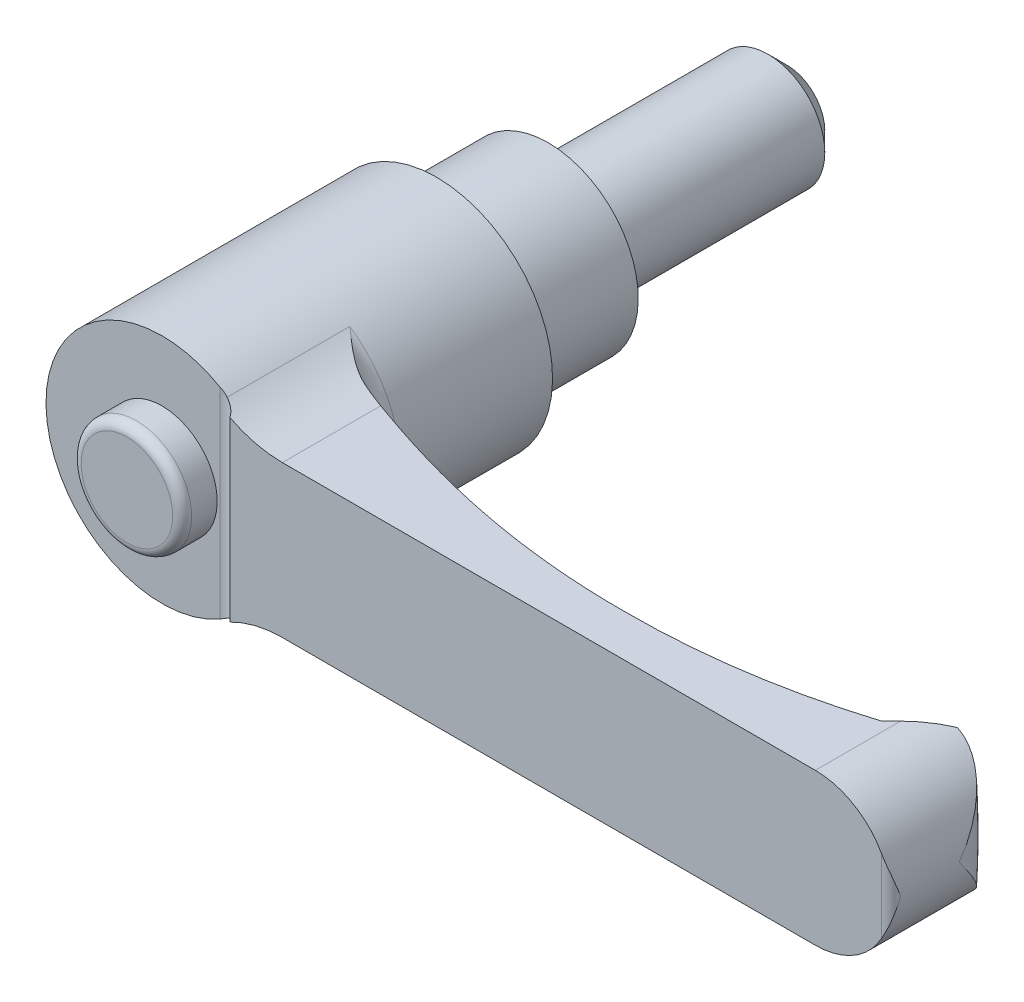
ISO-10303-21;
HEADER;
FILE_DESCRIPTION(('STEP AP214'),'2;1');
FILE_NAME('part.step','',(''),(''),'','','');
FILE_SCHEMA(('AUTOMOTIVE_DESIGN { 1 0 10303 214 1 1 1 1 }'));
ENDSEC;
DATA;
#1=APPLICATION_CONTEXT('core data for automotive mechanical design processes');
#2=APPLICATION_PROTOCOL_DEFINITION('international standard','automotive_design',2000,#1);
#3=PRODUCT_CONTEXT('',#1,'mechanical');
#4=PRODUCT('Part','Part','',(#3));
#5=PRODUCT_RELATED_PRODUCT_CATEGORY('part','',(#4));
#6=PRODUCT_DEFINITION_FORMATION('','',#4);
#7=PRODUCT_DEFINITION_CONTEXT('part definition',#1,'design');
#8=PRODUCT_DEFINITION('design','',#6,#7);
#9=PRODUCT_DEFINITION_SHAPE('','',#8);
#10=(LENGTH_UNIT() NAMED_UNIT(*) SI_UNIT(.MILLI.,.METRE.));
#11=(NAMED_UNIT(*) PLANE_ANGLE_UNIT() SI_UNIT($,.RADIAN.));
#12=(NAMED_UNIT(*) SI_UNIT($,.STERADIAN.) SOLID_ANGLE_UNIT());
#13=UNCERTAINTY_MEASURE_WITH_UNIT(LENGTH_MEASURE(1.E-05),#10,'distance_accuracy_value','');
#14=(GEOMETRIC_REPRESENTATION_CONTEXT(3) GLOBAL_UNCERTAINTY_ASSIGNED_CONTEXT((#13)) GLOBAL_UNIT_ASSIGNED_CONTEXT((#10,
#11,#12)) REPRESENTATION_CONTEXT('',''));
#15=CARTESIAN_POINT('',(0.,0.,0.));
#16=DIRECTION('',(0.,0.,1.));
#17=DIRECTION('',(1.,0.,0.));
#18=AXIS2_PLACEMENT_3D('',#15,#16,#17);
#19=CARTESIAN_POINT('',(7.6,0.,0.));
#20=DIRECTION('',(0.,0.,1.));
#21=DIRECTION('',(0.,-1.,0.));
#22=AXIS2_PLACEMENT_3D('',#19,#20,#21);
#23=PLANE('',#22);
#24=CARTESIAN_POINT('',(0.,0.,0.));
#25=DIRECTION('',(0.,0.,-1.));
#26=DIRECTION('',(0.,1.,0.));
#27=AXIS2_PLACEMENT_3D('',#24,#25,#26);
#28=CIRCLE('',#27,6.);
#29=CARTESIAN_POINT('',(0.,6.,0.));
#30=VERTEX_POINT('',#29);
#31=EDGE_CURVE('E422',#30,#30,#28,.T.);
#32=ORIENTED_EDGE('',*,*,#31,.F.);
#33=EDGE_LOOP('',(#32));
#34=FACE_BOUND('',#33,.T.);
#35=CARTESIAN_POINT('',(0.,0.,0.));
#36=DIRECTION('',(0.,0.,-1.));
#37=DIRECTION('',(0.,1.,0.));
#38=AXIS2_PLACEMENT_3D('',#35,#36,#37);
#39=CIRCLE('',#38,7.6);
#40=CARTESIAN_POINT('',(0.,7.6,0.));
#41=VERTEX_POINT('',#40);
#42=EDGE_CURVE('E347',#41,#41,#39,.T.);
#43=ORIENTED_EDGE('',*,*,#42,.T.);
#44=EDGE_LOOP('',(#43));
#45=FACE_BOUND('',#44,.T.);
#46=ADVANCED_FACE('F14',(#34,#45),#23,.F.);
#47=CARTESIAN_POINT('',(0.,0.,41.));
#48=DIRECTION('',(0.,0.,-1.));
#49=DIRECTION('',(0.,1.,0.));
#50=AXIS2_PLACEMENT_3D('',#47,#48,#49);
#51=PLANE('',#50);
#52=DIRECTION('',(0.,1.,0.));
#53=VECTOR('',#52,1.);
#54=CARTESIAN_POINT('',(6.125,-16.,41.));
#55=LINE('',#54,#53);
#56=CARTESIAN_POINT('',(6.125,-10.6088111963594,41.));
#57=VERTEX_POINT('',#56);
#58=CARTESIAN_POINT('',(6.125,10.6088111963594,41.));
#59=VERTEX_POINT('',#58);
#60=EDGE_CURVE('E385',#57,#59,#55,.T.);
#61=ORIENTED_EDGE('',*,*,#60,.T.);
#62=CARTESIAN_POINT('',(0.,0.,41.));
#63=DIRECTION('',(0.,0.,-1.));
#64=DIRECTION('',(0.,1.,0.));
#65=AXIS2_PLACEMENT_3D('',#62,#63,#64);
#66=CIRCLE('',#65,12.25);
#67=EDGE_CURVE('E332',#57,#59,#66,.T.);
#68=ORIENTED_EDGE('',*,*,#67,.F.);
#69=EDGE_LOOP('',(#61,#68));
#70=FACE_BOUND('',#69,.T.);
#71=CARTESIAN_POINT('',(0.,0.,41.));
#72=DIRECTION('',(0.,0.,-1.));
#73=DIRECTION('',(0.,1.,0.));
#74=AXIS2_PLACEMENT_3D('',#71,#72,#73);
#75=CIRCLE('',#74,5.83333333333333);
#76=CARTESIAN_POINT('',(0.,5.83333333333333,41.));
#77=VERTEX_POINT('',#76);
#78=EDGE_CURVE('E193',#77,#77,#75,.F.);
#79=ORIENTED_EDGE('',*,*,#78,.F.);
#80=EDGE_LOOP('',(#79));
#81=FACE_BOUND('',#80,.T.);
#82=ADVANCED_FACE('F163',(#70,#81),#51,.F.);
#83=CARTESIAN_POINT('',(70.,0.,0.));
#84=DIRECTION('',(0.,0.,1.));
#85=DIRECTION('',(0.,-1.,0.));
#86=AXIS2_PLACEMENT_3D('',#83,#84,#85);
#87=CYLINDRICAL_SURFACE('',#86,8.);
#88=CARTESIAN_POINT('',(78.,0.,34.8));
#89=CARTESIAN_POINT('',(78.0000000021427,-0.00507455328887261,34.7962762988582));
#90=CARTESIAN_POINT('',(77.9999951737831,-0.0101492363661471,34.7925524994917));
#91=CARTESIAN_POINT('',(77.9989416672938,-0.563628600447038,34.3864095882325));
#92=CARTESIAN_POINT('',(77.9414802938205,-1.11346566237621,33.9829298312));
#93=CARTESIAN_POINT('',(77.7692220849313,-1.92787753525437,33.38939297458));
#94=CARTESIAN_POINT('',(77.697249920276,-2.19810314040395,33.1931504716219));
#95=CARTESIAN_POINT('',(77.5237934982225,-2.73341157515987,32.8066637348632));
#96=CARTESIAN_POINT('',(77.4223242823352,-2.99849695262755,32.6164164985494));
#97=CARTESIAN_POINT('',(77.2199237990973,-3.45210642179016,32.2938177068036));
#98=CARTESIAN_POINT('',(77.1259458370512,-3.64233939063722,32.1594598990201));
#99=CARTESIAN_POINT('',(76.9211711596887,-4.01785016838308,31.8966888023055));
#100=CARTESIAN_POINT('',(76.8103745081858,-4.20312799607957,31.7682754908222));
#101=CARTESIAN_POINT('',(76.5717542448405,-4.56719869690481,31.5191542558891));
#102=CARTESIAN_POINT('',(76.4439640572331,-4.74600344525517,31.3984318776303));
#103=CARTESIAN_POINT('',(76.1708976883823,-5.09601175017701,31.1663364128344));
#104=CARTESIAN_POINT('',(76.0256268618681,-5.26721761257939,31.0549604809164));
#105=CARTESIAN_POINT('',(75.6441829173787,-5.67932922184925,30.7937387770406));
#106=CARTESIAN_POINT('',(75.3974573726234,-5.9150123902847,30.6505327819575));
#107=CARTESIAN_POINT('',(74.9987611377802,-6.24839682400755,30.4615945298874));
#108=CARTESIAN_POINT('',(74.8611020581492,-6.35616332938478,30.4029292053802));
#109=CARTESIAN_POINT('',(74.5764070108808,-6.56410843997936,30.2956150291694));
#110=CARTESIAN_POINT('',(74.429373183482,-6.66428876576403,30.2469639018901));
#111=CARTESIAN_POINT('',(74.1592544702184,-6.83522850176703,30.1705684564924));
#112=CARTESIAN_POINT('',(74.0378615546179,-6.90766708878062,30.1405781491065));
#113=CARTESIAN_POINT('',(73.7901015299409,-7.04665102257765,30.0886005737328));
#114=CARTESIAN_POINT('',(73.6637356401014,-7.11319780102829,30.0666113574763));
#115=CARTESIAN_POINT('',(73.4066843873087,-7.23982141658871,30.0315221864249));
#116=CARTESIAN_POINT('',(73.2760017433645,-7.2999022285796,30.0184167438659));
#117=CARTESIAN_POINT('',(73.0110423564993,-7.41312181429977,30.0019547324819));
#118=CARTESIAN_POINT('',(72.8767656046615,-7.46626057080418,29.9985981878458));
#119=CARTESIAN_POINT('',(72.6044130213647,-7.56559501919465,30.0024862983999));
#120=CARTESIAN_POINT('',(72.4663137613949,-7.6117232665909,30.009827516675));
#121=CARTESIAN_POINT('',(72.1887878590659,-7.69611880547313,30.0360283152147));
#122=CARTESIAN_POINT('',(72.0493611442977,-7.73438566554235,30.0548885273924));
#123=CARTESIAN_POINT('',(71.770740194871,-7.80288648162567,30.1046814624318));
#124=CARTESIAN_POINT('',(71.6315458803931,-7.83312431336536,30.1356083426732));
#125=CARTESIAN_POINT('',(71.3550409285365,-7.885663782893,30.2098119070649));
#126=CARTESIAN_POINT('',(71.217729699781,-7.90796796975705,30.2530846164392));
#127=CARTESIAN_POINT('',(70.8920238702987,-7.95241951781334,30.3719934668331));
#128=CARTESIAN_POINT('',(70.7052564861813,-7.97090772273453,30.4536477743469));
#129=CARTESIAN_POINT('',(70.433708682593,-7.98875485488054,30.5937624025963));
#130=CARTESIAN_POINT('',(70.3445710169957,-7.99305594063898,30.6434445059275));
#131=CARTESIAN_POINT('',(70.1696001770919,-7.99868029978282,30.7485120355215));
#132=CARTESIAN_POINT('',(70.0837676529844,-8.00000299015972,30.8038985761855));
#133=CARTESIAN_POINT('',(69.9998,-7.9999999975,30.8620428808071));
#134=B_SPLINE_CURVE_WITH_KNOTS('',3,(#88,#89,#90,#91,#92,#93,#94,#95,#96,#97,#98,#99,#100,#101,
#102,#103,#104,#105,#106,#107,#108,#109,#110,#111,#112,#113,#114,#115,#116,#117,#118,#119,#120,
#121,#122,#123,#124,#125,#126,#127,#128,#129,#130,#131,#132,#133),.UNSPECIFIED.,.F.,.F.,(4,2,2,
2,2,2,2,2,2,2,2,2,2,2,2,2,2,2,2,2,2,2,4),(0.,0.0188831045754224,2.05946970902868,
3.08347088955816,4.10695081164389,4.85978230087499,5.6126109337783,6.36398015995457,
7.11511980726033,8.22062566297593,8.77332293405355,9.32589447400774,9.75904172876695,
10.1920834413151,10.624857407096,11.0576324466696,11.4943381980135,11.9310679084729,
12.3675864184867,12.8039645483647,13.4155655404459,13.721767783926,14.0280299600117),.UNSPECIFIED.);
#135=CARTESIAN_POINT('',(72.9968893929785,-7.41745603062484,30.0031106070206));
#136=VERTEX_POINT('',#135);
#137=CARTESIAN_POINT('',(78.,0.,34.8));
#138=VERTEX_POINT('',#137);
#139=EDGE_CURVE('E126',#136,#138,#134,.F.);
#140=ORIENTED_EDGE('',*,*,#139,.T.);
#141=CARTESIAN_POINT('',(78.,0.,34.8));
#142=CARTESIAN_POINT('',(78.0000000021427,0.00507455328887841,34.7962762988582));
#143=CARTESIAN_POINT('',(77.9999951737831,0.0101492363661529,34.7925524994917));
#144=CARTESIAN_POINT('',(77.9989416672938,0.563628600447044,34.3864095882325));
#145=CARTESIAN_POINT('',(77.9414802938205,1.11346566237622,33.9829298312));
#146=CARTESIAN_POINT('',(77.7692220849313,1.92787753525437,33.38939297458));
#147=CARTESIAN_POINT('',(77.697249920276,2.19810314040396,33.1931504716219));
#148=CARTESIAN_POINT('',(77.5237934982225,2.73341157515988,32.8066637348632));
#149=CARTESIAN_POINT('',(77.4223242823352,2.99849695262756,32.6164164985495));
#150=CARTESIAN_POINT('',(77.2199237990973,3.45210642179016,32.2938177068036));
#151=CARTESIAN_POINT('',(77.1259458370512,3.64233939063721,32.1594598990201));
#152=CARTESIAN_POINT('',(76.9211711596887,4.01785016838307,31.8966888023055));
#153=CARTESIAN_POINT('',(76.8103745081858,4.20312799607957,31.7682754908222));
#154=CARTESIAN_POINT('',(76.5717542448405,4.56719869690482,31.5191542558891));
#155=CARTESIAN_POINT('',(76.4439640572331,4.74600344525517,31.3984318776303));
#156=CARTESIAN_POINT('',(76.1708976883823,5.09601175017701,31.1663364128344));
#157=CARTESIAN_POINT('',(76.0256268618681,5.26721761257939,31.0549604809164));
#158=CARTESIAN_POINT('',(75.6441829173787,5.67932922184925,30.7937387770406));
#159=CARTESIAN_POINT('',(75.3974573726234,5.91501239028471,30.6505327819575));
#160=CARTESIAN_POINT('',(74.9987611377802,6.24839682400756,30.4615945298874));
#161=CARTESIAN_POINT('',(74.8611020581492,6.35616332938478,30.4029292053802));
#162=CARTESIAN_POINT('',(74.5764070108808,6.56410843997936,30.2956150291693));
#163=CARTESIAN_POINT('',(74.429373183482,6.66428876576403,30.2469639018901));
#164=CARTESIAN_POINT('',(74.1592544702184,6.83522850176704,30.1705684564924));
#165=CARTESIAN_POINT('',(74.0378615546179,6.90766708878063,30.1405781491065));
#166=CARTESIAN_POINT('',(73.7901015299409,7.04665102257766,30.0886005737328));
#167=CARTESIAN_POINT('',(73.6637356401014,7.11319780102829,30.0666113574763));
#168=CARTESIAN_POINT('',(73.4066843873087,7.23982141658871,30.0315221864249));
#169=CARTESIAN_POINT('',(73.2760017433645,7.2999022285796,30.0184167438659));
#170=CARTESIAN_POINT('',(73.0110423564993,7.41312181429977,30.0019547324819));
#171=CARTESIAN_POINT('',(72.8767656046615,7.46626057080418,29.9985981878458));
#172=CARTESIAN_POINT('',(72.6044130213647,7.56559501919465,30.0024862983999));
#173=CARTESIAN_POINT('',(72.4663137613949,7.61172326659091,30.009827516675));
#174=CARTESIAN_POINT('',(72.1887878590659,7.69611880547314,30.0360283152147));
#175=CARTESIAN_POINT('',(72.0493611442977,7.73438566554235,30.0548885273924));
#176=CARTESIAN_POINT('',(71.770740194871,7.80288648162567,30.1046814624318));
#177=CARTESIAN_POINT('',(71.6315458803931,7.83312431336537,30.1356083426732));
#178=CARTESIAN_POINT('',(71.3550409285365,7.885663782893,30.2098119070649));
#179=CARTESIAN_POINT('',(71.217729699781,7.90796796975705,30.2530846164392));
#180=CARTESIAN_POINT('',(70.8920238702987,7.95241951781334,30.3719934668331));
#181=CARTESIAN_POINT('',(70.7052564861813,7.97090772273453,30.4536477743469));
#182=CARTESIAN_POINT('',(70.433708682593,7.98875485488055,30.5937624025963));
#183=CARTESIAN_POINT('',(70.3445710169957,7.99305594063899,30.6434445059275));
#184=CARTESIAN_POINT('',(70.1696001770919,7.99868029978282,30.7485120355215));
#185=CARTESIAN_POINT('',(70.0837676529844,8.00000299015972,30.8038985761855));
#186=CARTESIAN_POINT('',(69.9998,7.9999999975,30.8620428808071));
#187=B_SPLINE_CURVE_WITH_KNOTS('',3,(#141,#142,#143,#144,#145,#146,#147,#148,#149,#150,#151,
#152,#153,#154,#155,#156,#157,#158,#159,#160,#161,#162,#163,#164,#165,#166,#167,#168,#169,#170,
#171,#172,#173,#174,#175,#176,#177,#178,#179,#180,#181,#182,#183,#184,#185,#186),.UNSPECIFIED.,
.F.,.F.,(4,2,2,2,2,2,2,2,2,2,2,2,2,2,2,2,2,2,2,2,2,2,4),(0.,0.0188831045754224,2.05946970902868,
3.08347088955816,4.10695081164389,4.85978230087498,5.61261093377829,6.36398015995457,
7.11511980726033,8.22062566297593,8.77332293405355,9.32589447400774,9.75904172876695,
10.1920834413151,10.6248574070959,11.0576324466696,11.4943381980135,11.9310679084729,
12.3675864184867,12.8039645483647,13.4155655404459,13.721767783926,14.0280299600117),.UNSPECIFIED.);
#188=CARTESIAN_POINT('',(72.9968893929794,7.41745603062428,30.0031106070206));
#189=VERTEX_POINT('',#188);
#190=EDGE_CURVE('E123',#138,#189,#187,.T.);
#191=ORIENTED_EDGE('',*,*,#190,.T.);
#192=CARTESIAN_POINT('',(70.,0.,33.));
#193=DIRECTION('',(-0.707106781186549,0.,-0.707106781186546));
#194=DIRECTION('',(-0.707106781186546,0.,0.707106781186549));
#195=AXIS2_PLACEMENT_3D('',#192,#193,#194);
#196=ELLIPSE('',#195,11.3137084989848,8.);
#197=CARTESIAN_POINT('',(70.,8.,33.));
#198=VERTEX_POINT('',#197);
#199=EDGE_CURVE('E378',#189,#198,#196,.F.);
#200=ORIENTED_EDGE('',*,*,#199,.T.);
#201=DIRECTION('',(0.,0.,1.));
#202=VECTOR('',#201,1.);
#203=CARTESIAN_POINT('',(70.,8.,0.));
#204=LINE('',#203,#202);
#205=CARTESIAN_POINT('',(70.,8.,42.));
#206=VERTEX_POINT('',#205);
#207=EDGE_CURVE('E354',#198,#206,#204,.T.);
#208=ORIENTED_EDGE('',*,*,#207,.T.);
#209=CARTESIAN_POINT('',(70.,0.,42.));
#210=DIRECTION('',(0.,0.,1.));
#211=DIRECTION('',(0.,-1.,0.));
#212=AXIS2_PLACEMENT_3D('',#209,#210,#211);
#213=CIRCLE('',#212,8.);
#214=CARTESIAN_POINT('',(77.,3.87298334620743,42.));
#215=VERTEX_POINT('',#214);
#216=EDGE_CURVE('E327',#215,#206,#213,.T.);
#217=ORIENTED_EDGE('',*,*,#216,.F.);
#218=CARTESIAN_POINT('',(77.,3.87298334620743,42.));
#219=CARTESIAN_POINT('',(77.0320487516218,3.8150611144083,41.9999909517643));
#220=CARTESIAN_POINT('',(77.0633658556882,3.75675902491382,41.9984605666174));
#221=CARTESIAN_POINT('',(77.1244803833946,3.63952511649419,41.99269833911));
#222=CARTESIAN_POINT('',(77.1542784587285,3.58059358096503,41.9884676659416));
#223=CARTESIAN_POINT('',(77.241218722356,3.40324230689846,41.9722589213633));
#224=CARTESIAN_POINT('',(77.2960525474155,3.28400247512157,41.9567609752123));
#225=CARTESIAN_POINT('',(77.3991566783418,3.04456972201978,41.9185214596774));
#226=CARTESIAN_POINT('',(77.4474555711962,2.9243835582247,41.8958129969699));
#227=CARTESIAN_POINT('',(77.5378429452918,2.68282861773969,41.8446429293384));
#228=CARTESIAN_POINT('',(77.5799268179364,2.56145903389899,41.8161770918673));
#229=CARTESIAN_POINT('',(77.6827368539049,2.24038507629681,41.7351721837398));
#230=CARTESIAN_POINT('',(77.7382927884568,2.03996193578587,41.6788382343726));
#231=CARTESIAN_POINT('',(77.8332865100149,1.63779800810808,41.55814944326));
#232=CARTESIAN_POINT('',(77.8727175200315,1.43605670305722,41.4937912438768));
#233=CARTESIAN_POINT('',(77.967421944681,0.829293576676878,41.2932012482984));
#234=CARTESIAN_POINT('',(77.999127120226,0.42266785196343,41.1494356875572));
#235=CARTESIAN_POINT('',(77.9999940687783,0.0112434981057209,41.0039751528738));
#236=CARTESIAN_POINT('',(77.9999999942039,0.00562166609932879,41.0019875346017));
#237=CARTESIAN_POINT('',(78.,0.,41.));
#238=B_SPLINE_CURVE_WITH_KNOTS('',3,(#218,#219,#220,#221,#222,#223,#224,#225,#226,#227,#228,
#229,#230,#231,#232,#233,#234,#235,#236,#237),.UNSPECIFIED.,.F.,.F.,(4,2,2,2,2,2,2,2,2,4),(0.,
0.198535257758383,0.396984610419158,0.792983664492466,1.18719018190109,1.5816875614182,
2.22713013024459,2.8728436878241,4.16406208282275,4.18195063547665),.UNSPECIFIED.);
#239=CARTESIAN_POINT('',(78.,0.,41.));
#240=VERTEX_POINT('',#239);
#241=EDGE_CURVE('E179',#240,#215,#238,.F.);
#242=ORIENTED_EDGE('',*,*,#241,.F.);
#243=CARTESIAN_POINT('',(77.,-3.87298334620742,42.));
#244=CARTESIAN_POINT('',(77.0320487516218,-3.81506111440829,41.9999909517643));
#245=CARTESIAN_POINT('',(77.0633658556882,-3.75675902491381,41.9984605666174));
#246=CARTESIAN_POINT('',(77.1244803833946,-3.63952511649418,41.99269833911));
#247=CARTESIAN_POINT('',(77.1542784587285,-3.58059358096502,41.9884676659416));
#248=CARTESIAN_POINT('',(77.241218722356,-3.40324230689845,41.9722589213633));
#249=CARTESIAN_POINT('',(77.2960525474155,-3.28400247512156,41.9567609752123));
#250=CARTESIAN_POINT('',(77.3991566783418,-3.04456972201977,41.9185214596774));
#251=CARTESIAN_POINT('',(77.4474555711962,-2.92438355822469,41.8958129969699));
#252=CARTESIAN_POINT('',(77.5378429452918,-2.68282861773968,41.8446429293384));
#253=CARTESIAN_POINT('',(77.5799268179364,-2.56145903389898,41.8161770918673));
#254=CARTESIAN_POINT('',(77.6827368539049,-2.2403850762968,41.7351721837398));
#255=CARTESIAN_POINT('',(77.7382927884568,-2.03996193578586,41.6788382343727));
#256=CARTESIAN_POINT('',(77.8332865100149,-1.63779800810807,41.55814944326));
#257=CARTESIAN_POINT('',(77.8727175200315,-1.43605670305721,41.4937912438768));
#258=CARTESIAN_POINT('',(77.967421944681,-0.829293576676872,41.2932012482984));
#259=CARTESIAN_POINT('',(77.999127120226,-0.422667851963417,41.1494356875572));
#260=CARTESIAN_POINT('',(77.9999940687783,-0.0112434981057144,41.0039751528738));
#261=CARTESIAN_POINT('',(77.9999999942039,-0.00562166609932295,41.0019875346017));
#262=CARTESIAN_POINT('',(78.,0.,41.));
#263=B_SPLINE_CURVE_WITH_KNOTS('',3,(#243,#244,#245,#246,#247,#248,#249,#250,#251,#252,#253,
#254,#255,#256,#257,#258,#259,#260,#261,#262),.UNSPECIFIED.,.F.,.F.,(4,2,2,2,2,2,2,2,2,4),(0.,
0.19853525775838,0.396984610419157,0.792983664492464,1.18719018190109,1.5816875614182,
2.2271301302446,2.8728436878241,4.16406208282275,4.18195063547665),.UNSPECIFIED.);
#264=CARTESIAN_POINT('',(77.,-3.87298334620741,42.));
#265=VERTEX_POINT('',#264);
#266=EDGE_CURVE('E187',#265,#240,#263,.T.);
#267=ORIENTED_EDGE('',*,*,#266,.F.);
#268=CARTESIAN_POINT('',(70.,-8.,42.));
#269=VERTEX_POINT('',#268);
#270=EDGE_CURVE('E322',#269,#265,#213,.T.);
#271=ORIENTED_EDGE('',*,*,#270,.F.);
#272=DIRECTION('',(0.,0.,1.));
#273=VECTOR('',#272,1.);
#274=CARTESIAN_POINT('',(70.,-8.,0.));
#275=LINE('',#274,#273);
#276=CARTESIAN_POINT('',(70.,-8.,33.));
#277=VERTEX_POINT('',#276);
#278=EDGE_CURVE('E357',#277,#269,#275,.T.);
#279=ORIENTED_EDGE('',*,*,#278,.F.);
#280=EDGE_CURVE('E137',#277,#136,#196,.F.);
#281=ORIENTED_EDGE('',*,*,#280,.T.);
#282=EDGE_LOOP('',(#140,#191,#200,#208,#217,#242,#267,#271,#279,#281));
#283=FACE_BOUND('',#282,.T.);
#284=ADVANCED_FACE('F135',(#283),#87,.T.);
#285=CARTESIAN_POINT('',(73.,-16.,30.));
#286=DIRECTION('',(-0.707106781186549,0.,-0.707106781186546));
#287=DIRECTION('',(0.707106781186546,0.,-0.707106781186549));
#288=AXIS2_PLACEMENT_3D('',#285,#286,#287);
#289=PLANE('',#288);
#290=DIRECTION('',(0.,1.,0.));
#291=VECTOR('',#290,1.);
#292=CARTESIAN_POINT('',(73.,-16.,30.));
#293=LINE('',#292,#291);
#294=CARTESIAN_POINT('',(73.,-5.40740233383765,30.));
#295=VERTEX_POINT('',#294);
#296=CARTESIAN_POINT('',(73.,5.40740233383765,30.));
#297=VERTEX_POINT('',#296);
#298=EDGE_CURVE('E397',#295,#297,#293,.T.);
#299=ORIENTED_EDGE('',*,*,#298,.F.);
#300=CARTESIAN_POINT('',(72.9944134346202,8.0002,30.0055865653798));
#301=CARTESIAN_POINT('',(72.9964174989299,7.60019527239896,30.0035825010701));
#302=CARTESIAN_POINT('',(72.9977626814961,7.20018596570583,30.0022373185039));
#303=CARTESIAN_POINT('',(72.9994970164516,6.40016550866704,30.0005029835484));
#304=CARTESIAN_POINT('',(72.9998861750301,6.00015435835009,30.0001138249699));
#305=CARTESIAN_POINT('',(73.0000702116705,5.20013335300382,29.9999297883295));
#306=CARTESIAN_POINT('',(72.9998650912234,4.80012349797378,30.0001349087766));
#307=CARTESIAN_POINT('',(72.9991717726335,4.00010369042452,30.0008282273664));
#308=CARTESIAN_POINT('',(72.998683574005,3.60009373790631,30.001316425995));
#309=CARTESIAN_POINT('',(72.9972116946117,2.40006658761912,30.0027883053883));
#310=CARTESIAN_POINT('',(72.9962207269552,1.60004928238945,30.0037792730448));
#311=CARTESIAN_POINT('',(72.9954610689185,1.3601944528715E-05,30.0045389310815));
#312=CARTESIAN_POINT('',(72.9956923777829,-0.800004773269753,30.004307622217));
#313=CARTESIAN_POINT('',(72.9968584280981,-2.13336982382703,30.0031415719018));
#314=CARTESIAN_POINT('',(72.9975329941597,-2.66671710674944,30.0024670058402));
#315=CARTESIAN_POINT('',(72.9988528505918,-3.73341119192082,30.0011471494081));
#316=CARTESIAN_POINT('',(72.999498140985,-4.26675799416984,30.000501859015));
#317=CARTESIAN_POINT('',(73.000124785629,-5.33345534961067,29.999875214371));
#318=CARTESIAN_POINT('',(73.0001061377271,-5.86680590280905,29.9998938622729));
#319=CARTESIAN_POINT('',(72.9985813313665,-6.93350631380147,30.0014186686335));
#320=CARTESIAN_POINT('',(72.997075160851,-7.46685617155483,30.002924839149));
#321=CARTESIAN_POINT('',(72.9944134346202,-8.0002,30.0055865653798));
#322=B_SPLINE_CURVE_WITH_KNOTS('',3,(#300,#301,#302,#303,#304,#305,#306,#307,#308,#309,#310,
#311,#312,#313,#314,#315,#316,#317,#318,#319,#320,#321),.UNSPECIFIED.,.F.,.F.,(4,2,2,2,2,2,2,2,
2,2,4),(0.,1.20004037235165,2.40007297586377,3.60010256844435,4.80013422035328,7.20018907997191,
9.60024245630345,11.2002867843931,12.8003298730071,14.4003781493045,16.0004393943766),.UNSPECIFIED.);
#323=EDGE_CURVE('E138',#295,#136,#322,.T.);
#324=ORIENTED_EDGE('',*,*,#323,.T.);
#325=ORIENTED_EDGE('',*,*,#280,.F.);
#326=DIRECTION('',(-0.707106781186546,0.,0.707106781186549));
#327=VECTOR('',#326,1.);
#328=CARTESIAN_POINT('',(86.5,-8.,16.5));
#329=LINE('',#328,#327);
#330=CARTESIAN_POINT('',(69.,-8.,34.));
#331=VERTEX_POINT('',#330);
#332=EDGE_CURVE('E321',#277,#331,#329,.T.);
#333=ORIENTED_EDGE('',*,*,#332,.T.);
#334=DIRECTION('',(0.,1.,0.));
#335=VECTOR('',#334,1.);
#336=CARTESIAN_POINT('',(69.,-16.,34.));
#337=LINE('',#336,#335);
#338=CARTESIAN_POINT('',(69.,8.,34.));
#339=VERTEX_POINT('',#338);
#340=EDGE_CURVE('E319',#331,#339,#337,.T.);
#341=ORIENTED_EDGE('',*,*,#340,.T.);
#342=DIRECTION('',(0.707106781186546,0.,-0.707106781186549));
#343=VECTOR('',#342,1.);
#344=CARTESIAN_POINT('',(58.3567940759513,8.,44.6432059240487));
#345=LINE('',#344,#343);
#346=EDGE_CURVE('E375',#339,#198,#345,.T.);
#347=ORIENTED_EDGE('',*,*,#346,.T.);
#348=ORIENTED_EDGE('',*,*,#199,.F.);
#349=EDGE_CURVE('E129',#189,#297,#322,.T.);
#350=ORIENTED_EDGE('',*,*,#349,.T.);
#351=EDGE_LOOP('',(#299,#324,#325,#333,#341,#347,#348,#350));
#352=FACE_BOUND('',#351,.T.);
#353=ADVANCED_FACE('F162',(#352),#289,.T.);
#354=CARTESIAN_POINT('',(73.2,-16.,30.));
#355=DIRECTION('',(0.,0.,-1.));
#356=DIRECTION('',(0.,1.,0.));
#357=AXIS2_PLACEMENT_3D('',#354,#355,#356);
#358=PLANE('',#357);
#359=ORIENTED_EDGE('',*,*,#298,.T.);
#360=CARTESIAN_POINT('',(0.,0.,30.));
#361=DIRECTION('',(0.,0.,-1.));
#362=DIRECTION('',(0.,1.,0.));
#363=AXIS2_PLACEMENT_3D('',#360,#361,#362);
#364=CIRCLE('',#363,73.2);
#365=EDGE_CURVE('E36',#297,#295,#364,.T.);
#366=ORIENTED_EDGE('',*,*,#365,.T.);
#367=EDGE_LOOP('',(#359,#366));
#368=FACE_BOUND('',#367,.T.);
#369=ADVANCED_FACE('F201',(#368),#358,.T.);
#370=CARTESIAN_POINT('',(0.,0.,42.));
#371=DIRECTION('',(0.,0.,1.));
#372=DIRECTION('',(0.,-1.,0.));
#373=AXIS2_PLACEMENT_3D('',#370,#371,#372);
#374=PLANE('',#373);
#375=CARTESIAN_POINT('',(13.7135881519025,20.,42.));
#376=DIRECTION('',(0.,0.,1.));
#377=DIRECTION('',(1.,0.,0.));
#378=AXIS2_PLACEMENT_3D('',#375,#376,#377);
#379=CIRCLE('',#378,12.);
#380=CARTESIAN_POINT('',(8.16666666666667,9.35896330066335,42.));
#381=VERTEX_POINT('',#380);
#382=CARTESIAN_POINT('',(13.7135881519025,8.,42.));
#383=VERTEX_POINT('',#382);
#384=EDGE_CURVE('E372',#381,#383,#379,.T.);
#385=ORIENTED_EDGE('',*,*,#384,.F.);
#386=DIRECTION('',(0.,1.,0.));
#387=VECTOR('',#386,1.);
#388=CARTESIAN_POINT('',(8.16666666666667,-16.,42.));
#389=LINE('',#388,#387);
#390=CARTESIAN_POINT('',(8.16666666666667,-9.35896330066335,42.));
#391=VERTEX_POINT('',#390);
#392=EDGE_CURVE('E392',#391,#381,#389,.T.);
#393=ORIENTED_EDGE('',*,*,#392,.F.);
#394=CARTESIAN_POINT('',(13.7135881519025,-20.,42.));
#395=DIRECTION('',(0.,0.,1.));
#396=DIRECTION('',(1.,0.,0.));
#397=AXIS2_PLACEMENT_3D('',#394,#395,#396);
#398=CIRCLE('',#397,12.);
#399=CARTESIAN_POINT('',(13.7135881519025,-8.,42.));
#400=VERTEX_POINT('',#399);
#401=EDGE_CURVE('E363',#400,#391,#398,.T.);
#402=ORIENTED_EDGE('',*,*,#401,.F.);
#403=DIRECTION('',(-1.,0.,0.));
#404=VECTOR('',#403,1.);
#405=CARTESIAN_POINT('',(70.,-8.,42.));
#406=LINE('',#405,#404);
#407=EDGE_CURVE('E366',#269,#400,#406,.T.);
#408=ORIENTED_EDGE('',*,*,#407,.F.);
#409=ORIENTED_EDGE('',*,*,#270,.T.);
#410=DIRECTION('',(0.,1.,0.));
#411=VECTOR('',#410,1.);
#412=CARTESIAN_POINT('',(77.,-16.,42.));
#413=LINE('',#412,#411);
#414=EDGE_CURVE('E393',#265,#215,#413,.T.);
#415=ORIENTED_EDGE('',*,*,#414,.T.);
#416=ORIENTED_EDGE('',*,*,#216,.T.);
#417=DIRECTION('',(1.,0.,0.));
#418=VECTOR('',#417,1.);
#419=CARTESIAN_POINT('',(13.7135881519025,8.,42.));
#420=LINE('',#419,#418);
#421=EDGE_CURVE('E369',#383,#206,#420,.T.);
#422=ORIENTED_EDGE('',*,*,#421,.F.);
#423=EDGE_LOOP('',(#385,#393,#402,#408,#409,#415,#416,#422));
#424=FACE_BOUND('',#423,.T.);
#425=ADVANCED_FACE('F248',(#424),#374,.T.);
#426=CARTESIAN_POINT('',(0.,0.,0.));
#427=DIRECTION('',(0.,0.,-1.));
#428=DIRECTION('',(0.,1.,0.));
#429=AXIS2_PLACEMENT_3D('',#426,#427,#428);
#430=CYLINDRICAL_SURFACE('',#429,12.25);
#431=CARTESIAN_POINT('',(0.,0.,28.0779919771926));
#432=DIRECTION('',(0.,0.,-1.));
#433=DIRECTION('',(0.,1.,0.));
#434=AXIS2_PLACEMENT_3D('',#431,#432,#433);
#435=CIRCLE('',#434,12.25);
#436=CARTESIAN_POINT('',(6.92748267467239,10.1030927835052,28.0779919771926));
#437=VERTEX_POINT('',#436);
#438=CARTESIAN_POINT('',(6.92748267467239,-10.1030927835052,28.0779919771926));
#439=VERTEX_POINT('',#438);
#440=EDGE_CURVE('E412',#437,#439,#435,.T.);
#441=ORIENTED_EDGE('',*,*,#440,.T.);
#442=DIRECTION('',(0.,0.,1.));
#443=VECTOR('',#442,1.);
#444=CARTESIAN_POINT('',(6.92748267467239,-10.1030927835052,0.));
#445=LINE('',#444,#443);
#446=CARTESIAN_POINT('',(6.92748267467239,-10.1030927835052,41.0427567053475));
#447=VERTEX_POINT('',#446);
#448=EDGE_CURVE('E361',#439,#447,#445,.T.);
#449=ORIENTED_EDGE('',*,*,#448,.T.);
#450=CARTESIAN_POINT('',(6.125,-10.6088111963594,41.));
#451=CARTESIAN_POINT('',(6.19832883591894,-10.5664875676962,40.9889897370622));
#452=CARTESIAN_POINT('',(6.27164451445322,-10.523132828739,40.9821479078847));
#453=CARTESIAN_POINT('',(6.41753908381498,-10.4347921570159,40.9764986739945));
#454=CARTESIAN_POINT('',(6.49011843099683,-10.3898073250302,40.9776859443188));
#455=CARTESIAN_POINT('',(6.63402897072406,-10.2985167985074,40.9877856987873));
#456=CARTESIAN_POINT('',(6.70535828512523,-10.2522093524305,40.996708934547));
#457=CARTESIAN_POINT('',(6.84611057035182,-10.1587605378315,41.0220012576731));
#458=CARTESIAN_POINT('',(6.91553331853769,-10.1116190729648,41.0383712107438));
#459=CARTESIAN_POINT('',(7.10641045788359,-9.97916014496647,41.094233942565));
#460=CARTESIAN_POINT('',(7.22525798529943,-9.89334730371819,41.1417583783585));
#461=CARTESIAN_POINT('',(7.45241295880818,-9.72337963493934,41.2589427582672));
#462=CARTESIAN_POINT('',(7.56074253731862,-9.63922163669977,41.3285548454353));
#463=CARTESIAN_POINT('',(7.71168483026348,-9.51821587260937,41.4479066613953));
#464=CARTESIAN_POINT('',(7.75936397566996,-9.47936365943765,41.4893658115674));
#465=CARTESIAN_POINT('',(7.85125896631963,-9.40339173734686,41.5773725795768));
#466=CARTESIAN_POINT('',(7.89547657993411,-9.36627114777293,41.6239175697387));
#467=CARTESIAN_POINT('',(7.98020904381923,-9.29418452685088,41.7223463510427));
#468=CARTESIAN_POINT('',(8.02070494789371,-9.25922978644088,41.7742548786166));
#469=CARTESIAN_POINT('',(8.09722101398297,-9.19239515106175,41.8832605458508));
#470=CARTESIAN_POINT('',(8.13323329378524,-9.16052069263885,41.9403665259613));
#471=CARTESIAN_POINT('',(8.16666666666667,-9.13061090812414,42.));
#472=B_SPLINE_CURVE_WITH_KNOTS('',3,(#450,#451,#452,#453,#454,#455,#456,#457,#458,#459,#460,
#461,#462,#463,#464,#465,#466,#467,#468,#469,#470,#471),.UNSPECIFIED.,.F.,.F.,(4,2,2,2,2,2,2,2,
2,2,4),(0.,0.255975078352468,0.511780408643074,0.767941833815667,1.02413304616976,
1.48441304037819,1.94370248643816,2.16599787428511,2.38817894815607,2.61143478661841,
2.83507772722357),.UNSPECIFIED.);
#473=EDGE_CURVE('E222',#57,#447,#472,.T.);
#474=ORIENTED_EDGE('',*,*,#473,.F.);
#475=ORIENTED_EDGE('',*,*,#67,.T.);
#476=CARTESIAN_POINT('',(8.16666666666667,9.13061090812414,42.));
#477=CARTESIAN_POINT('',(8.13602850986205,9.15801692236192,41.9453523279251));
#478=CARTESIAN_POINT('',(8.10323346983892,9.18706943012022,41.8928397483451));
#479=CARTESIAN_POINT('',(8.03382107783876,9.24782874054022,41.7921703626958));
#480=CARTESIAN_POINT('',(7.99720910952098,9.27953179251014,41.7440075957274));
#481=CARTESIAN_POINT('',(7.88274220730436,9.37735907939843,41.6065497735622));
#482=CARTESIAN_POINT('',(7.79984772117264,9.44657197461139,41.5235775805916));
#483=CARTESIAN_POINT('',(7.62397737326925,9.58906879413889,41.3751924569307));
#484=CARTESIAN_POINT('',(7.53106018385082,9.66232791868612,41.3096843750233));
#485=CARTESIAN_POINT('',(7.33643153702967,9.81092784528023,41.1955319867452));
#486=CARTESIAN_POINT('',(7.23469620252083,9.88627389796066,41.1469353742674));
#487=CARTESIAN_POINT('',(7.00601089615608,10.0499435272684,41.0604339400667));
#488=CARTESIAN_POINT('',(6.87776073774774,10.1382349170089,41.0258797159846));
#489=CARTESIAN_POINT('',(6.61511692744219,10.3115145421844,40.9827504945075));
#490=CARTESIAN_POINT('',(6.48074133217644,10.3965112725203,40.9741035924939));
#491=CARTESIAN_POINT('',(6.30869788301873,10.5006996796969,40.9806991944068));
#492=CARTESIAN_POINT('',(6.27199131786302,10.5226640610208,40.9831161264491));
#493=CARTESIAN_POINT('',(6.19852568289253,10.5661055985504,40.9900077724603));
#494=CARTESIAN_POINT('',(6.16176668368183,10.5875831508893,40.9944807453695));
#495=CARTESIAN_POINT('',(6.125,10.6088111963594,41.));
#496=B_SPLINE_CURVE_WITH_KNOTS('',3,(#476,#477,#478,#479,#480,#481,#482,#483,#484,#485,#486,
#487,#488,#489,#490,#491,#492,#493,#494,#495),.UNSPECIFIED.,.F.,.F.,(4,2,2,2,2,2,2,2,2,4),(0.,
0.204930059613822,0.409574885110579,0.816210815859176,1.22058373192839,1.62608799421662,
2.10242753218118,2.57744378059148,2.7059409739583,2.83432955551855),.UNSPECIFIED.);
#497=CARTESIAN_POINT('',(6.92748267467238,10.1030927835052,41.0427567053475));
#498=VERTEX_POINT('',#497);
#499=EDGE_CURVE('E236',#498,#59,#496,.T.);
#500=ORIENTED_EDGE('',*,*,#499,.F.);
#501=DIRECTION('',(0.,0.,1.));
#502=VECTOR('',#501,1.);
#503=CARTESIAN_POINT('',(6.92748267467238,10.1030927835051,0.));
#504=LINE('',#503,#502);
#505=EDGE_CURVE('E350',#437,#498,#504,.T.);
#506=ORIENTED_EDGE('',*,*,#505,.F.);
#507=EDGE_LOOP('',(#441,#449,#474,#475,#500,#506));
#508=FACE_BOUND('',#507,.T.);
#509=CARTESIAN_POINT('',(0.,0.,12.));
#510=DIRECTION('',(0.,0.,-1.));
#511=DIRECTION('',(0.,1.,0.));
#512=AXIS2_PLACEMENT_3D('',#509,#510,#511);
#513=CIRCLE('',#512,12.25);
#514=CARTESIAN_POINT('',(0.,12.25,12.));
#515=VERTEX_POINT('',#514);
#516=EDGE_CURVE('E335',#515,#515,#513,.T.);
#517=ORIENTED_EDGE('',*,*,#516,.F.);
#518=EDGE_LOOP('',(#517));
#519=FACE_BOUND('',#518,.T.);
#520=ADVANCED_FACE('F246',(#508,#519),#430,.T.);
#521=CARTESIAN_POINT('',(13.7135881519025,20.,0.));
#522=DIRECTION('',(0.,0.,1.));
#523=DIRECTION('',(0.,-1.,0.));
#524=AXIS2_PLACEMENT_3D('',#521,#522,#523);
#525=CYLINDRICAL_SURFACE('',#524,12.);
#526=DIRECTION('',(0.,0.,1.));
#527=VECTOR('',#526,1.);
#528=CARTESIAN_POINT('',(13.7135881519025,8.,0.));
#529=LINE('',#528,#527);
#530=CARTESIAN_POINT('',(13.7135881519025,8.,31.611749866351));
#531=VERTEX_POINT('',#530);
#532=EDGE_CURVE('E352',#531,#383,#529,.T.);
#533=ORIENTED_EDGE('',*,*,#532,.F.);
#534=CARTESIAN_POINT('',(16.5591435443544,8.34226374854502,32.6591102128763));
#535=CARTESIAN_POINT('',(16.3261928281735,8.28540329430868,32.5722424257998));
#536=CARTESIAN_POINT('',(16.0917373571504,8.23557224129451,32.4848250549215));
#537=CARTESIAN_POINT('',(15.6204190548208,8.15004770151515,32.3095064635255));
#538=CARTESIAN_POINT('',(15.3835560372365,8.11435531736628,32.2216052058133));
#539=CARTESIAN_POINT('',(14.9085098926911,8.05724969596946,32.0461136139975));
#540=CARTESIAN_POINT('',(14.6703300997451,8.03580964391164,31.9585230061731));
#541=CARTESIAN_POINT('',(14.1928153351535,8.00718735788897,31.7842679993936));
#542=CARTESIAN_POINT('',(13.9534804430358,8.00000415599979,31.697603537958));
#543=CARTESIAN_POINT('',(13.3222890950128,7.99999321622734,31.4717100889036));
#544=CARTESIAN_POINT('',(12.9298365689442,8.01913869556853,31.3339527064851));
#545=CARTESIAN_POINT('',(12.1446747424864,8.09645283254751,31.0677464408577));
#546=CARTESIAN_POINT('',(11.7519664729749,8.15469870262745,30.9393165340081));
#547=CARTESIAN_POINT('',(11.0678445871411,8.29148603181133,30.7286186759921));
#548=CARTESIAN_POINT('',(10.7757440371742,8.36126529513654,30.6428547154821));
#549=CARTESIAN_POINT('',(10.1944299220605,8.52365043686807,30.4833757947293));
#550=CARTESIAN_POINT('',(9.90521727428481,8.61626334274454,30.4096645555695));
#551=CARTESIAN_POINT('',(9.33232622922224,8.82426158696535,30.2779606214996));
#552=CARTESIAN_POINT('',(9.04863462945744,8.93958259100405,30.219924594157));
#553=CARTESIAN_POINT('',(8.48843633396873,9.19295718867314,30.1227055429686));
#554=CARTESIAN_POINT('',(8.21192433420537,9.33099341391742,30.0835082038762));
#555=CARTESIAN_POINT('',(7.70530850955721,9.60902203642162,30.0304308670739));
#556=CARTESIAN_POINT('',(7.47397220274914,9.74624410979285,30.0138509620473));
#557=CARTESIAN_POINT('',(7.13386740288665,9.96379307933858,30.0017184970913));
#558=CARTESIAN_POINT('',(7.0215618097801,10.0383265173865,29.9998008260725));
#559=CARTESIAN_POINT('',(6.79949902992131,10.1911494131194,30.0002323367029));
#560=CARTESIAN_POINT('',(6.68974254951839,10.2694398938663,30.0025826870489));
#561=CARTESIAN_POINT('',(6.5813815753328,10.3495269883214,30.007070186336));
#562=B_SPLINE_CURVE_WITH_KNOTS('',3,(#534,#535,#536,#537,#538,#539,#540,#541,#542,#543,#544,
#545,#546,#547,#548,#549,#550,#551,#552,#553,#554,#555,#556,#557,#558,#559,#560,#561),
.UNSPECIFIED.,.F.,.F.,(4,2,2,2,2,2,2,2,2,2,2,2,2,4),(0.,0.765007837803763,1.53007532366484,
2.29369928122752,3.05727139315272,4.30444442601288,5.55408755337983,6.49010923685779,
7.42641935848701,8.36011402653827,9.29309806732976,10.100354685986,10.5046318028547,
10.9090196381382),.UNSPECIFIED.);
#563=CARTESIAN_POINT('',(11.361472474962,8.23277637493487,30.8190510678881));
#564=VERTEX_POINT('',#563);
#565=EDGE_CURVE('E262',#531,#564,#562,.T.);
#566=ORIENTED_EDGE('',*,*,#565,.T.);
#567=CARTESIAN_POINT('',(14.1569924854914,8.00819477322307,30.9010555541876));
#568=CARTESIAN_POINT('',(14.0595029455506,8.00457612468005,30.9322196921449));
#569=CARTESIAN_POINT('',(13.9606253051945,8.00212380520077,30.9590151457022));
#570=CARTESIAN_POINT('',(13.7610637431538,7.99968329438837,31.004218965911));
#571=CARTESIAN_POINT('',(13.6603822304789,7.99969203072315,31.0226377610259));
#572=CARTESIAN_POINT('',(13.4585847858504,8.00228706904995,31.0514218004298));
#573=CARTESIAN_POINT('',(13.3574757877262,8.00485682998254,31.061837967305));
#574=CARTESIAN_POINT('',(13.1548462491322,8.01258614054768,31.0753001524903));
#575=CARTESIAN_POINT('',(13.053325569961,8.01774665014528,31.0783434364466));
#576=CARTESIAN_POINT('',(12.8251352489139,8.0322613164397,31.0774805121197));
#577=CARTESIAN_POINT('',(12.6985166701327,8.04234092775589,31.07164895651));
#578=CARTESIAN_POINT('',(12.446446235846,8.06641586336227,31.0503579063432));
#579=CARTESIAN_POINT('',(12.3209952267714,8.08041382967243,31.0348919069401));
#580=CARTESIAN_POINT('',(11.9473264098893,8.12804907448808,30.9756133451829));
#581=CARTESIAN_POINT('',(11.7017310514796,8.16733172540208,30.9189189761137));
#582=CARTESIAN_POINT('',(11.4284283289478,8.21954129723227,30.8393902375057));
#583=CARTESIAN_POINT('',(11.3952261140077,8.22603104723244,30.829444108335));
#584=CARTESIAN_POINT('',(11.1613640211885,8.27276596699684,30.7574361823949));
#585=CARTESIAN_POINT('',(10.9642103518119,8.31751135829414,30.6865405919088));
#586=CARTESIAN_POINT('',(10.5777285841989,8.41525886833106,30.5303701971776));
#587=CARTESIAN_POINT('',(10.3884095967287,8.46827027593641,30.4450792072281));
#588=CARTESIAN_POINT('',(10.0168146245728,8.5819543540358,30.262829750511));
#589=CARTESIAN_POINT('',(9.83457244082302,8.64265900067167,30.1658226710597));
#590=CARTESIAN_POINT('',(9.47767438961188,8.77088665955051,29.9630240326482));
#591=CARTESIAN_POINT('',(9.30301613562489,8.83840750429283,29.8572352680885));
#592=CARTESIAN_POINT('',(8.93248691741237,8.99147577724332,29.6209801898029));
#593=CARTESIAN_POINT('',(8.73785326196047,9.07816138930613,29.4893172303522));
#594=CARTESIAN_POINT('',(8.35703282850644,9.25980318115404,29.2196101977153));
#595=CARTESIAN_POINT('',(8.17084790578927,9.35476116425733,29.0815647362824));
#596=CARTESIAN_POINT('',(7.80639286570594,9.55261034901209,28.801722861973));
#597=CARTESIAN_POINT('',(7.62810747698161,9.65548508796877,28.6599346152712));
#598=CARTESIAN_POINT('',(7.27822148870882,9.8694475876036,28.3744148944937));
#599=CARTESIAN_POINT('',(7.10661929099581,9.98053336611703,28.2306838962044));
#600=CARTESIAN_POINT('',(6.93448645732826,10.0982931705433,28.0839649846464));
#601=CARTESIAN_POINT('',(6.93098392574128,10.1006920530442,28.0809784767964));
#602=CARTESIAN_POINT('',(6.92748267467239,10.1030927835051,28.0779919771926));
#603=B_SPLINE_CURVE_WITH_KNOTS('',3,(#567,#568,#569,#570,#571,#572,#573,#574,#575,#576,#577,
#578,#579,#580,#581,#582,#583,#584,#585,#586,#587,#588,#589,#590,#591,#592,#593,#594,#595,#596,
#597,#598,#599,#600,#601,#602),.UNSPECIFIED.,.F.,.F.,(4,2,2,2,2,2,2,2,2,2,2,2,2,2,2,2,2,4),(0.,
0.307060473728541,0.613737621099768,0.918446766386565,1.2232689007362,1.60421628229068,
1.98542114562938,2.74764704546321,2.85344139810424,3.49502286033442,4.13733056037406,
4.78240133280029,5.42726761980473,6.17822336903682,6.9293432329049,7.67894130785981,
8.42835901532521,8.44393060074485),.UNSPECIFIED.);
#604=EDGE_CURVE('E253',#564,#437,#603,.T.);
#605=ORIENTED_EDGE('',*,*,#604,.T.);
#606=ORIENTED_EDGE('',*,*,#505,.T.);
#607=CARTESIAN_POINT('',(8.16666666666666,9.35896330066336,42.));
#608=CARTESIAN_POINT('',(8.13901649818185,9.37337657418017,41.9506476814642));
#609=CARTESIAN_POINT('',(8.10940958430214,9.3889470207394,41.9027481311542));
#610=CARTESIAN_POINT('',(8.04670483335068,9.42230209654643,41.8101553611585));
#611=CARTESIAN_POINT('',(8.01360925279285,9.44008529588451,41.7654600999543));
#612=CARTESIAN_POINT('',(7.9445192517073,9.47767235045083,41.679768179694));
#613=CARTESIAN_POINT('',(7.90854324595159,9.49746355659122,41.6387511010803));
#614=CARTESIAN_POINT('',(7.83394241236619,9.53904426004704,41.5603078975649));
#615=CARTESIAN_POINT('',(7.79531727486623,9.56083399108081,41.522882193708));
#616=CARTESIAN_POINT('',(7.67627287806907,9.628928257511,41.4163832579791));
#617=CARTESIAN_POINT('',(7.59246475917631,9.67807605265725,41.3528199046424));
#618=CARTESIAN_POINT('',(7.41892619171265,9.78297864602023,41.2409217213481));
#619=CARTESIAN_POINT('',(7.32918731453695,9.83874294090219,41.1926091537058));
#620=CARTESIAN_POINT('',(7.1868076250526,9.93000297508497,41.1289842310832));
#621=CARTESIAN_POINT('',(7.13520490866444,9.96362930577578,41.1085023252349));
#622=CARTESIAN_POINT('',(7.03159838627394,10.0323084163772,41.072203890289));
#623=CARTESIAN_POINT('',(6.97959668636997,10.0673556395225,41.0563708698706));
#624=CARTESIAN_POINT('',(6.92748267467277,10.1030927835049,41.0427567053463));
#625=B_SPLINE_CURVE_WITH_KNOTS('',3,(#607,#608,#609,#610,#611,#612,#613,#614,#615,#616,#617,
#618,#619,#620,#621,#622,#623,#624),.UNSPECIFIED.,.F.,.F.,(4,2,2,2,2,2,2,2,4),(0.,
0.17504734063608,0.349982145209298,0.52387635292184,0.697790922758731,1.04453417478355,
1.39178126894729,1.58634089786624,1.78020177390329),.UNSPECIFIED.);
#626=EDGE_CURVE('E230',#381,#498,#625,.T.);
#627=ORIENTED_EDGE('',*,*,#626,.F.);
#628=ORIENTED_EDGE('',*,*,#384,.T.);
#629=EDGE_LOOP('',(#533,#566,#605,#606,#627,#628));
#630=FACE_BOUND('',#629,.T.);
#631=ADVANCED_FACE('F242',(#630),#525,.F.);
#632=CARTESIAN_POINT('',(13.7135881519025,8.,0.));
#633=DIRECTION('',(0.,-1.,0.));
#634=DIRECTION('',(1.,0.,0.));
#635=AXIS2_PLACEMENT_3D('',#632,#633,#634);
#636=PLANE('',#635);
#637=CARTESIAN_POINT('',(45.7315011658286,8.,-40.4484852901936));
#638=DIRECTION('',(0.,-1.,0.));
#639=DIRECTION('',(1.,0.,0.));
#640=AXIS2_PLACEMENT_3D('',#637,#638,#639);
#641=CIRCLE('',#640,78.);
#642=CARTESIAN_POINT('',(45.3816329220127,8.00000000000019,37.5507300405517));
#643=VERTEX_POINT('',#642);
#644=EDGE_CURVE('E379',#643,#339,#641,.F.);
#645=ORIENTED_EDGE('',*,*,#644,.F.);
#646=CARTESIAN_POINT('',(41.2013215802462,8.,37.4608030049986));
#647=CARTESIAN_POINT('',(39.9809181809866,8.,37.4029725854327));
#648=CARTESIAN_POINT('',(38.761796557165,8.,37.3175877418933));
#649=CARTESIAN_POINT('',(36.3285638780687,8.,37.0925358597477));
#650=CARTESIAN_POINT('',(35.1144529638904,8.,36.9528673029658));
#651=CARTESIAN_POINT('',(32.6938673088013,8.,36.620494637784));
#652=CARTESIAN_POINT('',(31.4873906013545,8.,36.4278048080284));
#653=CARTESIAN_POINT('',(29.0837615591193,8.,35.9910366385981));
#654=CARTESIAN_POINT('',(27.8866092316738,8.,35.7469582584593));
#655=CARTESIAN_POINT('',(26.0963309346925,8.,35.3434938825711));
#656=CARTESIAN_POINT('',(25.4990195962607,8.,35.2023884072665));
#657=CARTESIAN_POINT('',(24.307345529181,8.,34.9082411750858));
#658=CARTESIAN_POINT('',(23.7129827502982,8.,34.7551996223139));
#659=CARTESIAN_POINT('',(22.5273511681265,8.,34.4376835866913));
#660=CARTESIAN_POINT('',(21.9360822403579,8.,34.2732095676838));
#661=CARTESIAN_POINT('',(20.7566633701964,8.,33.9334464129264));
#662=CARTESIAN_POINT('',(20.168513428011,8.,33.7581572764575));
#663=CARTESIAN_POINT('',(18.9953081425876,8.,33.3975573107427));
#664=CARTESIAN_POINT('',(18.410252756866,8.,33.2122466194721));
#665=CARTESIAN_POINT('',(17.2430689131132,8.,32.8326229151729));
#666=CARTESIAN_POINT('',(16.6609404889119,8.,32.6383097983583));
#667=CARTESIAN_POINT('',(15.4992827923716,8.,32.2420388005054));
#668=CARTESIAN_POINT('',(14.9197535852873,8.,32.0400807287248));
#669=CARTESIAN_POINT('',(13.7627551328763,8.,31.6303639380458));
#670=CARTESIAN_POINT('',(13.1852858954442,8.,31.4226051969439));
#671=CARTESIAN_POINT('',(12.2105601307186,8.,31.068884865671));
#672=CARTESIAN_POINT('',(11.8129994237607,8.,30.9237570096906));
#673=CARTESIAN_POINT('',(11.01801083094,8.,30.6331667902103));
#674=CARTESIAN_POINT('',(10.6205829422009,8.,30.4877044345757));
#675=CARTESIAN_POINT('',(9.82504247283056,8.,30.1978593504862));
#676=CARTESIAN_POINT('',(9.42692961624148,8.,30.0534773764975));
#677=CARTESIAN_POINT('',(8.62956030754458,8.,29.7678970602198));
#678=CARTESIAN_POINT('',(8.23030386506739,8.,29.6266986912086));
#679=CARTESIAN_POINT('',(7.434658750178,8.,29.3518607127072));
#680=CARTESIAN_POINT('',(7.03829494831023,8.,29.2181496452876));
#681=CARTESIAN_POINT('',(6.24250909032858,8.,28.9598804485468));
#682=CARTESIAN_POINT('',(5.84308667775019,8.,28.8353234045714));
#683=CARTESIAN_POINT('',(5.04058284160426,8.,28.6000350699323));
#684=CARTESIAN_POINT('',(4.63750557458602,8.,28.4892897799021));
#685=CARTESIAN_POINT('',(3.82651409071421,8.,28.287230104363));
#686=CARTESIAN_POINT('',(3.41860155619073,8.,28.1959091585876));
#687=CARTESIAN_POINT('',(2.77898962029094,8.,28.0738229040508));
#688=CARTESIAN_POINT('',(2.54899380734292,8.,28.0341217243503));
#689=CARTESIAN_POINT('',(2.08758367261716,8.,27.9639460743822));
#690=CARTESIAN_POINT('',(1.85616936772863,8.,27.9334714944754));
#691=CARTESIAN_POINT('',(1.39234110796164,8.,27.8827533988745));
#692=CARTESIAN_POINT('',(1.15992777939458,8.,27.8625042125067));
#693=CARTESIAN_POINT('',(0.694402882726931,8.,27.832938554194));
#694=CARTESIAN_POINT('',(0.461291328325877,8.,27.8236218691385));
#695=CARTESIAN_POINT('',(-0.00577358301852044,8.,27.81626587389));
#696=CARTESIAN_POINT('',(-0.239727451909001,8.,27.8182586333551));
#697=CARTESIAN_POINT('',(-0.707274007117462,8.,27.8335186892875));
#698=CARTESIAN_POINT('',(-0.940866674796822,8.,27.8467865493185));
#699=CARTESIAN_POINT('',(-1.40721975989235,8.,27.8841006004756));
#700=CARTESIAN_POINT('',(-1.63998003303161,8.,27.9081485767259));
#701=CARTESIAN_POINT('',(-2.10419851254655,8.,27.9661729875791));
#702=CARTESIAN_POINT('',(-2.33565694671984,8.,28.0001476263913));
#703=CARTESIAN_POINT('',(-2.97420169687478,8.,28.1064680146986));
#704=CARTESIAN_POINT('',(-3.37972262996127,8.,28.1882492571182));
#705=CARTESIAN_POINT('',(-4.18592396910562,8.,28.3731628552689));
#706=CARTESIAN_POINT('',(-4.58660185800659,8.,28.4763058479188));
#707=CARTESIAN_POINT('',(-5.38438882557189,8.,28.6981904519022));
#708=CARTESIAN_POINT('',(-5.78148949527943,8.,28.8169618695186));
#709=CARTESIAN_POINT('',(-6.57226220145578,8.,29.0650744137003));
#710=CARTESIAN_POINT('',(-6.96593476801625,8.,29.1944138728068));
#711=CARTESIAN_POINT('',(-7.75322419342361,8.,29.4607078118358));
#712=CARTESIAN_POINT('',(-8.14682745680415,8.,29.597702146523));
#713=CARTESIAN_POINT('',(-8.93259934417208,8.,29.8757469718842));
#714=CARTESIAN_POINT('',(-9.32476793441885,8.,30.0167975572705));
#715=CARTESIAN_POINT('',(-10.108000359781,8.,30.300645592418));
#716=CARTESIAN_POINT('',(-10.4990649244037,8.,30.4434410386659));
#717=CARTESIAN_POINT('',(-11.2810912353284,8.,30.7292982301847));
#718=CARTESIAN_POINT('',(-11.6720529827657,8.,30.8723599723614));
#719=CARTESIAN_POINT('',(-12.4604268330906,8.,31.1597298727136));
#720=CARTESIAN_POINT('',(-12.857844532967,8.,31.3040227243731));
#721=CARTESIAN_POINT('',(-13.6534067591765,8.,31.5905970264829));
#722=CARTESIAN_POINT('',(-14.051551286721,8.,31.7328784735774));
#723=CARTESIAN_POINT('',(-14.8489307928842,8.,32.0146765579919));
#724=CARTESIAN_POINT('',(-15.2481660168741,8.,32.1541925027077));
#725=CARTESIAN_POINT('',(-16.0478157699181,8.,32.4298018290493));
#726=CARTESIAN_POINT('',(-16.4482302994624,8.,32.5658952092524));
#727=CARTESIAN_POINT('',(-17.6492782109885,8.,32.967534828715));
#728=CARTESIAN_POINT('',(-18.4518884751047,8.,33.2272148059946));
#729=CARTESIAN_POINT('',(-20.062907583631,8.,33.7279015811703));
#730=CARTESIAN_POINT('',(-20.871316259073,8.,33.9689089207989));
#731=CARTESIAN_POINT('',(-22.2651511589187,8.,34.3651668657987));
#732=CARTESIAN_POINT('',(-22.8491532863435,8.,34.5254312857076));
#733=CARTESIAN_POINT('',(-24.0201231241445,8.,34.8347340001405));
#734=CARTESIAN_POINT('',(-24.6070908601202,8.,34.9837721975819));
#735=CARTESIAN_POINT('',(-26.3723282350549,8.,35.4133385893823));
#736=CARTESIAN_POINT('',(-27.5549313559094,8.,35.6763183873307));
#737=CARTESIAN_POINT('',(-29.9310593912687,8.,36.1528528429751));
#738=CARTESIAN_POINT('',(-31.1245924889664,8.,36.3663666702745));
#739=CARTESIAN_POINT('',(-33.5197648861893,8.,36.7417992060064));
#740=CARTESIAN_POINT('',(-34.7214041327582,8.,36.9037182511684));
#741=CARTESIAN_POINT('',(-37.1345480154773,8.,37.1750363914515));
#742=CARTESIAN_POINT('',(-38.3460719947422,8.,37.2842637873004));
#743=CARTESIAN_POINT('',(-40.7728077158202,8.,37.4484491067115));
#744=CARTESIAN_POINT('',(-41.9880194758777,8.,37.5034067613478));
#745=CARTESIAN_POINT('',(-44.4195958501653,8.,37.558389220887));
#746=CARTESIAN_POINT('',(-45.6359603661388,8.,37.5584183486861));
#747=CARTESIAN_POINT('',(-48.0674333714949,8.,37.5031457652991));
#748=CARTESIAN_POINT('',(-49.2825418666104,8.,37.4478443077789));
#749=CARTESIAN_POINT('',(-51.6852618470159,8.,37.283339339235));
#750=CARTESIAN_POINT('',(-52.8729469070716,8.,37.1752095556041));
#751=CARTESIAN_POINT('',(-55.2423682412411,8.,36.9055520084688));
#752=CARTESIAN_POINT('',(-56.4241038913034,8.,36.7440187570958));
#753=CARTESIAN_POINT('',(-58.7789436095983,8.,36.3677286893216));
#754=CARTESIAN_POINT('',(-59.9520485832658,8.,36.152977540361));
#755=CARTESIAN_POINT('',(-62.2874481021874,8.,35.670516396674));
#756=CARTESIAN_POINT('',(-63.4497415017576,8.,35.4028008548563));
#757=CARTESIAN_POINT('',(-65.7567345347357,8.,34.8159414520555));
#758=CARTESIAN_POINT('',(-66.9014830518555,8.,34.4969897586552));
#759=CARTESIAN_POINT('',(-69.1753518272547,8.,33.8075267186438));
#760=CARTESIAN_POINT('',(-70.3044720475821,8.,33.4370152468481));
#761=CARTESIAN_POINT('',(-72.544681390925,8.,32.6451401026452));
#762=CARTESIAN_POINT('',(-73.6557712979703,8.,32.2237786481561));
#763=CARTESIAN_POINT('',(-75.857653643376,8.,31.3309987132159));
#764=CARTESIAN_POINT('',(-76.9484462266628,8.,30.85958059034));
#765=CARTESIAN_POINT('',(-79.034727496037,8.,29.9010302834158));
#766=CARTESIAN_POINT('',(-80.0316867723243,8.,29.4170952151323));
#767=CARTESIAN_POINT('',(-82.0042428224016,8.,28.4072861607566));
#768=CARTESIAN_POINT('',(-82.9798378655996,8.,27.8814087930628));
#769=CARTESIAN_POINT('',(-84.9076630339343,8.,26.7887492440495));
#770=CARTESIAN_POINT('',(-85.8598964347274,8.,26.2219728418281));
#771=CARTESIAN_POINT('',(-87.7394957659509,8.,25.0483937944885));
#772=CARTESIAN_POINT('',(-88.6668593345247,8.,24.4415873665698));
#773=CARTESIAN_POINT('',(-90.4960328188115,8.,23.1883197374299));
#774=CARTESIAN_POINT('',(-91.3978106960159,8.,22.5418117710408));
#775=CARTESIAN_POINT('',(-93.1730809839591,8.,21.2108978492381));
#776=CARTESIAN_POINT('',(-94.0465706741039,8.,20.5264882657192));
#777=CARTESIAN_POINT('',(-95.7635177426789,8.,19.1210970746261));
#778=CARTESIAN_POINT('',(-96.6069776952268,8.,18.4001186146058));
#779=CARTESIAN_POINT('',(-98.2624140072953,8.,16.922839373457));
#780=CARTESIAN_POINT('',(-99.0743874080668,8.,16.1665352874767));
#781=CARTESIAN_POINT('',(-101.445256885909,8.,13.8617444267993));
#782=CARTESIAN_POINT('',(-102.956221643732,8.,12.2633517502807));
#783=CARTESIAN_POINT('',(-105.837524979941,8.,8.94488909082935));
#784=CARTESIAN_POINT('',(-107.20786508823,8.,7.22482043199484));
#785=CARTESIAN_POINT('',(-109.797743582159,8.,3.67584521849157));
#786=CARTESIAN_POINT('',(-111.017354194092,8.,1.84699141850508));
#787=CARTESIAN_POINT('',(-113.297700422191,8.,-1.90719990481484));
#788=CARTESIAN_POINT('',(-114.358435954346,8.,-3.83253747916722));
#789=CARTESIAN_POINT('',(-116.311018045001,8.,-7.76112230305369));
#790=CARTESIAN_POINT('',(-117.203273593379,8.,-9.76416627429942));
#791=CARTESIAN_POINT('',(-118.815729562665,8.,-13.8383453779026));
#792=CARTESIAN_POINT('',(-119.53593033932,8.,-15.9094803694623));
#793=CARTESIAN_POINT('',(-120.79920531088,8.,-20.1053701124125));
#794=CARTESIAN_POINT('',(-121.342256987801,8.,-22.2301316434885));
#795=CARTESIAN_POINT('',(-122.247220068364,8.,-26.5178865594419));
#796=CARTESIAN_POINT('',(-122.609131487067,8.,-28.6808799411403));
#797=CARTESIAN_POINT('',(-123.148944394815,8.,-33.0274417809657));
#798=CARTESIAN_POINT('',(-123.327035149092,8.,-35.210986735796));
#799=CARTESIAN_POINT('',(-123.498591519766,8.,-39.585316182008));
#800=CARTESIAN_POINT('',(-123.492057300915,8.,-41.7761006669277));
#801=CARTESIAN_POINT('',(-123.294410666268,8.,-46.1493274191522));
#802=CARTESIAN_POINT('',(-123.103298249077,8.,-48.3317696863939));
#803=CARTESIAN_POINT('',(-122.537860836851,8.,-52.6727901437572));
#804=CARTESIAN_POINT('',(-122.163535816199,8.,-54.8313683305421));
#805=CARTESIAN_POINT('',(-121.234422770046,8.,-59.1089663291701));
#806=CARTESIAN_POINT('',(-120.679663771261,8.,-61.227992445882));
#807=CARTESIAN_POINT('',(-119.393628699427,8.,-65.4117847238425));
#808=CARTESIAN_POINT('',(-118.662352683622,8.,-67.4765509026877));
#809=CARTESIAN_POINT('',(-117.028617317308,8.,-71.5368832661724));
#810=CARTESIAN_POINT('',(-116.126181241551,8.,-73.5324588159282));
#811=CARTESIAN_POINT('',(-114.156503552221,8.,-77.4405467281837));
#812=CARTESIAN_POINT('',(-113.089261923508,8.,-79.3530590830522));
#813=CARTESIAN_POINT('',(-110.797386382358,8.,-83.0817975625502));
#814=CARTESIAN_POINT('',(-109.572724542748,8.,-84.8980065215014));
#815=CARTESIAN_POINT('',(-106.974898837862,8.,-88.4209142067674));
#816=CARTESIAN_POINT('',(-105.601734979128,8.,-90.1276129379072));
#817=CARTESIAN_POINT('',(-102.716043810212,8.,-93.4201933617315));
#818=CARTESIAN_POINT('',(-101.203453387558,8.,-95.0060197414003));
#819=CARTESIAN_POINT('',(-98.0502415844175,8.,-98.0448134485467));
#820=CARTESIAN_POINT('',(-96.4096199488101,8.,-99.4977805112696));
#821=CARTESIAN_POINT('',(-93.0094106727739,8.,-102.262787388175));
#822=CARTESIAN_POINT('',(-91.2496439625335,8.,-103.574607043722));
#823=CARTESIAN_POINT('',(-87.6260782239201,8.,-106.045531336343));
#824=CARTESIAN_POINT('',(-85.7622793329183,8.,-107.204636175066));
#825=CARTESIAN_POINT('',(-81.9459395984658,8.,-109.360920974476));
#826=CARTESIAN_POINT('',(-79.9935099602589,8.,-110.358297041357));
#827=CARTESIAN_POINT('',(-77.0078484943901,8.,-111.728844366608));
#828=CARTESIAN_POINT('',(-76.002987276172,8.,-112.164823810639));
#829=CARTESIAN_POINT('',(-73.9759079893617,8.,-112.99429499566));
#830=CARTESIAN_POINT('',(-72.9536915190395,8.,-113.387790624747));
#831=CARTESIAN_POINT('',(-70.890916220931,8.,-114.132655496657));
#832=CARTESIAN_POINT('',(-69.850315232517,8.,-114.483907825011));
#833=CARTESIAN_POINT('',(-67.7553990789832,8.,-115.14246646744));
#834=CARTESIAN_POINT('',(-66.7010851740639,8.,-115.449776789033));
#835=CARTESIAN_POINT('',(-64.5804277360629,8.,-116.020041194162));
#836=CARTESIAN_POINT('',(-63.5140831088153,8.,-116.282991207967));
#837=CARTESIAN_POINT('',(-61.3714401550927,8.,-116.764102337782));
#838=CARTESIAN_POINT('',(-60.29514274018,8.,-116.982267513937));
#839=CARTESIAN_POINT('',(-58.1319341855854,8.,-117.374004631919));
#840=CARTESIAN_POINT('',(-57.0450044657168,8.,-117.54747395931));
#841=CARTESIAN_POINT('',(-54.8649626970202,8.,-117.848977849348));
#842=CARTESIAN_POINT('',(-53.7718512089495,8.,-117.97701646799));
#843=CARTESIAN_POINT('',(-51.58119396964,8.,-118.187619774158));
#844=CARTESIAN_POINT('',(-50.4836479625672,8.,-118.270181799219));
#845=CARTESIAN_POINT('',(-48.2861804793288,8.,-118.389867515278));
#846=CARTESIAN_POINT('',(-47.1862592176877,8.,-118.426995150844));
#847=CARTESIAN_POINT('',(-44.9763990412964,8.,-118.456132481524));
#848=CARTESIAN_POINT('',(-43.8664550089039,8.,-118.447753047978));
#849=CARTESIAN_POINT('',(-41.6479509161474,8.,-118.385316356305));
#850=CARTESIAN_POINT('',(-40.539390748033,8.,-118.331262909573));
#851=CARTESIAN_POINT('',(-38.3251645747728,8.,-118.177984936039));
#852=CARTESIAN_POINT('',(-37.2194992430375,8.,-118.078750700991));
#853=CARTESIAN_POINT('',(-35.0130734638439,8.,-117.835843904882));
#854=CARTESIAN_POINT('',(-33.9123130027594,8.,-117.692171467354));
#855=CARTESIAN_POINT('',(-31.7163075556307,8.,-117.361240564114));
#856=CARTESIAN_POINT('',(-30.6210687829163,8.,-117.173940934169));
#857=CARTESIAN_POINT('',(-28.4386526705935,8.,-116.757220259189));
#858=CARTESIAN_POINT('',(-27.351475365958,8.,-116.527799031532));
#859=CARTESIAN_POINT('',(-25.1876132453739,8.,-116.029015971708));
#860=CARTESIAN_POINT('',(-24.110917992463,8.,-115.759699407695));
#861=CARTESIAN_POINT('',(-22.5034932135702,8.,-115.327727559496));
#862=CARTESIAN_POINT('',(-21.9689549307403,8.,-115.179070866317));
#863=CARTESIAN_POINT('',(-20.9024220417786,8.,-114.872896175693));
#864=CARTESIAN_POINT('',(-20.3704274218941,8.,-114.715378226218));
#865=CARTESIAN_POINT('',(-19.082843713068,8.,-114.323156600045));
#866=CARTESIAN_POINT('',(-18.3285614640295,8.,-114.084160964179));
#867=CARTESIAN_POINT('',(-16.8248131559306,8.,-113.591440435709));
#868=CARTESIAN_POINT('',(-16.0753472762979,8.,-113.33771499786));
#869=CARTESIAN_POINT('',(-14.9527535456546,8.,-112.94801302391));
#870=CARTESIAN_POINT('',(-14.5781218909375,8.,-112.816337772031));
#871=CARTESIAN_POINT('',(-13.8296867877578,8.,-112.55065306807));
#872=CARTESIAN_POINT('',(-13.4558833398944,8.,-112.416643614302));
#873=CARTESIAN_POINT('',(-12.7089638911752,8.,-112.14699816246));
#874=CARTESIAN_POINT('',(-12.335847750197,8.,-112.011362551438));
#875=CARTESIAN_POINT('',(-11.5899077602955,8.,-111.739292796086));
#876=CARTESIAN_POINT('',(-11.2170839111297,8.,-111.60285865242));
#877=CARTESIAN_POINT('',(-10.479422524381,8.,-111.333246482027));
#878=CARTESIAN_POINT('',(-10.1145873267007,8.,-111.200062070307));
#879=CARTESIAN_POINT('',(-9.3843276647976,8.,-110.93529913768));
#880=CARTESIAN_POINT('',(-9.01890319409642,8.,-110.803720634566));
#881=CARTESIAN_POINT('',(-8.28647129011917,8.,-110.543745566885));
#882=CARTESIAN_POINT('',(-7.91946256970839,8.,-110.415352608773));
#883=CARTESIAN_POINT('',(-7.18353265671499,8.,-110.164145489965));
#884=CARTESIAN_POINT('',(-6.81461149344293,8.,-110.041331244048));
#885=CARTESIAN_POINT('',(-6.07673532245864,8.,-109.805079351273));
#886=CARTESIAN_POINT('',(-5.7078004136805,8.,-109.691579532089));
#887=CARTESIAN_POINT('',(-4.96633657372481,8.,-109.476629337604));
#888=CARTESIAN_POINT('',(-4.5938071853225,8.,-109.375180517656));
#889=CARTESIAN_POINT('',(-3.84531639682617,8.,-109.189083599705));
#890=CARTESIAN_POINT('',(-3.46936355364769,8.,-109.104401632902));
#891=CARTESIAN_POINT('',(-2.71327053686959,8.,-108.956783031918));
#892=CARTESIAN_POINT('',(-2.3331324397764,8.,-108.893836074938));
#893=CARTESIAN_POINT('',(-1.69248874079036,8.,-108.810602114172));
#894=CARTESIAN_POINT('',(-1.43291810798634,8.,-108.783104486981));
#895=CARTESIAN_POINT('',(-0.912633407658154,8.,-108.741521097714));
#896=CARTESIAN_POINT('',(-0.651919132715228,8.,-108.727437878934));
#897=CARTESIAN_POINT('',(-0.130028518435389,8.,-108.713360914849));
#898=CARTESIAN_POINT('',(0.131147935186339,8.,-108.713371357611));
#899=CARTESIAN_POINT('',(0.653102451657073,8.,-108.727489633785));
#900=CARTESIAN_POINT('',(0.913880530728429,8.,-108.741596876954));
#901=CARTESIAN_POINT('',(1.43451233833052,8.,-108.7832559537));
#902=CARTESIAN_POINT('',(1.69436538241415,8.,-108.810816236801));
#903=CARTESIAN_POINT('',(2.21245838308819,8.,-108.878187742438));
#904=CARTESIAN_POINT('',(2.47069827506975,8.,-108.91799945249));
#905=CARTESIAN_POINT('',(3.24290181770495,8.,-109.053603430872));
#906=CARTESIAN_POINT('',(3.75405102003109,8.,-109.165537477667));
#907=CARTESIAN_POINT('',(4.50831767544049,8.,-109.354397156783));
#908=CARTESIAN_POINT('',(4.75449112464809,8.,-109.419847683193));
#909=CARTESIAN_POINT('',(5.24522594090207,8.,-109.556586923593));
#910=CARTESIAN_POINT('',(5.48978731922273,8.,-109.627875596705));
#911=CARTESIAN_POINT('',(5.97738356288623,8.,-109.775075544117));
#912=CARTESIAN_POINT('',(6.22041904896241,8.,-109.850984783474));
#913=CARTESIAN_POINT('',(6.70532362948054,8.,-110.006446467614));
#914=CARTESIAN_POINT('',(6.94719270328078,8.,-110.085998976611));
#915=CARTESIAN_POINT('',(7.43069602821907,8.,-110.248123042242));
#916=CARTESIAN_POINT('',(7.67232754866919,8.,-110.330702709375));
#917=CARTESIAN_POINT('',(8.15486960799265,8.,-110.497933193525));
#918=CARTESIAN_POINT('',(8.39578015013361,8.,-110.582584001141));
#919=CARTESIAN_POINT('',(8.87712037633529,8.,-110.753358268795));
#920=CARTESIAN_POINT('',(9.11754997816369,8.,-110.839481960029));
#921=CARTESIAN_POINT('',(9.59806807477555,8.,-111.012679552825));
#922=CARTESIAN_POINT('',(9.83815656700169,8.,-111.099753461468));
#923=CARTESIAN_POINT('',(10.5593952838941,8.,-111.362187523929));
#924=CARTESIAN_POINT('',(11.0402671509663,8.,-111.538310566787));
#925=CARTESIAN_POINT('',(12.0022665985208,8.,-111.889861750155));
#926=CARTESIAN_POINT('',(12.4833941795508,8.,-112.065289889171));
#927=CARTESIAN_POINT('',(13.4465990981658,8.,-112.413507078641));
#928=CARTESIAN_POINT('',(13.928676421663,8.,-112.586296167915));
#929=CARTESIAN_POINT('',(14.89427793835,8.,-112.927791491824));
#930=CARTESIAN_POINT('',(15.3778021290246,8.,-113.096497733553));
#931=CARTESIAN_POINT('',(16.3464764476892,8.,-113.428685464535));
#932=CARTESIAN_POINT('',(16.8316260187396,8.,-113.592168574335));
#933=CARTESIAN_POINT('',(17.8039116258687,8.,-113.91312515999));
#934=CARTESIAN_POINT('',(18.2910476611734,8.,-114.070598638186));
#935=CARTESIAN_POINT('',(19.2674414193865,8.,-114.378879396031));
#936=CARTESIAN_POINT('',(19.7566991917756,8.,-114.529686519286));
#937=CARTESIAN_POINT('',(20.7373751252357,8.,-114.82410664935));
#938=CARTESIAN_POINT('',(21.2287933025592,8.,-114.967719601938));
#939=CARTESIAN_POINT('',(22.7037837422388,8.,-115.386389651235));
#940=CARTESIAN_POINT('',(23.6906178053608,8.,-115.650080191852));
#941=CARTESIAN_POINT('',(25.6725098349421,8.,-116.144501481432));
#942=CARTESIAN_POINT('',(26.6675677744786,8.,-116.37523233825));
#943=CARTESIAN_POINT('',(28.6655686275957,8.,-116.802054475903));
#944=CARTESIAN_POINT('',(29.6685148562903,8.,-116.998130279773));
#945=CARTESIAN_POINT('',(31.6807921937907,8.,-117.354196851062));
#946=CARTESIAN_POINT('',(32.6901232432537,8.,-117.514187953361));
#947=CARTESIAN_POINT('',(34.7240591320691,8.,-117.798519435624));
#948=CARTESIAN_POINT('',(35.7487159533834,8.,-117.922488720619));
#949=CARTESIAN_POINT('',(37.8019678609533,8.,-118.131868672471));
#950=CARTESIAN_POINT('',(38.830562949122,8.,-118.217279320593));
#951=CARTESIAN_POINT('',(40.8900801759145,8.,-118.348970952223));
#952=CARTESIAN_POINT('',(41.9210018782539,8.,-118.39525874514));
#953=CARTESIAN_POINT('',(43.9839387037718,8.,-118.448329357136));
#954=CARTESIAN_POINT('',(45.0159538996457,8.,-118.455109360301));
#955=CARTESIAN_POINT('',(47.0819889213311,8.,-118.428854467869));
#956=CARTESIAN_POINT('',(48.1160075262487,8.,-118.395722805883));
#957=CARTESIAN_POINT('',(50.1820560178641,8.,-118.289321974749));
#958=CARTESIAN_POINT('',(51.2140857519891,8.,-118.216049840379));
#959=CARTESIAN_POINT('',(53.2745889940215,8.,-118.029304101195));
#960=CARTESIAN_POINT('',(54.3030622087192,8.,-117.915827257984));
#961=CARTESIAN_POINT('',(56.3547866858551,8.,-117.648713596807));
#962=CARTESIAN_POINT('',(57.3780378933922,8.,-117.495076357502));
#963=CARTESIAN_POINT('',(59.5167730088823,8.,-117.130902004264));
#964=CARTESIAN_POINT('',(60.6315652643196,8.,-116.916288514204));
#965=CARTESIAN_POINT('',(62.8508702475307,8.,-116.439151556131));
#966=CARTESIAN_POINT('',(63.9553827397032,8.,-116.176626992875));
#967=CARTESIAN_POINT('',(66.1520234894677,8.,-115.604066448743));
#968=CARTESIAN_POINT('',(67.2441517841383,8.,-115.294030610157));
#969=CARTESIAN_POINT('',(69.4140568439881,8.,-114.626919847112));
#970=CARTESIAN_POINT('',(70.4918322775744,8.,-114.269840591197));
#971=CARTESIAN_POINT('',(72.630172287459,8.,-113.509524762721));
#972=CARTESIAN_POINT('',(73.690747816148,8.,-113.106318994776));
#973=CARTESIAN_POINT('',(75.7935088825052,8.,-112.254222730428));
#974=CARTESIAN_POINT('',(76.8356925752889,8.,-111.805327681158));
#975=CARTESIAN_POINT('',(78.8994462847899,8.,-110.862747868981));
#976=CARTESIAN_POINT('',(79.9210189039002,8.,-110.369068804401));
#977=CARTESIAN_POINT('',(81.9418308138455,8.,-109.337722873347));
#978=CARTESIAN_POINT('',(82.9410679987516,8.,-108.800051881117));
#979=CARTESIAN_POINT('',(84.8889399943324,8.,-107.696620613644));
#980=CARTESIAN_POINT('',(85.8382137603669,8.,-107.131988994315));
#981=CARTESIAN_POINT('',(87.7120125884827,8.,-105.963004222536));
#982=CARTESIAN_POINT('',(88.6365353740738,8.,-105.358647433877));
#983=CARTESIAN_POINT('',(91.3702257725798,8.,-103.48766923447));
#984=CARTESIAN_POINT('',(93.1400680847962,8.,-102.162826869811));
#985=CARTESIAN_POINT('',(96.5609798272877,8.,-99.3678713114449));
#986=CARTESIAN_POINT('',(98.2120365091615,8.,-97.8977425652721));
#987=CARTESIAN_POINT('',(101.383515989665,8.,-94.8226316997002));
#988=CARTESIAN_POINT('',(102.903938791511,8.,-93.2176495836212));
#989=CARTESIAN_POINT('',(105.793833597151,8.,-89.8949654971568));
#990=CARTESIAN_POINT('',(107.164199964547,8.,-88.178041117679));
#991=CARTESIAN_POINT('',(109.755139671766,8.,-84.6346636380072));
#992=CARTESIAN_POINT('',(110.975713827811,8.,-82.8082111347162));
#993=CARTESIAN_POINT('',(113.258239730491,8.,-79.0588898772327));
#994=CARTESIAN_POINT('',(114.3202006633,8.,-77.13602671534));
#995=CARTESIAN_POINT('',(116.277963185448,8.,-73.2074926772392));
#996=CARTESIAN_POINT('',(117.17376479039,8.,-71.2018218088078));
#997=CARTESIAN_POINT('',(118.79113586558,8.,-67.1261200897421));
#998=CARTESIAN_POINT('',(119.513054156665,8.,-65.0562276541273));
#999=CARTESIAN_POINT('',(120.779831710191,8.,-60.8629554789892));
#1000=CARTESIAN_POINT('',(121.324691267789,8.,-58.7395758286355));
#1001=CARTESIAN_POINT('',(122.233458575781,8.,-54.4544205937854));
#1002=CARTESIAN_POINT('',(122.5973646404,8.,-52.2926446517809));
#1003=CARTESIAN_POINT('',(123.141613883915,8.,-47.9461074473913));
#1004=CARTESIAN_POINT('',(123.321957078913,8.,-45.7613461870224));
#1005=CARTESIAN_POINT('',(123.497724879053,8.,-41.3860293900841));
#1006=CARTESIAN_POINT('',(123.493287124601,8.,-39.1954793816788));
#1007=CARTESIAN_POINT('',(123.299865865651,8.,-34.8225431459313));
#1008=CARTESIAN_POINT('',(123.110882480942,8.,-32.6401569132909));
#1009=CARTESIAN_POINT('',(122.549721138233,8.,-28.2990732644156));
#1010=CARTESIAN_POINT('',(122.177543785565,8.,-26.1403757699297));
#1011=CARTESIAN_POINT('',(121.25265353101,8.,-21.8620087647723));
#1012=CARTESIAN_POINT('',(120.699940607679,8.,-19.7423392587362));
#1013=CARTESIAN_POINT('',(119.417982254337,8.,-15.5572714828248));
#1014=CARTESIAN_POINT('',(118.688751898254,8.,-13.4918685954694));
#1015=CARTESIAN_POINT('',(117.058941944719,8.,-9.42981438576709));
#1016=CARTESIAN_POINT('',(116.158362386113,8.,-7.43316304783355));
#1017=CARTESIAN_POINT('',(114.192287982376,8.,-3.5227877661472));
#1018=CARTESIAN_POINT('',(113.126793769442,8.,-1.60906350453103));
#1019=CARTESIAN_POINT('',(110.83849357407,8.,2.1219004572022));
#1020=CARTESIAN_POINT('',(109.615687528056,8.,3.9391401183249));
#1021=CARTESIAN_POINT('',(107.020842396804,8.,7.46515196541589));
#1022=CARTESIAN_POINT('',(105.648729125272,8.,9.17386955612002));
#1023=CARTESIAN_POINT('',(102.765567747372,8.,12.4697651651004));
#1024=CARTESIAN_POINT('',(101.254519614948,8.,14.0569431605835));
#1025=CARTESIAN_POINT('',(98.1042751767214,8.,17.0985678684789));
#1026=CARTESIAN_POINT('',(96.4650789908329,8.,18.5530147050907));
#1027=CARTESIAN_POINT('',(93.0702310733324,8.,21.3189662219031));
#1028=CARTESIAN_POINT('',(91.3145793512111,8.,22.6304709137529));
#1029=CARTESIAN_POINT('',(87.6967200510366,8.,25.1031717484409));
#1030=CARTESIAN_POINT('',(85.8343624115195,8.,26.264148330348));
#1031=CARTESIAN_POINT('',(82.018689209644,8.,28.4255291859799));
#1032=CARTESIAN_POINT('',(80.0653731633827,8.,29.4259326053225));
#1033=CARTESIAN_POINT('',(76.0815840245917,8.,31.2593919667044));
#1034=CARTESIAN_POINT('',(74.0511065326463,8.,32.0924383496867));
#1035=CARTESIAN_POINT('',(69.927622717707,8.,33.585569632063));
#1036=CARTESIAN_POINT('',(67.8346177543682,8.,34.2456582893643));
#1037=CARTESIAN_POINT('',(63.7242907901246,8.,35.3554073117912));
#1038=CARTESIAN_POINT('',(61.7096853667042,8.,35.8151039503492));
#1039=CARTESIAN_POINT('',(58.6659520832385,8.,36.3851809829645));
#1040=CARTESIAN_POINT('',(57.6476753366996,8.,36.5553019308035));
#1041=CARTESIAN_POINT('',(55.6052722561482,8.,36.8556088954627));
#1042=CARTESIAN_POINT('',(54.5811463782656,8.,36.9857979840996));
#1043=CARTESIAN_POINT('',(52.5299047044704,8.,37.2060222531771));
#1044=CARTESIAN_POINT('',(51.5027942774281,8.,37.296107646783));
#1045=CARTESIAN_POINT('',(49.445931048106,8.,37.4363764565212));
#1046=CARTESIAN_POINT('',(48.4161784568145,8.,37.4865629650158));
#1047=CARTESIAN_POINT('',(46.3552052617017,8.,37.5471627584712));
#1048=CARTESIAN_POINT('',(45.3239843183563,8.,37.5575644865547));
#1049=CARTESIAN_POINT('',(43.2619785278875,8.,37.5387843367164));
#1050=CARTESIAN_POINT('',(42.2311936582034,8.,37.5096048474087));
#1051=CARTESIAN_POINT('',(41.2013215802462,8.,37.4608030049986));
#1052=B_SPLINE_CURVE_WITH_KNOTS('',3,(#646,#647,#648,#649,#650,#651,#652,#653,#654,#655,#656,
#657,#658,#659,#660,#661,#662,#663,#664,#665,#666,#667,#668,#669,#670,#671,#672,#673,#674,#675,
#676,#677,#678,#679,#680,#681,#682,#683,#684,#685,#686,#687,#688,#689,#690,#691,#692,#693,#694,
#695,#696,#697,#698,#699,#700,#701,#702,#703,#704,#705,#706,#707,#708,#709,#710,#711,#712,#713,
#714,#715,#716,#717,#718,#719,#720,#721,#722,#723,#724,#725,#726,#727,#728,#729,#730,#731,#732,
#733,#734,#735,#736,#737,#738,#739,#740,#741,#742,#743,#744,#745,#746,#747,#748,#749,#750,#751,
#752,#753,#754,#755,#756,#757,#758,#759,#760,#761,#762,#763,#764,#765,#766,#767,#768,#769,#770,
#771,#772,#773,#774,#775,#776,#777,#778,#779,#780,#781,#782,#783,#784,#785,#786,#787,#788,#789,
#790,#791,#792,#793,#794,#795,#796,#797,#798,#799,#800,#801,#802,#803,#804,#805,#806,#807,#808,
#809,#810,#811,#812,#813,#814,#815,#816,#817,#818,#819,#820,#821,#822,#823,#824,#825,#826,#827,
#828,#829,#830,#831,#832,#833,#834,#835,#836,#837,#838,#839,#840,#841,#842,#843,#844,#845,#846,
#847,#848,#849,#850,#851,#852,#853,#854,#855,#856,#857,#858,#859,#860,#861,#862,#863,#864,#865,
#866,#867,#868,#869,#870,#871,#872,#873,#874,#875,#876,#877,#878,#879,#880,#881,#882,#883,#884,
#885,#886,#887,#888,#889,#890,#891,#892,#893,#894,#895,#896,#897,#898,#899,#900,#901,#902,#903,
#904,#905,#906,#907,#908,#909,#910,#911,#912,#913,#914,#915,#916,#917,#918,#919,#920,#921,#922,
#923,#924,#925,#926,#927,#928,#929,#930,#931,#932,#933,#934,#935,#936,#937,#938,#939,#940,#941,
#942,#943,#944,#945,#946,#947,#948,#949,#950,#951,#952,#953,#954,#955,#956,#957,#958,#959,#960,
#961,#962,#963,#964,#965,#966,#967,#968,#969,#970,#971,#972,#973,#974,#975,#976,#977,#978,#979,
#980,#981,#982,#983,#984,#985,#986,#987,#988,#989,#990,#991,#992,#993,#994,#995,#996,#997,#998,
#999,#1000,#1001,#1002,#1003,#1004,#1005,#1006,#1007,#1008,#1009,#1010,#1011,#1012,#1013,#1014,
#1015,#1016,#1017,#1018,#1019,#1020,#1021,#1022,#1023,#1024,#1025,#1026,#1027,#1028,#1029,#1030,
#1031,#1032,#1033,#1034,#1035,#1036,#1037,#1038,#1039,#1040,#1041,#1042,#1043,#1044,#1045,#1046,
#1047,#1048,#1049,#1050,#1051),.UNSPECIFIED.,.T.,.F.,(4,2,2,2,2,2,2,2,2,2,2,2,2,2,2,2,2,2,2,2,2,
2,2,2,2,2,2,2,2,2,2,2,2,2,2,2,2,2,2,2,2,2,2,2,2,2,2,2,2,2,2,2,2,2,2,2,2,2,2,2,2,2,2,2,2,2,2,2,2,
2,2,2,2,2,2,2,2,2,2,2,2,2,2,2,2,2,2,2,2,2,2,2,2,2,2,2,2,2,2,2,2,2,2,2,2,2,2,2,2,2,2,2,2,2,2,2,2,
2,2,2,2,2,2,2,2,2,2,2,2,2,2,2,2,2,2,2,2,2,2,2,2,2,2,2,2,2,2,2,2,2,2,2,2,2,2,2,2,2,2,2,2,2,2,2,2,
2,2,2,2,2,2,2,2,2,2,2,2,2,2,2,2,2,2,2,2,2,2,2,2,2,2,2,2,2,2,2,2,2,2,2,2,2,4),(0.,
3.66505770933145,7.33021792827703,10.9943920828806,14.6585691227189,16.4997240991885,
18.3408475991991,20.1818964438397,22.0229454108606,23.8639690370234,25.7050138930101,
27.5461047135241,29.3872025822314,30.6568675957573,31.9265030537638,33.1969550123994,
34.4673963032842,35.7222586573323,36.9772695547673,38.2309978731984,39.4843020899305,
40.1843375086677,40.884364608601,41.584003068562,42.2836278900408,42.9852375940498,
43.6868823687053,44.3886433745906,45.0902775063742,46.3304851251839,47.5713117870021,
48.8145401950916,50.05757282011,51.3078228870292,52.5581021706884,53.8070602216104,
55.0560038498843,56.3244057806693,57.5928098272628,58.8615276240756,60.1302459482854,
62.6607644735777,65.1912095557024,67.0078817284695,68.8245696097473,72.4579475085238,
76.0943138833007,79.7306565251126,83.3787697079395,87.0269009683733,90.6747451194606,
94.3225725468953,97.8991626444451,101.476120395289,105.052697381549,108.629649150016,
112.193485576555,115.757330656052,119.321020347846,122.884684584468,126.208317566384,
129.532218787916,132.855651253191,136.17939823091,139.507138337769,142.835197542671,
146.162970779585,149.491055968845,156.081044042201,162.67096041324,169.257706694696,
175.844456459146,182.415005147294,188.985540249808,195.556910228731,202.128279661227,
208.692876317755,215.257467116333,221.822057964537,228.386649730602,234.95018596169,
241.5137200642,248.076362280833,254.639005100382,261.202813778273,267.766622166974,
274.333416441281,280.900223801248,287.477129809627,294.054027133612,300.622888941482,
303.908196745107,307.1932036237,310.487102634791,313.780701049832,317.074601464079,
320.368203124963,323.669300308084,326.970102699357,330.271098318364,333.571807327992,
336.900784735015,340.229484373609,343.558899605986,346.888305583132,350.220865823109,
353.553440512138,356.8822623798,358.546671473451,360.211071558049,362.58460627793,
364.958228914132,366.149518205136,367.340808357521,368.531820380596,369.72283141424,
370.887985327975,372.053152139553,373.21958287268,374.385995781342,375.543852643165,
376.701858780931,377.857501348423,379.012594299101,379.795356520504,380.578267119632,
381.361410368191,382.144520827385,382.928123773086,383.711757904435,385.279921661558,
386.044072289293,386.808217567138,387.572028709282,388.335853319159,389.101900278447,
389.86794376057,390.634108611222,391.400279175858,392.936609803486,394.472943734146,
396.009255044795,397.545563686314,399.081390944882,400.617217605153,402.153080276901,
403.688954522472,406.752755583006,409.816546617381,412.88170250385,415.946829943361,
419.042497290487,422.138166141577,425.233296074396,428.328646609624,431.431516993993,
434.534616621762,437.637966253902,440.741348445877,444.146063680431,447.550856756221,
450.95563963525,454.360736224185,457.763571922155,461.166747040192,464.569489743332,
467.972551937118,471.285029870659,474.597811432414,481.22147509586,487.845848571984,
494.470221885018,501.052674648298,507.635091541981,514.21712706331,520.799161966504,
527.367880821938,533.93658872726,540.505357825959,547.07412634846,553.638001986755,
560.201873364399,566.765723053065,573.329573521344,579.892863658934,586.456152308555,
593.019415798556,599.582681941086,606.149224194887,612.715767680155,619.282305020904,
625.848841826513,632.424851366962,639.00089589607,645.577315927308,652.153593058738,
658.34588795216,661.442405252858,664.538684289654,667.631075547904,670.723227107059,
673.816276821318,676.909139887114),.UNSPECIFIED.);
#1053=EDGE_CURVE('E271',#643,#531,#1052,.T.);
#1054=ORIENTED_EDGE('',*,*,#1053,.T.);
#1055=ORIENTED_EDGE('',*,*,#532,.T.);
#1056=ORIENTED_EDGE('',*,*,#421,.T.);
#1057=ORIENTED_EDGE('',*,*,#207,.F.);
#1058=ORIENTED_EDGE('',*,*,#346,.F.);
#1059=EDGE_LOOP('',(#645,#1054,#1055,#1056,#1057,#1058));
#1060=FACE_BOUND('',#1059,.T.);
#1061=ADVANCED_FACE('F167',(#1060),#636,.F.);
#1062=CARTESIAN_POINT('',(70.,-8.,0.));
#1063=DIRECTION('',(0.,1.,0.));
#1064=DIRECTION('',(-1.,0.,0.));
#1065=AXIS2_PLACEMENT_3D('',#1062,#1063,#1064);
#1066=PLANE('',#1065);
#1067=DIRECTION('',(0.,0.,1.));
#1068=VECTOR('',#1067,1.);
#1069=CARTESIAN_POINT('',(13.7135881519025,-8.,0.));
#1070=LINE('',#1069,#1068);
#1071=CARTESIAN_POINT('',(13.7135881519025,-8.,31.611749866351));
#1072=VERTEX_POINT('',#1071);
#1073=EDGE_CURVE('E359',#1072,#400,#1070,.T.);
#1074=ORIENTED_EDGE('',*,*,#1073,.F.);
#1075=CARTESIAN_POINT('',(41.2013215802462,-8.,37.4608030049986));
#1076=CARTESIAN_POINT('',(42.3214581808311,-8.,37.5138799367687));
#1077=CARTESIAN_POINT('',(43.4427238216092,-8.,37.5437481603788));
#1078=CARTESIAN_POINT('',(45.6855653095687,-8.,37.5566272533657));
#1079=CARTESIAN_POINT('',(46.8071411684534,-8.,37.5396360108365));
#1080=CARTESIAN_POINT('',(49.0488564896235,-8.,37.4585223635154));
#1081=CARTESIAN_POINT('',(50.1689955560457,-8.,37.3943889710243));
#1082=CARTESIAN_POINT('',(52.4058261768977,-8.,37.2188440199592));
#1083=CARTESIAN_POINT('',(53.5225168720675,-8.,37.107421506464));
#1084=CARTESIAN_POINT('',(55.7481692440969,-8.,36.8375597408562));
#1085=CARTESIAN_POINT('',(56.8571412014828,-8.,36.6792053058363));
#1086=CARTESIAN_POINT('',(59.067490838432,-8.,36.315527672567));
#1087=CARTESIAN_POINT('',(60.1688676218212,-8.,36.1101990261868));
#1088=CARTESIAN_POINT('',(62.3618803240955,-8.,35.6528399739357));
#1089=CARTESIAN_POINT('',(63.4535162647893,-8.,35.4008096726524));
#1090=CARTESIAN_POINT('',(65.6249165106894,-8.,34.8504436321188));
#1091=CARTESIAN_POINT('',(66.7046822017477,-8.,34.5521133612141));
#1092=CARTESIAN_POINT('',(68.8488199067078,-8.,33.9100908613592));
#1093=CARTESIAN_POINT('',(69.9132131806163,-8.,33.5664696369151));
#1094=CARTESIAN_POINT('',(72.0260775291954,-8.,32.8341672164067));
#1095=CARTESIAN_POINT('',(73.0745526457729,-8.,32.4454976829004));
#1096=CARTESIAN_POINT('',(75.1540513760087,-8.,31.6236356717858));
#1097=CARTESIAN_POINT('',(76.1850728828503,-8.,31.1904378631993));
#1098=CARTESIAN_POINT('',(78.2276977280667,-8.,30.2802767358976));
#1099=CARTESIAN_POINT('',(79.2392997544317,-8.,29.8033104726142));
#1100=CARTESIAN_POINT('',(81.2419946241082,-8.,28.8060503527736));
#1101=CARTESIAN_POINT('',(82.2330692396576,-8.,28.2857198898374));
#1102=CARTESIAN_POINT('',(84.192073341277,-8.,27.2029575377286));
#1103=CARTESIAN_POINT('',(85.1600005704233,-8.,26.6405215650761));
#1104=CARTESIAN_POINT('',(87.0707046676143,-8.,25.4746679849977));
#1105=CARTESIAN_POINT('',(88.013484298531,-8.,24.8712549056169));
#1106=CARTESIAN_POINT('',(89.8723385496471,-8.,23.6244237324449));
#1107=CARTESIAN_POINT('',(90.7884106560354,-8.,22.9810018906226));
#1108=CARTESIAN_POINT('',(92.57741806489,-8.,21.6661300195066));
#1109=CARTESIAN_POINT('',(93.4508120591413,-8.,20.9953039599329));
#1110=CARTESIAN_POINT('',(95.1685190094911,-8.,19.6172382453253));
#1111=CARTESIAN_POINT('',(96.0128292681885,-8.,18.9099952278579));
#1112=CARTESIAN_POINT('',(97.6706730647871,-8.,17.4604828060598));
#1113=CARTESIAN_POINT('',(98.4842097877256,-8.,16.7182170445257));
#1114=CARTESIAN_POINT('',(100.079205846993,-8.,15.1998394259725));
#1115=CARTESIAN_POINT('',(100.860662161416,-8.,14.4237243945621));
#1116=CARTESIAN_POINT('',(102.389613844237,-8.,12.8395010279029));
#1117=CARTESIAN_POINT('',(103.137126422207,-8.,12.0314093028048));
#1118=CARTESIAN_POINT('',(104.597334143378,-8.,10.3842286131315));
#1119=CARTESIAN_POINT('',(105.310025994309,-8.,9.54513673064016));
#1120=CARTESIAN_POINT('',(106.699177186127,-8.,7.83758412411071));
#1121=CARTESIAN_POINT('',(107.37563993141,-8.,6.96912617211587));
#1122=CARTESIAN_POINT('',(108.691199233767,-8.,5.20432150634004));
#1123=CARTESIAN_POINT('',(109.330292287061,-8.,4.3079721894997));
#1124=CARTESIAN_POINT('',(111.184705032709,-8.,1.58683257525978));
#1125=CARTESIAN_POINT('',(112.343049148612,-8.,-0.277294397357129));
#1126=CARTESIAN_POINT('',(114.49821039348,-8.,-4.09635100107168));
#1127=CARTESIAN_POINT('',(115.495028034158,-8.,-6.05128034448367));
#1128=CARTESIAN_POINT('',(117.320336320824,-8.,-10.0385724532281));
#1129=CARTESIAN_POINT('',(118.148806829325,-8.,-12.07094444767));
#1130=CARTESIAN_POINT('',(119.63127034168,-8.,-16.1983360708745));
#1131=CARTESIAN_POINT('',(120.285263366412,-8.,-18.29335569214));
#1132=CARTESIAN_POINT('',(121.413259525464,-8.,-22.5279688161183));
#1133=CARTESIAN_POINT('',(121.887528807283,-8.,-24.6674914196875));
#1134=CARTESIAN_POINT('',(122.65405466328,-8.,-28.9788938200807));
#1135=CARTESIAN_POINT('',(122.946311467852,-8.,-31.1507735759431));
#1136=CARTESIAN_POINT('',(123.346714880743,-8.,-35.5113334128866));
#1137=CARTESIAN_POINT('',(123.454870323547,-8.,-37.700012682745));
#1138=CARTESIAN_POINT('',(123.486324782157,-8.,-42.0786993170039));
#1139=CARTESIAN_POINT('',(123.409623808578,-8.,-44.2687066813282));
#1140=CARTESIAN_POINT('',(123.071995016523,-8.,-48.6334173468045));
#1141=CARTESIAN_POINT('',(122.811155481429,-8.,-50.808127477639));
#1142=CARTESIAN_POINT('',(122.107208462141,-8.,-55.1278440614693));
#1143=CARTESIAN_POINT('',(121.664101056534,-8.,-57.2728505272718));
#1144=CARTESIAN_POINT('',(120.598759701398,-8.,-61.5180088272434));
#1145=CARTESIAN_POINT('',(119.976517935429,-8.,-63.6181586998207));
#1146=CARTESIAN_POINT('',(118.557359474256,-8.,-67.7585872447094));
#1147=CARTESIAN_POINT('',(117.760442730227,-8.,-69.7988659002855));
#1148=CARTESIAN_POINT('',(115.997505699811,-8.,-73.8053368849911));
#1149=CARTESIAN_POINT('',(115.031462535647,-8.,-75.7715191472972));
#1150=CARTESIAN_POINT('',(112.937246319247,-8.,-79.6155535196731));
#1151=CARTESIAN_POINT('',(111.809073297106,-8.,-81.4934056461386));
#1152=CARTESIAN_POINT('',(109.398781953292,-8.,-85.1472737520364));
#1153=CARTESIAN_POINT('',(108.116680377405,-8.,-86.9233007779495));
#1154=CARTESIAN_POINT('',(105.407590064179,-8.,-90.3611730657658));
#1155=CARTESIAN_POINT('',(103.98060126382,-8.,-92.0230182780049));
#1156=CARTESIAN_POINT('',(100.990855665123,-8.,-95.2219206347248));
#1157=CARTESIAN_POINT('',(99.4280054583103,-8.,-96.7588904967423));
#1158=CARTESIAN_POINT('',(96.1786331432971,-8.,-99.6958820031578));
#1159=CARTESIAN_POINT('',(94.492111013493,-8.,-101.095903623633));
#1160=CARTESIAN_POINT('',(91.0066795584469,-8.,-103.74969069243));
#1161=CARTESIAN_POINT('',(89.2077434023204,-8.,-105.003421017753));
#1162=CARTESIAN_POINT('',(86.4356162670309,-8.,-106.767121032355));
#1163=CARTESIAN_POINT('',(85.4991562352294,-8.,-107.335606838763));
#1164=CARTESIAN_POINT('',(83.6032070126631,-8.,-108.432727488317));
#1165=CARTESIAN_POINT('',(82.643719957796,-8.,-108.961366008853));
#1166=CARTESIAN_POINT('',(80.7013305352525,-8.,-109.978977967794));
#1167=CARTESIAN_POINT('',(79.7183822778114,-8.,-110.467863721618));
#1168=CARTESIAN_POINT('',(77.7328907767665,-8.,-111.403841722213));
#1169=CARTESIAN_POINT('',(76.7303493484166,-8.,-111.850937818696));
#1170=CARTESIAN_POINT('',(74.7072821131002,-8.,-112.702671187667));
#1171=CARTESIAN_POINT('',(73.6867546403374,-8.,-113.107304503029));
#1172=CARTESIAN_POINT('',(71.6297167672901,-8.,-113.873362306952));
#1173=CARTESIAN_POINT('',(70.5932078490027,-8.,-114.234790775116));
#1174=CARTESIAN_POINT('',(68.5061072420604,-8.,-114.913851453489));
#1175=CARTESIAN_POINT('',(67.4555175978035,-8.,-115.231489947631));
#1176=CARTESIAN_POINT('',(65.3420678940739,-8.,-115.822513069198));
#1177=CARTESIAN_POINT('',(64.2792089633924,-8.,-116.095901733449));
#1178=CARTESIAN_POINT('',(62.1429186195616,-8.,-116.598080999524));
#1179=CARTESIAN_POINT('',(61.0694863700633,-8.,-116.826868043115));
#1180=CARTESIAN_POINT('',(58.9141193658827,-8.,-117.239495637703));
#1181=CARTESIAN_POINT('',(57.8321853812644,-8.,-117.423340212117));
#1182=CARTESIAN_POINT('',(55.6538376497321,-8.,-117.747063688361));
#1183=CARTESIAN_POINT('',(54.557375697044,-8.,-117.886618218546));
#1184=CARTESIAN_POINT('',(52.3596783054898,-8.,-118.119851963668));
#1185=CARTESIAN_POINT('',(51.2584432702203,-8.,-118.21353498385));
#1186=CARTESIAN_POINT('',(49.0529305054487,-8.,-118.355073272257));
#1187=CARTESIAN_POINT('',(47.9486524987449,-8.,-118.402924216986));
#1188=CARTESIAN_POINT('',(45.7390710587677,-8.,-118.452936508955));
#1189=CARTESIAN_POINT('',(44.6337676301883,-8.,-118.455098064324));
#1190=CARTESIAN_POINT('',(42.4261057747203,-8.,-118.414070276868));
#1191=CARTESIAN_POINT('',(41.3237457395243,-8.,-118.370966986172));
#1192=CARTESIAN_POINT('',(39.1216903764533,-8.,-118.240008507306));
#1193=CARTESIAN_POINT('',(38.0219950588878,-8.,-118.152153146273));
#1194=CARTESIAN_POINT('',(35.8273032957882,-8.,-117.932380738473));
#1195=CARTESIAN_POINT('',(34.7323057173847,-8.,-117.800474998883));
#1196=CARTESIAN_POINT('',(32.5484680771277,-8.,-117.493535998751));
#1197=CARTESIAN_POINT('',(31.4596276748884,-8.,-117.318505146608));
#1198=CARTESIAN_POINT('',(29.0493640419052,-8.,-116.883144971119));
#1199=CARTESIAN_POINT('',(27.7297846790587,-8.,-116.612511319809));
#1200=CARTESIAN_POINT('',(25.7607206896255,-8.,-116.16216665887));
#1201=CARTESIAN_POINT('',(25.1060592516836,-8.,-116.004646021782));
#1202=CARTESIAN_POINT('',(23.8003054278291,-8.,-115.675371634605));
#1203=CARTESIAN_POINT('',(23.1492130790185,-8.,-115.503617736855));
#1204=CARTESIAN_POINT('',(21.8454383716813,-8.,-115.145117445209));
#1205=CARTESIAN_POINT('',(21.1927867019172,-8.,-114.958259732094));
#1206=CARTESIAN_POINT('',(19.8913003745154,-8.,-114.571718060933));
#1207=CARTESIAN_POINT('',(19.2424657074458,-8.,-114.372034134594));
#1208=CARTESIAN_POINT('',(17.9489623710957,-8.,-113.961206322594));
#1209=CARTESIAN_POINT('',(17.3042910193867,-8.,-113.750070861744));
#1210=CARTESIAN_POINT('',(16.0183084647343,-8.,-113.317843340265));
#1211=CARTESIAN_POINT('',(15.3769972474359,-8.,-113.096751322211));
#1212=CARTESIAN_POINT('',(14.1908758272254,-8.,-112.679871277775));
#1213=CARTESIAN_POINT('',(13.6456981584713,-8.,-112.48512391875));
#1214=CARTESIAN_POINT('',(12.5566294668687,-8.,-112.092047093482));
#1215=CARTESIAN_POINT('',(12.0127384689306,-8.,-111.893717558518));
#1216=CARTESIAN_POINT('',(10.9237663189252,-8.,-111.495705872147));
#1217=CARTESIAN_POINT('',(10.37868597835,-8.,-111.296021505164));
#1218=CARTESIAN_POINT('',(9.56017677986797,-8.,-110.998974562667));
#1219=CARTESIAN_POINT('',(9.28719870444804,-8.,-110.900374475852));
#1220=CARTESIAN_POINT('',(8.74069655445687,-8.,-110.70470151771));
#1221=CARTESIAN_POINT('',(8.46717248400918,-8.,-110.607628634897));
#1222=CARTESIAN_POINT('',(7.9266267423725,-8.,-110.418397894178));
#1223=CARTESIAN_POINT('',(7.6596268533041,-8.,-110.326178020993));
#1224=CARTESIAN_POINT('',(7.12455119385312,-8.,-110.144895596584));
#1225=CARTESIAN_POINT('',(6.85647541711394,-8.,-110.055833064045));
#1226=CARTESIAN_POINT('',(6.31881136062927,-8.,-109.881953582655));
#1227=CARTESIAN_POINT('',(6.04922245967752,-8.,-109.797138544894));
#1228=CARTESIAN_POINT('',(5.50832423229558,-8.,-109.633154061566));
#1229=CARTESIAN_POINT('',(5.23701491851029,-8.,-109.553984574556));
#1230=CARTESIAN_POINT('',(4.69365770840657,-8.,-109.403253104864));
#1231=CARTESIAN_POINT('',(4.4216193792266,-8.,-109.331656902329));
#1232=CARTESIAN_POINT('',(3.87529860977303,-8.,-109.197461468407));
#1233=CARTESIAN_POINT('',(3.60101607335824,-8.,-109.134862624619));
#1234=CARTESIAN_POINT('',(3.05040971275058,-8.,-109.020710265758));
#1235=CARTESIAN_POINT('',(2.77408809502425,-8.,-108.969146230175));
#1236=CARTESIAN_POINT('',(2.21936054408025,-8.,-108.879005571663));
#1237=CARTESIAN_POINT('',(1.94095504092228,-8.,-108.840426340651));
#1238=CARTESIAN_POINT('',(1.39470436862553,-8.,-108.779388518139));
#1239=CARTESIAN_POINT('',(1.12693069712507,-8.,-108.756297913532));
#1240=CARTESIAN_POINT('',(0.590501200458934,-8.,-108.724707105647));
#1241=CARTESIAN_POINT('',(0.321845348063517,-8.,-108.71620735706));
#1242=CARTESIAN_POINT('',(-0.215559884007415,-8.,-108.714233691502));
#1243=CARTESIAN_POINT('',(-0.484309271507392,-8.,-108.720761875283));
#1244=CARTESIAN_POINT('',(-1.02103876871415,-8.,-108.748513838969));
#1245=CARTESIAN_POINT('',(-1.28901886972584,-8.,-108.769737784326));
#1246=CARTESIAN_POINT('',(-1.82680174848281,-8.,-108.826199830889));
#1247=CARTESIAN_POINT('',(-2.09658656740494,-8.,-108.86160662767));
#1248=CARTESIAN_POINT('',(-2.63421331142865,-8.,-108.944863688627));
#1249=CARTESIAN_POINT('',(-2.90205515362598,-8.,-108.992714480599));
#1250=CARTESIAN_POINT('',(-3.43586624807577,-8.,-109.099108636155));
#1251=CARTESIAN_POINT('',(-3.70183335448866,-8.,-109.157662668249));
#1252=CARTESIAN_POINT('',(-4.09917219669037,-8.,-109.252118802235));
#1253=CARTESIAN_POINT('',(-4.23134580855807,-8.,-109.284707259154));
#1254=CARTESIAN_POINT('',(-4.49518318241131,-8.,-109.351879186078));
#1255=CARTESIAN_POINT('',(-4.62684695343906,-8.,-109.386462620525));
#1256=CARTESIAN_POINT('',(-5.01262783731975,-8.,-109.490603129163));
#1257=CARTESIAN_POINT('',(-5.26608325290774,-8.,-109.562614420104));
#1258=CARTESIAN_POINT('',(-5.77142302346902,-8.,-109.711972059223));
#1259=CARTESIAN_POINT('',(-6.02330726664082,-8.,-109.789318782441));
#1260=CARTESIAN_POINT('',(-6.52581751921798,-8.,-109.948194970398));
#1261=CARTESIAN_POINT('',(-6.77644319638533,-8.,-110.029725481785));
#1262=CARTESIAN_POINT('',(-7.27664139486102,-8.,-110.195962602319));
#1263=CARTESIAN_POINT('',(-7.5262138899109,-8.,-110.28066929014));
#1264=CARTESIAN_POINT('',(-8.02478753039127,-8.,-110.452507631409));
#1265=CARTESIAN_POINT('',(-8.27378789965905,-8.,-110.539641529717));
#1266=CARTESIAN_POINT('',(-8.77120328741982,-8.,-110.715566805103));
#1267=CARTESIAN_POINT('',(-9.01961830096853,-8.,-110.804358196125));
#1268=CARTESIAN_POINT('',(-9.76421698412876,-8.,-111.072295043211));
#1269=CARTESIAN_POINT('',(-10.2598272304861,-8.,-111.253028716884));
#1270=CARTESIAN_POINT('',(-11.2513968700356,-8.,-111.615364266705));
#1271=CARTESIAN_POINT('',(-11.7473559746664,-8.,-111.796966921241));
#1272=CARTESIAN_POINT('',(-12.7399656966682,-8.,-112.158326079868));
#1273=CARTESIAN_POINT('',(-13.2366163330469,-8.,-112.338082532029));
#1274=CARTESIAN_POINT('',(-14.2309761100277,-8.,-112.693819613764));
#1275=CARTESIAN_POINT('',(-14.7286845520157,-8.,-112.869802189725));
#1276=CARTESIAN_POINT('',(-15.725850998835,-8.,-113.216736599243));
#1277=CARTESIAN_POINT('',(-16.2253089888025,-8.,-113.387688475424));
#1278=CARTESIAN_POINT('',(-17.2244770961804,-8.,-113.722937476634));
#1279=CARTESIAN_POINT('',(-17.7241799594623,-8.,-113.887256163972));
#1280=CARTESIAN_POINT('',(-18.7257672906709,-8.,-114.209100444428));
#1281=CARTESIAN_POINT('',(-19.2276517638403,-8.,-114.366626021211));
#1282=CARTESIAN_POINT('',(-20.7368651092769,-8.,-114.828096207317));
#1283=CARTESIAN_POINT('',(-21.7476394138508,-8.,-115.120895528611));
#1284=CARTESIAN_POINT('',(-23.7783906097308,-8.,-115.673156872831));
#1285=CARTESIAN_POINT('',(-24.7983685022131,-8.,-115.932615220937));
#1286=CARTESIAN_POINT('',(-26.8467607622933,-8.,-116.415748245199));
#1287=CARTESIAN_POINT('',(-27.8751749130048,-8.,-116.639423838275));
#1288=CARTESIAN_POINT('',(-29.9511798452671,-8.,-117.051592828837));
#1289=CARTESIAN_POINT('',(-30.9988558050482,-8.,-117.23965815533));
#1290=CARTESIAN_POINT('',(-33.1005787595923,-8.,-117.576123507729));
#1291=CARTESIAN_POINT('',(-34.1546258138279,-8.,-117.724523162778));
#1292=CARTESIAN_POINT('',(-36.267442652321,-8.,-117.980664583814));
#1293=CARTESIAN_POINT('',(-37.3262114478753,-8.,-118.088414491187));
#1294=CARTESIAN_POINT('',(-39.4471454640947,-8.,-118.262585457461));
#1295=CARTESIAN_POINT('',(-40.5093106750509,-8.,-118.329006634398));
#1296=CARTESIAN_POINT('',(-42.6455738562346,-8.,-118.42043770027));
#1297=CARTESIAN_POINT('',(-43.7196890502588,-8.,-118.445046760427));
#1298=CARTESIAN_POINT('',(-45.8680453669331,-8.,-118.451252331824));
#1299=CARTESIAN_POINT('',(-46.9422864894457,-8.,-118.432848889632));
#1300=CARTESIAN_POINT('',(-49.0893227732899,-8.,-118.352799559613));
#1301=CARTESIAN_POINT('',(-50.1621176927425,-8.,-118.29114716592));
#1302=CARTESIAN_POINT('',(-52.3044305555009,-8.,-118.12448727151));
#1303=CARTESIAN_POINT('',(-53.373948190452,-8.,-118.019475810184));
#1304=CARTESIAN_POINT('',(-55.585539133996,-8.,-117.756883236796));
#1305=CARTESIAN_POINT('',(-56.7272256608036,-8.,-117.596031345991));
#1306=CARTESIAN_POINT('',(-59.0025961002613,-8.,-117.224571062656));
#1307=CARTESIAN_POINT('',(-60.1362791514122,-8.,-117.013957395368));
#1308=CARTESIAN_POINT('',(-62.3932195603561,-8.,-116.543283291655));
#1309=CARTESIAN_POINT('',(-63.5164779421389,-8.,-116.283227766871));
#1310=CARTESIAN_POINT('',(-65.7506074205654,-8.,-115.714026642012));
#1311=CARTESIAN_POINT('',(-66.8614772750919,-8.,-115.40487616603));
#1312=CARTESIAN_POINT('',(-69.0636487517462,-8.,-114.73949792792));
#1313=CARTESIAN_POINT('',(-70.1550153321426,-8.,-114.383485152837));
#1314=CARTESIAN_POINT('',(-72.3212003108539,-8.,-113.623910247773));
#1315=CARTESIAN_POINT('',(-73.3960170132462,-8.,-113.220343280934));
#1316=CARTESIAN_POINT('',(-75.526767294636,-8.,-112.366462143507));
#1317=CARTESIAN_POINT('',(-76.582703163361,-8.,-111.916153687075));
#1318=CARTESIAN_POINT('',(-78.6738646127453,-8.,-110.969529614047));
#1319=CARTESIAN_POINT('',(-79.7090882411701,-8.,-110.47320968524));
#1320=CARTESIAN_POINT('',(-81.7190181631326,-8.,-109.454612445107));
#1321=CARTESIAN_POINT('',(-82.6945492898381,-8.,-108.933963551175));
#1322=CARTESIAN_POINT('',(-84.6226913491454,-8.,-107.851773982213));
#1323=CARTESIAN_POINT('',(-85.5753001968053,-8.,-107.290229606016));
#1324=CARTESIAN_POINT('',(-88.3958876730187,-8.,-105.545814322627));
#1325=CARTESIAN_POINT('',(-90.2272160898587,-8.,-104.302862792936));
#1326=CARTESIAN_POINT('',(-93.7801316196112,-8.,-101.664297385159));
#1327=CARTESIAN_POINT('',(-95.5015553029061,-8.,-100.268464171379));
#1328=CARTESIAN_POINT('',(-98.8195470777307,-8.,-97.335411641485));
#1329=CARTESIAN_POINT('',(-100.416114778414,-8.,-95.7981918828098));
#1330=CARTESIAN_POINT('',(-103.460233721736,-8.,-92.6065009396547));
#1331=CARTESIAN_POINT('',(-104.908888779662,-8.,-90.9530821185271));
#1332=CARTESIAN_POINT('',(-107.661411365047,-8.,-87.5298322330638));
#1333=CARTESIAN_POINT('',(-108.965280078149,-8.,-85.760002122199));
#1334=CARTESIAN_POINT('',(-111.418274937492,-8.,-82.1174025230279));
#1335=CARTESIAN_POINT('',(-112.567474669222,-8.,-80.2446825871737));
#1336=CARTESIAN_POINT('',(-114.703614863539,-8.,-76.4088770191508));
#1337=CARTESIAN_POINT('',(-115.690555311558,-8.,-74.4457913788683));
#1338=CARTESIAN_POINT('',(-117.493127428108,-8.,-70.4476106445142));
#1339=CARTESIAN_POINT('',(-118.309125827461,-8.,-68.4126808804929));
#1340=CARTESIAN_POINT('',(-119.766667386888,-8.,-64.2812761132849));
#1341=CARTESIAN_POINT('',(-120.408210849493,-8.,-62.1848012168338));
#1342=CARTESIAN_POINT('',(-121.512316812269,-8.,-57.9449808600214));
#1343=CARTESIAN_POINT('',(-121.974858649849,-8.,-55.8016300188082));
#1344=CARTESIAN_POINT('',(-122.71754571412,-8.,-51.4835563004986));
#1345=CARTESIAN_POINT('',(-122.997690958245,-8.,-49.3088334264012));
#1346=CARTESIAN_POINT('',(-123.373406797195,-8.,-44.945518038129));
#1347=CARTESIAN_POINT('',(-123.469146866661,-8.,-42.7569401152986));
#1348=CARTESIAN_POINT('',(-123.475880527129,-8.,-38.379501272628));
#1349=CARTESIAN_POINT('',(-123.386874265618,-8.,-36.1906403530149));
#1350=CARTESIAN_POINT('',(-123.024750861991,-8.,-31.8281952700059));
#1351=CARTESIAN_POINT('',(-122.751633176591,-8.,-29.6546111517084));
#1352=CARTESIAN_POINT('',(-122.023237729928,-8.,-25.338182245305));
#1353=CARTESIAN_POINT('',(-121.567959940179,-8.,-23.1953374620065));
#1354=CARTESIAN_POINT('',(-120.478556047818,-8.,-18.955851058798));
#1355=CARTESIAN_POINT('',(-119.844449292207,-8.,-16.8592044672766));
#1356=CARTESIAN_POINT('',(-118.401896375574,-8.,-12.7267711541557));
#1357=CARTESIAN_POINT('',(-117.593450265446,-8.,-10.6909844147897));
#1358=CARTESIAN_POINT('',(-115.808095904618,-8.,-6.69495684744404));
#1359=CARTESIAN_POINT('',(-114.83120724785,-8.,-4.73470726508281));
#1360=CARTESIAN_POINT('',(-112.715876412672,-8.,-0.903405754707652));
#1361=CARTESIAN_POINT('',(-111.577434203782,-8.,0.967646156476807));
#1362=CARTESIAN_POINT('',(-109.146766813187,-8.,4.60782976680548));
#1363=CARTESIAN_POINT('',(-107.854496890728,-8.,6.37693159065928));
#1364=CARTESIAN_POINT('',(-105.125662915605,-8.,9.80010756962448));
#1365=CARTESIAN_POINT('',(-103.68909886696,-8.,11.45418172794));
#1366=CARTESIAN_POINT('',(-100.681411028,-8.,14.6361774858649));
#1367=CARTESIAN_POINT('',(-99.1102406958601,-8.,16.1640550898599));
#1368=CARTESIAN_POINT('',(-95.8449560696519,-8.,19.0822747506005));
#1369=CARTESIAN_POINT('',(-94.1508415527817,-8.,20.4726165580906));
#1370=CARTESIAN_POINT('',(-90.6492240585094,-8.,23.1079531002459));
#1371=CARTESIAN_POINT('',(-88.8415552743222,-8.,24.3527273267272));
#1372=CARTESIAN_POINT('',(-85.12769101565,-8.,26.6859922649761));
#1373=CARTESIAN_POINT('',(-83.221495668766,-8.,27.7744831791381));
#1374=CARTESIAN_POINT('',(-80.2999562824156,-8.,29.2836967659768));
#1375=CARTESIAN_POINT('',(-79.3159882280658,-8.,29.7660760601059));
#1376=CARTESIAN_POINT('',(-77.328705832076,-8.,30.6891185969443));
#1377=CARTESIAN_POINT('',(-76.3253932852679,-8.,31.1297856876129));
#1378=CARTESIAN_POINT('',(-74.3011009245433,-8.,31.9687047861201));
#1379=CARTESIAN_POINT('',(-73.2801194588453,-8.,32.3669528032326));
#1380=CARTESIAN_POINT('',(-71.2224652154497,-8.,33.1203122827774));
#1381=CARTESIAN_POINT('',(-70.1857938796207,-8.,33.4754276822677));
#1382=CARTESIAN_POINT('',(-68.0946055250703,-8.,34.1432400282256));
#1383=CARTESIAN_POINT('',(-67.0400362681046,-8.,34.4557733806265));
#1384=CARTESIAN_POINT('',(-64.9188227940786,-8.,35.0363390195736));
#1385=CARTESIAN_POINT('',(-63.8521796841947,-8.,35.3043753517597));
#1386=CARTESIAN_POINT('',(-61.70852011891,-8.,35.7956140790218));
#1387=CARTESIAN_POINT('',(-60.631502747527,-8.,36.0188124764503));
#1388=CARTESIAN_POINT('',(-58.4691889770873,-8.,36.420036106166));
#1389=CARTESIAN_POINT('',(-57.3838933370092,-8.,36.5980654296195));
#1390=CARTESIAN_POINT('',(-55.2062674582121,-8.,36.9088699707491));
#1391=CARTESIAN_POINT('',(-54.1139338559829,-8.,37.0416216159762));
#1392=CARTESIAN_POINT('',(-51.924796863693,-8.,37.2616543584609));
#1393=CARTESIAN_POINT('',(-50.827993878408,-8.,37.3489394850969));
#1394=CARTESIAN_POINT('',(-48.6316538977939,-8.,37.4781000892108));
#1395=CARTESIAN_POINT('',(-47.5321167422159,-8.,37.5199728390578));
#1396=CARTESIAN_POINT('',(-45.3323490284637,-8.,37.5584666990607));
#1397=CARTESIAN_POINT('',(-44.2321185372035,-8.,37.5550916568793));
#1398=CARTESIAN_POINT('',(-42.0236823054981,-8.,37.503200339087));
#1399=CARTESIAN_POINT('',(-40.9154852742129,-8.,37.4543135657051));
#1400=CARTESIAN_POINT('',(-38.7020238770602,-8.,37.3113679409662));
#1401=CARTESIAN_POINT('',(-37.5967595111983,-8.,37.217309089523));
#1402=CARTESIAN_POINT('',(-35.3907544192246,-8.,36.9847016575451));
#1403=CARTESIAN_POINT('',(-34.2900142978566,-8.,36.8461473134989));
#1404=CARTESIAN_POINT('',(-32.6437502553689,-8.,36.6057038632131));
#1405=CARTESIAN_POINT('',(-32.0957960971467,-8.,36.5201193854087));
#1406=CARTESIAN_POINT('',(-31.0016439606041,-8.,36.3382327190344));
#1407=CARTESIAN_POINT('',(-30.4554460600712,-8.,36.2419300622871));
#1408=CARTESIAN_POINT('',(-28.8128335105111,-8.,35.9359099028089));
#1409=CARTESIAN_POINT('',(-27.7193801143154,-8.,35.7101023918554));
#1410=CARTESIAN_POINT('',(-25.5417173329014,-8.,35.2176214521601));
#1411=CARTESIAN_POINT('',(-24.4575081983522,-8.,34.9509469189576));
#1412=CARTESIAN_POINT('',(-22.8394027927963,-8.,34.5224880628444));
#1413=CARTESIAN_POINT('',(-22.3016742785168,-8.,34.3750096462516));
#1414=CARTESIAN_POINT('',(-21.2287842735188,-8.,34.0709975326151));
#1415=CARTESIAN_POINT('',(-20.6936227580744,-8.,33.9144639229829));
#1416=CARTESIAN_POINT('',(-19.6258800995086,-8.,33.5928956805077));
#1417=CARTESIAN_POINT('',(-19.0932988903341,-8.,33.427861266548));
#1418=CARTESIAN_POINT('',(-18.0306171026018,-8.,33.0899842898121));
#1419=CARTESIAN_POINT('',(-17.5005165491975,-8.,32.9171416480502));
#1420=CARTESIAN_POINT('',(-16.3335512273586,-8.,32.5281783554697));
#1421=CARTESIAN_POINT('',(-15.6972120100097,-8.,32.3104831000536));
#1422=CARTESIAN_POINT('',(-14.427332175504,-8.,31.867101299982));
#1423=CARTESIAN_POINT('',(-13.7937915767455,-8.,31.6414147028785));
#1424=CARTESIAN_POINT('',(-12.8437863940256,-8.,31.2988027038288));
#1425=CARTESIAN_POINT('',(-12.52665074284,-8.,31.1837268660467));
#1426=CARTESIAN_POINT('',(-11.8926412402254,-8.,30.9528557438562));
#1427=CARTESIAN_POINT('',(-11.5757673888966,-8.,30.8370604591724));
#1428=CARTESIAN_POINT('',(-10.9420914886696,-8.,30.6053844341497));
#1429=CARTESIAN_POINT('',(-10.6252894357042,-8.,30.4895037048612));
#1430=CARTESIAN_POINT('',(-9.99143784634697,-8.,30.2584190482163));
#1431=CARTESIAN_POINT('',(-9.67438830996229,-8.,30.1432151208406));
#1432=CARTESIAN_POINT('',(-9.04954514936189,-8.,29.9180023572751));
#1433=CARTESIAN_POINT('',(-8.74176969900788,-8.,29.8079432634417));
#1434=CARTESIAN_POINT('',(-8.12527869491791,-8.,29.5904712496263));
#1435=CARTESIAN_POINT('',(-7.81656313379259,-8.,29.4830583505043));
#1436=CARTESIAN_POINT('',(-7.1975412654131,-8.,29.2721869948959));
#1437=CARTESIAN_POINT('',(-6.88723401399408,-8.,29.1687312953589));
#1438=CARTESIAN_POINT('',(-6.26474811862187,-8.,28.9675805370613));
#1439=CARTESIAN_POINT('',(-5.95256949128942,-8.,28.8698854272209));
#1440=CARTESIAN_POINT('',(-5.32764515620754,-8.,28.6829365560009));
#1441=CARTESIAN_POINT('',(-5.01491322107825,-8.,28.5936371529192));
#1442=CARTESIAN_POINT('',(-4.38662456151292,-8.,28.4253796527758));
#1443=CARTESIAN_POINT('',(-4.07106764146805,-8.,28.3464222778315));
#1444=CARTESIAN_POINT('',(-3.43731171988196,-8.,28.2018909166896));
#1445=CARTESIAN_POINT('',(-3.11911687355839,-8.,28.1362989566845));
#1446=CARTESIAN_POINT('',(-2.47982070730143,-8.,28.0215112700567));
#1447=CARTESIAN_POINT('',(-2.15872026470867,-8.,27.9723107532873));
#1448=CARTESIAN_POINT('',(-1.5544034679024,-8.,27.8981186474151));
#1449=CARTESIAN_POINT('',(-1.27146695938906,-8.,27.8708702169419));
#1450=CARTESIAN_POINT('',(-0.704455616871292,-8.,27.832543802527));
#1451=CARTESIAN_POINT('',(-0.420380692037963,-8.,27.8214671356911));
#1452=CARTESIAN_POINT('',(0.147915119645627,-8.,27.8161197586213));
#1453=CARTESIAN_POINT('',(0.432135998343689,-8.,27.8218481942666));
#1454=CARTESIAN_POINT('',(0.999754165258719,-8.,27.8497795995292));
#1455=CARTESIAN_POINT('',(1.28315144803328,-8.,27.8719826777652));
#1456=CARTESIAN_POINT('',(1.85172719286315,-8.,27.9320226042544));
#1457=CARTESIAN_POINT('',(2.13688571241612,-8.,27.97004537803));
#1458=CARTESIAN_POINT('',(2.70500437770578,-8.,28.0598685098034));
#1459=CARTESIAN_POINT('',(2.98796441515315,-8.,28.1116695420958));
#1460=CARTESIAN_POINT('',(3.55187753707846,-8.,28.2269846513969));
#1461=CARTESIAN_POINT('',(3.83282723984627,-8.,28.2905150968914));
#1462=CARTESIAN_POINT('',(4.2524685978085,-8.,28.3929498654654));
#1463=CARTESIAN_POINT('',(4.39204803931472,-8.,28.428283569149));
#1464=CARTESIAN_POINT('',(4.6706473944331,-8.,28.5010832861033));
#1465=CARTESIAN_POINT('',(4.80966731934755,-8.,28.5385492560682));
#1466=CARTESIAN_POINT('',(5.21639536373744,-8.,28.6511438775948));
#1467=CARTESIAN_POINT('',(5.4833888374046,-8.,28.7288559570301));
#1468=CARTESIAN_POINT('',(6.01571259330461,-8.,28.8898007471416));
#1469=CARTESIAN_POINT('',(6.28104275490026,-8.,28.9730338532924));
#1470=CARTESIAN_POINT('',(6.81041147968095,-8.,29.1437392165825));
#1471=CARTESIAN_POINT('',(7.07444966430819,-8.,29.2312126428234));
#1472=CARTESIAN_POINT('',(7.60145794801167,-8.,29.4092867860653));
#1473=CARTESIAN_POINT('',(7.86442807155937,-8.,29.4998874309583));
#1474=CARTESIAN_POINT('',(8.38983609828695,-8.,29.6834023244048));
#1475=CARTESIAN_POINT('',(8.65227326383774,-8.,29.776318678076));
#1476=CARTESIAN_POINT('',(9.17661581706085,-8.,29.9636420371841));
#1477=CARTESIAN_POINT('',(9.43852120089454,-8.,30.0580490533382));
#1478=CARTESIAN_POINT('',(10.2236939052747,-8.,30.3425223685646));
#1479=CARTESIAN_POINT('',(10.7464958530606,-8.,30.5338686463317));
#1480=CARTESIAN_POINT('',(11.7926271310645,-8.,30.9163505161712));
#1481=CARTESIAN_POINT('',(12.3159565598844,-8.,31.1074858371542));
#1482=CARTESIAN_POINT('',(13.363705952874,-8.,31.4868059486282));
#1483=CARTESIAN_POINT('',(13.8881259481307,-8.,31.6749906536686));
#1484=CARTESIAN_POINT('',(14.9384196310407,-8.,32.0464258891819));
#1485=CARTESIAN_POINT('',(15.4642924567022,-8.,32.2296788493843));
#1486=CARTESIAN_POINT('',(16.5181672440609,-8.,32.5899642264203));
#1487=CARTESIAN_POINT('',(17.046169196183,-8.,32.7669966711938));
#1488=CARTESIAN_POINT('',(18.1020317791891,-8.,33.1129683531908));
#1489=CARTESIAN_POINT('',(18.6298810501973,-8.,33.2819421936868));
#1490=CARTESIAN_POINT('',(19.6880676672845,-8.,33.6118963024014));
#1491=CARTESIAN_POINT('',(20.2184049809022,-8.,33.7728766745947));
#1492=CARTESIAN_POINT('',(21.281711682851,-8.,34.0862447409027));
#1493=CARTESIAN_POINT('',(21.8146814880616,-8.,34.238631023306));
#1494=CARTESIAN_POINT('',(22.8831461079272,-8.,34.5342829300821));
#1495=CARTESIAN_POINT('',(23.418640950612,-8.,34.6775484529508));
#1496=CARTESIAN_POINT('',(25.0288656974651,-8.,35.0930406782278));
#1497=CARTESIAN_POINT('',(26.1073328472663,-8.,35.3509621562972));
#1498=CARTESIAN_POINT('',(28.2731569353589,-8.,35.8261290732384));
#1499=CARTESIAN_POINT('',(29.3605135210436,-8.,36.0433761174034));
#1500=CARTESIAN_POINT('',(31.3373722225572,-8.,36.3985734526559));
#1501=CARTESIAN_POINT('',(32.2255797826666,-8.,36.5437524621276));
#1502=CARTESIAN_POINT('',(34.005926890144,-8.,36.8054584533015));
#1503=CARTESIAN_POINT('',(34.8980650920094,-8.,36.9219945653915));
#1504=CARTESIAN_POINT('',(36.6905872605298,-8.,37.1264933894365));
#1505=CARTESIAN_POINT('',(37.5909895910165,-8.,37.2142954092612));
#1506=CARTESIAN_POINT('',(39.3944563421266,-8.,37.360041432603));
#1507=CARTESIAN_POINT('',(40.2975214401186,-8.,37.4179770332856));
#1508=CARTESIAN_POINT('',(41.2013215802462,-8.,37.4608030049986));
#1509=B_SPLINE_CURVE_WITH_KNOTS('',3,(#1075,#1076,#1077,#1078,#1079,#1080,#1081,#1082,#1083,
#1084,#1085,#1086,#1087,#1088,#1089,#1090,#1091,#1092,#1093,#1094,#1095,#1096,#1097,#1098,#1099,
#1100,#1101,#1102,#1103,#1104,#1105,#1106,#1107,#1108,#1109,#1110,#1111,#1112,#1113,#1114,#1115,
#1116,#1117,#1118,#1119,#1120,#1121,#1122,#1123,#1124,#1125,#1126,#1127,#1128,#1129,#1130,#1131,
#1132,#1133,#1134,#1135,#1136,#1137,#1138,#1139,#1140,#1141,#1142,#1143,#1144,#1145,#1146,#1147,
#1148,#1149,#1150,#1151,#1152,#1153,#1154,#1155,#1156,#1157,#1158,#1159,#1160,#1161,#1162,#1163,
#1164,#1165,#1166,#1167,#1168,#1169,#1170,#1171,#1172,#1173,#1174,#1175,#1176,#1177,#1178,#1179,
#1180,#1181,#1182,#1183,#1184,#1185,#1186,#1187,#1188,#1189,#1190,#1191,#1192,#1193,#1194,#1195,
#1196,#1197,#1198,#1199,#1200,#1201,#1202,#1203,#1204,#1205,#1206,#1207,#1208,#1209,#1210,#1211,
#1212,#1213,#1214,#1215,#1216,#1217,#1218,#1219,#1220,#1221,#1222,#1223,#1224,#1225,#1226,#1227,
#1228,#1229,#1230,#1231,#1232,#1233,#1234,#1235,#1236,#1237,#1238,#1239,#1240,#1241,#1242,#1243,
#1244,#1245,#1246,#1247,#1248,#1249,#1250,#1251,#1252,#1253,#1254,#1255,#1256,#1257,#1258,#1259,
#1260,#1261,#1262,#1263,#1264,#1265,#1266,#1267,#1268,#1269,#1270,#1271,#1272,#1273,#1274,#1275,
#1276,#1277,#1278,#1279,#1280,#1281,#1282,#1283,#1284,#1285,#1286,#1287,#1288,#1289,#1290,#1291,
#1292,#1293,#1294,#1295,#1296,#1297,#1298,#1299,#1300,#1301,#1302,#1303,#1304,#1305,#1306,#1307,
#1308,#1309,#1310,#1311,#1312,#1313,#1314,#1315,#1316,#1317,#1318,#1319,#1320,#1321,#1322,#1323,
#1324,#1325,#1326,#1327,#1328,#1329,#1330,#1331,#1332,#1333,#1334,#1335,#1336,#1337,#1338,#1339,
#1340,#1341,#1342,#1343,#1344,#1345,#1346,#1347,#1348,#1349,#1350,#1351,#1352,#1353,#1354,#1355,
#1356,#1357,#1358,#1359,#1360,#1361,#1362,#1363,#1364,#1365,#1366,#1367,#1368,#1369,#1370,#1371,
#1372,#1373,#1374,#1375,#1376,#1377,#1378,#1379,#1380,#1381,#1382,#1383,#1384,#1385,#1386,#1387,
#1388,#1389,#1390,#1391,#1392,#1393,#1394,#1395,#1396,#1397,#1398,#1399,#1400,#1401,#1402,#1403,
#1404,#1405,#1406,#1407,#1408,#1409,#1410,#1411,#1412,#1413,#1414,#1415,#1416,#1417,#1418,#1419,
#1420,#1421,#1422,#1423,#1424,#1425,#1426,#1427,#1428,#1429,#1430,#1431,#1432,#1433,#1434,#1435,
#1436,#1437,#1438,#1439,#1440,#1441,#1442,#1443,#1444,#1445,#1446,#1447,#1448,#1449,#1450,#1451,
#1452,#1453,#1454,#1455,#1456,#1457,#1458,#1459,#1460,#1461,#1462,#1463,#1464,#1465,#1466,#1467,
#1468,#1469,#1470,#1471,#1472,#1473,#1474,#1475,#1476,#1477,#1478,#1479,#1480,#1481,#1482,#1483,
#1484,#1485,#1486,#1487,#1488,#1489,#1490,#1491,#1492,#1493,#1494,#1495,#1496,#1497,#1498,#1499,
#1500,#1501,#1502,#1503,#1504,#1505,#1506,#1507,#1508),.UNSPECIFIED.,.T.,.F.,(4,2,2,2,2,2,2,2,2,
2,2,2,2,2,2,2,2,2,2,2,2,2,2,2,2,2,2,2,2,2,2,2,2,2,2,2,2,2,2,2,2,2,2,2,2,2,2,2,2,2,2,2,2,2,2,2,2,
2,2,2,2,2,2,2,2,2,2,2,2,2,2,2,2,2,2,2,2,2,2,2,2,2,2,2,2,2,2,2,2,2,2,2,2,2,2,2,2,2,2,2,2,2,2,2,2,
2,2,2,2,2,2,2,2,2,2,2,2,2,2,2,2,2,2,2,2,2,2,2,2,2,2,2,2,2,2,2,2,2,2,2,2,2,2,2,2,2,2,2,2,2,2,2,2,
2,2,2,2,2,2,2,2,2,2,2,2,2,2,2,2,2,2,2,2,2,2,2,2,2,2,2,2,2,2,2,2,2,2,2,2,2,2,2,2,2,2,2,2,2,2,2,2,
2,2,2,2,2,2,2,2,2,2,2,2,2,2,2,4),(0.,3.36398544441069,6.72812250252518,10.0930439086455,
13.4587452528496,16.8184006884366,20.1784459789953,23.5384837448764,26.8981249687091,
30.2525604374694,33.6061294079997,36.9601003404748,40.3142970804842,43.6713545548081,
47.0287380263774,50.3857511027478,53.7430791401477,57.045946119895,60.3491186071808,
63.6519482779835,66.9550883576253,70.2565345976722,73.5582923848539,76.8597393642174,
80.1614953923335,86.7370841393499,93.312652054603,99.8890060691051,106.465359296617,
113.031935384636,119.598503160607,126.164755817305,132.73100809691,139.294114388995,
145.85721785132,152.420607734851,158.983999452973,165.548279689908,172.11255870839,
178.676124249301,185.239692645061,191.807809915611,198.375928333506,204.945620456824,
208.231347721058,211.516771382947,214.809255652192,218.101436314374,221.393923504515,
224.686107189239,227.97781794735,231.269228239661,234.560901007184,237.85227898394,
241.167234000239,244.481913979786,247.796906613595,251.111884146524,254.420571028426,
257.729270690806,261.037121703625,264.344788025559,268.384307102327,270.404217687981,
272.424149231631,274.460632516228,276.497110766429,278.532110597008,280.567101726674,
282.303834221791,284.040600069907,285.782114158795,286.652830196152,287.523539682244,
288.370957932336,289.218381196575,290.066182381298,290.913977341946,291.757761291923,
292.601581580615,293.444593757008,294.287436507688,295.09336664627,295.89932189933,
296.705389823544,297.511466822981,298.327430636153,299.143429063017,299.960245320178,
300.368628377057,300.777004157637,301.567382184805,302.357815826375,303.148448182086,
303.93910013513,304.730509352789,305.521925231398,307.104525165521,308.68901260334,
310.273544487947,311.857238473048,313.440919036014,315.018950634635,316.596986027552,
319.75341929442,322.910200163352,326.066900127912,329.259423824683,332.451977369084,
335.643891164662,338.835795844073,342.058130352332,345.28046137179,348.503277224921,
351.726387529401,355.184162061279,358.64230328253,362.100101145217,365.558242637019,
369.001039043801,372.444185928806,375.886912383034,379.329961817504,382.646249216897,
385.962837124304,392.594038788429,399.234881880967,405.875745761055,412.462735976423,
419.049672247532,425.633463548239,432.217255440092,438.786774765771,445.356282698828,
451.926548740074,458.49681415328,465.061038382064,471.625257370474,478.189495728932,
484.753735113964,491.317264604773,497.8807921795,504.443556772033,511.006322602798,
517.571001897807,524.135681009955,530.702639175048,537.269609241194,543.846401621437,
550.423185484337,553.709940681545,556.996392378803,560.283152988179,563.569613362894,
566.868363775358,570.166814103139,573.4655583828,576.764003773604,580.064163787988,
583.364031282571,586.664096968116,589.963882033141,593.290766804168,596.617651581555,
599.944967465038,601.608669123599,603.272443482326,606.621141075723,609.969929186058,
611.642619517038,613.315293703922,614.987924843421,616.660572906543,618.678140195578,
620.695720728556,621.707825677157,622.719931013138,623.731922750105,624.743914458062,
625.724493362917,626.705079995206,627.68633779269,628.667586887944,629.643148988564,
630.618779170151,631.593088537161,632.567112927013,633.419426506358,634.271809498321,
635.124149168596,635.976494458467,636.839153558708,637.701854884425,638.565769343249,
638.997702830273,639.429627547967,640.263761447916,641.097955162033,641.932380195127,
642.766786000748,643.601980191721,644.437180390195,646.10733225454,647.778754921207,
649.450225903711,651.120857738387,652.791482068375,654.454130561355,656.116757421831,
657.779656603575,659.44257428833,662.768418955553,666.094132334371,668.793672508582,
671.492351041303,674.20587350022,676.920158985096),.UNSPECIFIED.);
#1510=CARTESIAN_POINT('',(45.3816329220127,-8.00000000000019,37.5507300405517));
#1511=VERTEX_POINT('',#1510);
#1512=EDGE_CURVE('E301',#1072,#1511,#1509,.T.);
#1513=ORIENTED_EDGE('',*,*,#1512,.T.);
#1514=CARTESIAN_POINT('',(45.7315011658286,-8.,-40.4484852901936));
#1515=DIRECTION('',(0.,1.,0.));
#1516=DIRECTION('',(-1.,0.,0.));
#1517=AXIS2_PLACEMENT_3D('',#1514,#1515,#1516);
#1518=CIRCLE('',#1517,78.);
#1519=EDGE_CURVE('E318',#331,#1511,#1518,.F.);
#1520=ORIENTED_EDGE('',*,*,#1519,.F.);
#1521=ORIENTED_EDGE('',*,*,#332,.F.);
#1522=ORIENTED_EDGE('',*,*,#278,.T.);
#1523=ORIENTED_EDGE('',*,*,#407,.T.);
#1524=EDGE_LOOP('',(#1074,#1513,#1520,#1521,#1522,#1523));
#1525=FACE_BOUND('',#1524,.T.);
#1526=ADVANCED_FACE('F164',(#1525),#1066,.F.);
#1527=CARTESIAN_POINT('',(13.7135881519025,-20.,0.));
#1528=DIRECTION('',(0.,0.,1.));
#1529=DIRECTION('',(0.,-1.,0.));
#1530=AXIS2_PLACEMENT_3D('',#1527,#1528,#1529);
#1531=CYLINDRICAL_SURFACE('',#1530,12.);
#1532=CARTESIAN_POINT('',(6.92748267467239,-10.1030927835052,28.0779919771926));
#1533=CARTESIAN_POINT('',(6.93098392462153,-10.1006920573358,28.0809784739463));
#1534=CARTESIAN_POINT('',(6.93448645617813,-10.0982931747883,28.0839649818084));
#1535=CARTESIAN_POINT('',(7.15660553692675,-9.94633647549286,28.273290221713));
#1536=CARTESIAN_POINT('',(7.38022248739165,-9.80394890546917,28.4596375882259));
#1537=CARTESIAN_POINT('',(7.83914498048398,-9.53281312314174,28.8281358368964));
#1538=CARTESIAN_POINT('',(8.07445710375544,-9.40407272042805,29.0102842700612));
#1539=CARTESIAN_POINT('',(8.55846783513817,-9.1603461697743,29.3654912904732));
#1540=CARTESIAN_POINT('',(8.80715640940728,-9.04534991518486,29.538556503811));
#1541=CARTESIAN_POINT('',(9.31994808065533,-8.82980738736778,29.8699510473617));
#1542=CARTESIAN_POINT('',(9.58403617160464,-8.72924736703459,30.0282943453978));
#1543=CARTESIAN_POINT('',(10.0941563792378,-8.55611696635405,30.3039005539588));
#1544=CARTESIAN_POINT('',(10.338067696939,-8.48160721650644,30.4238279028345));
#1545=CARTESIAN_POINT('',(10.8398193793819,-8.34628920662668,30.6407971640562));
#1546=CARTESIAN_POINT('',(11.0976634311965,-8.28548459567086,30.7378329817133));
#1547=CARTESIAN_POINT('',(11.6002844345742,-8.18506241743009,30.8925734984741));
#1548=CARTESIAN_POINT('',(11.8438113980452,-8.14393932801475,30.9532296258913));
#1549=CARTESIAN_POINT('',(12.214605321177,-8.0933374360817,31.0194176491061));
#1550=CARTESIAN_POINT('',(12.338956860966,-8.07832949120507,31.0373404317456));
#1551=CARTESIAN_POINT('',(12.5890208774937,-8.05215005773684,31.0639471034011));
#1552=CARTESIAN_POINT('',(12.7147325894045,-8.04097651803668,31.0726359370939));
#1553=CARTESIAN_POINT('',(12.9510647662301,-8.02374011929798,31.0792841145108));
#1554=CARTESIAN_POINT('',(13.0616171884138,-8.01721441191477,31.0784437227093));
#1555=CARTESIAN_POINT('',(13.2824332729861,-8.00723891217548,31.0681854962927));
#1556=CARTESIAN_POINT('',(13.3926970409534,-8.00378776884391,31.0587714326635));
#1557=CARTESIAN_POINT('',(13.6132681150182,-7.99990873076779,31.0305779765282));
#1558=CARTESIAN_POINT('',(13.7235639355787,-7.99951266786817,31.0117021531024));
#1559=CARTESIAN_POINT('',(13.9421234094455,-8.00167250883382,30.9639908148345));
#1560=CARTESIAN_POINT('',(14.0503835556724,-8.00423310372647,30.9351395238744));
#1561=CARTESIAN_POINT('',(14.1569924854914,-8.00819477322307,30.9010555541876));
#1562=B_SPLINE_CURVE_WITH_KNOTS('',3,(#1532,#1533,#1534,#1535,#1536,#1537,#1538,#1539,#1540,
#1541,#1542,#1543,#1544,#1545,#1546,#1547,#1548,#1549,#1550,#1551,#1552,#1553,#1554,#1555,#1556,
#1557,#1558,#1559,#1560,#1561),.UNSPECIFIED.,.F.,.F.,(4,2,2,2,2,2,2,2,2,2,2,2,2,2,4),(0.,
0.01557158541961,0.98713684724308,1.95925511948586,2.93065409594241,3.90112181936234,
4.7453331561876,5.5897690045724,6.35023994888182,6.72949975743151,7.10855637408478,
7.44045928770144,7.77221628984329,8.10742536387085,8.44316701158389),.UNSPECIFIED.);
#1563=CARTESIAN_POINT('',(11.361472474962,-8.23277637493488,30.8190510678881));
#1564=VERTEX_POINT('',#1563);
#1565=EDGE_CURVE('E400',#439,#1564,#1562,.T.);
#1566=ORIENTED_EDGE('',*,*,#1565,.T.);
#1567=CARTESIAN_POINT('',(6.5813815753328,-10.3495269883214,30.007070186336));
#1568=CARTESIAN_POINT('',(6.69865489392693,-10.262848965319,30.0022066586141));
#1569=CARTESIAN_POINT('',(6.81758021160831,-10.1782690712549,29.9998564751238));
#1570=CARTESIAN_POINT('',(7.05842096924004,-10.0135090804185,30.0001562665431));
#1571=CARTESIAN_POINT('',(7.18033617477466,-9.93332864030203,30.0028058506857));
#1572=CARTESIAN_POINT('',(7.42672495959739,-9.77764360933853,30.0130722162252));
#1573=CARTESIAN_POINT('',(7.55119556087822,-9.70213394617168,30.0206835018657));
#1574=CARTESIAN_POINT('',(7.80249758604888,-9.55585543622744,30.0407301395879));
#1575=CARTESIAN_POINT('',(7.92932901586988,-9.48508660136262,30.0531655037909));
#1576=CARTESIAN_POINT('',(8.31040314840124,-9.28142056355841,30.0971377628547));
#1577=CARTESIAN_POINT('',(8.56770633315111,-9.15559994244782,30.1354515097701));
#1578=CARTESIAN_POINT('',(9.08813316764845,-8.92361136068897,30.2280543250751));
#1579=CARTESIAN_POINT('',(9.35125656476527,-8.81744254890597,30.2823427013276));
#1580=CARTESIAN_POINT('',(9.75989905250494,-8.66899478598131,30.3762406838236));
#1581=CARTESIAN_POINT('',(9.90401940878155,-8.61974298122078,30.4111662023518));
#1582=CARTESIAN_POINT('',(10.193185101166,-8.5269965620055,30.4844642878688));
#1583=CARTESIAN_POINT('',(10.3382301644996,-8.48350032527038,30.5228358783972));
#1584=CARTESIAN_POINT('',(10.774719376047,-8.36151326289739,30.6425544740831));
#1585=CARTESIAN_POINT('',(11.0673395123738,-8.29158849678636,30.7284634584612));
#1586=CARTESIAN_POINT('',(11.7514976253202,-8.15479048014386,30.9391716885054));
#1587=CARTESIAN_POINT('',(12.1437022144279,-8.09659634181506,31.067428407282));
#1588=CARTESIAN_POINT('',(12.9288533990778,-8.01918792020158,31.3336077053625));
#1589=CARTESIAN_POINT('',(13.3218002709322,-7.99999352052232,31.4715351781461));
#1590=CARTESIAN_POINT('',(13.9537730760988,-8.00000396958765,31.6977082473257));
#1591=CARTESIAN_POINT('',(14.1933985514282,-8.00720480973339,31.7844791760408));
#1592=CARTESIAN_POINT('',(14.6714969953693,-8.03589715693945,31.9589504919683));
#1593=CARTESIAN_POINT('',(14.9099698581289,-8.05738995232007,32.046650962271));
#1594=CARTESIAN_POINT('',(15.3850129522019,-8.11456594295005,32.2221454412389));
#1595=CARTESIAN_POINT('',(15.6215841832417,-8.1502411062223,32.3099393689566));
#1596=CARTESIAN_POINT('',(16.0923182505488,-8.23569573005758,32.4850415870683));
#1597=CARTESIAN_POINT('',(16.326481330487,-8.28547374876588,32.5723499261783));
#1598=CARTESIAN_POINT('',(16.5591435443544,-8.34226374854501,32.6591102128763));
#1599=B_SPLINE_CURVE_WITH_KNOTS('',3,(#1567,#1568,#1569,#1570,#1571,#1572,#1573,#1574,#1575,
#1576,#1577,#1578,#1579,#1580,#1581,#1582,#1583,#1584,#1585,#1586,#1587,#1588,#1589,#1590,#1591,
#1592,#1593,#1594,#1595,#1596,#1597,#1598),.UNSPECIFIED.,.F.,.F.,(4,2,2,2,2,2,2,2,2,2,2,2,2,2,2,
4),(0.,0.437680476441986,0.875326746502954,1.31248908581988,1.74965252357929,2.61521325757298,
3.48073649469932,3.94937592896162,4.41788298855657,5.35547686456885,6.60356692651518,
7.85229315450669,8.61679502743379,9.38136582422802,10.1455042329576,10.9095645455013),.UNSPECIFIED.);
#1600=EDGE_CURVE('E270',#1564,#1072,#1599,.T.);
#1601=ORIENTED_EDGE('',*,*,#1600,.T.);
#1602=ORIENTED_EDGE('',*,*,#1073,.T.);
#1603=ORIENTED_EDGE('',*,*,#401,.T.);
#1604=CARTESIAN_POINT('',(6.92748267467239,-10.1030927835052,41.0427567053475));
#1605=CARTESIAN_POINT('',(6.98158968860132,-10.0659893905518,41.0568930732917));
#1606=CARTESIAN_POINT('',(7.0355693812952,-10.0296331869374,41.0734170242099));
#1607=CARTESIAN_POINT('',(7.14293128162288,-9.95855545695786,41.1114085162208));
#1608=CARTESIAN_POINT('',(7.19631292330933,-9.92383539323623,41.1328803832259));
#1609=CARTESIAN_POINT('',(7.35575739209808,-9.82188987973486,41.2053158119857));
#1610=CARTESIAN_POINT('',(7.46023156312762,-9.75748523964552,41.2640761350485));
#1611=CARTESIAN_POINT('',(7.66093981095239,-9.63760652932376,41.4030328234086));
#1612=CARTESIAN_POINT('',(7.75712497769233,-9.58218396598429,41.4833462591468));
#1613=CARTESIAN_POINT('',(7.89042593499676,-9.50746009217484,41.6185125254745));
#1614=CARTESIAN_POINT('',(7.932945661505,-9.48399774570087,41.665892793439));
#1615=CARTESIAN_POINT('',(8.01381240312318,-9.43994956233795,41.7652957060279));
#1616=CARTESIAN_POINT('',(8.05216328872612,-9.41936105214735,41.8173139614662));
#1617=CARTESIAN_POINT('',(8.10192896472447,-9.39294916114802,41.8922519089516));
#1618=CARTESIAN_POINT('',(8.11539985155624,-9.38583457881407,41.9133851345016));
#1619=CARTESIAN_POINT('',(8.14159781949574,-9.3720584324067,41.956249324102));
#1620=CARTESIAN_POINT('',(8.15432495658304,-9.36539683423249,41.9779802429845));
#1621=CARTESIAN_POINT('',(8.16666666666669,-9.35896330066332,42.));
#1622=B_SPLINE_CURVE_WITH_KNOTS('',3,(#1604,#1605,#1606,#1607,#1608,#1609,#1610,#1611,#1612,
#1613,#1614,#1615,#1616,#1617,#1618,#1619,#1620,#1621),.UNSPECIFIED.,.F.,.F.,(4,2,2,2,2,2,2,2,
4),(0.,0.201254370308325,0.402685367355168,0.808803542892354,1.21717392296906,1.42043524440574,
1.62350620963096,1.70164501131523,1.77977792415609),.UNSPECIFIED.);
#1623=EDGE_CURVE('E212',#447,#391,#1622,.T.);
#1624=ORIENTED_EDGE('',*,*,#1623,.F.);
#1625=ORIENTED_EDGE('',*,*,#448,.F.);
#1626=EDGE_LOOP('',(#1566,#1601,#1602,#1603,#1624,#1625));
#1627=FACE_BOUND('',#1626,.T.);
#1628=ADVANCED_FACE('F207',(#1627),#1531,.F.);
#1629=CARTESIAN_POINT('',(12.25,0.,12.));
#1630=DIRECTION('',(0.,0.,1.));
#1631=DIRECTION('',(0.,-1.,0.));
#1632=AXIS2_PLACEMENT_3D('',#1629,#1630,#1631);
#1633=PLANE('',#1632);
#1634=CARTESIAN_POINT('',(0.,0.,12.));
#1635=DIRECTION('',(0.,0.,-1.));
#1636=DIRECTION('',(0.,1.,0.));
#1637=AXIS2_PLACEMENT_3D('',#1634,#1635,#1636);
#1638=CIRCLE('',#1637,9.5);
#1639=CARTESIAN_POINT('',(0.,9.5,12.));
#1640=VERTEX_POINT('',#1639);
#1641=EDGE_CURVE('E338',#1640,#1640,#1638,.T.);
#1642=ORIENTED_EDGE('',*,*,#1641,.F.);
#1643=EDGE_LOOP('',(#1642));
#1644=FACE_BOUND('',#1643,.T.);
#1645=ORIENTED_EDGE('',*,*,#516,.T.);
#1646=EDGE_LOOP('',(#1645));
#1647=FACE_BOUND('',#1646,.T.);
#1648=ADVANCED_FACE('F447',(#1644,#1647),#1633,.F.);
#1649=CARTESIAN_POINT('',(0.,0.,0.));
#1650=DIRECTION('',(0.,0.,-1.));
#1651=DIRECTION('',(0.,1.,0.));
#1652=AXIS2_PLACEMENT_3D('',#1649,#1650,#1651);
#1653=CYLINDRICAL_SURFACE('',#1652,9.5);
#1654=CARTESIAN_POINT('',(0.,0.,0.2));
#1655=DIRECTION('',(0.,0.,-1.));
#1656=DIRECTION('',(0.,1.,0.));
#1657=AXIS2_PLACEMENT_3D('',#1654,#1655,#1656);
#1658=CIRCLE('',#1657,9.5);
#1659=CARTESIAN_POINT('',(0.,9.5,0.2));
#1660=VERTEX_POINT('',#1659);
#1661=EDGE_CURVE('E341',#1660,#1660,#1658,.T.);
#1662=ORIENTED_EDGE('',*,*,#1661,.F.);
#1663=EDGE_LOOP('',(#1662));
#1664=FACE_BOUND('',#1663,.T.);
#1665=ORIENTED_EDGE('',*,*,#1641,.T.);
#1666=EDGE_LOOP('',(#1665));
#1667=FACE_BOUND('',#1666,.T.);
#1668=ADVANCED_FACE('F441',(#1664,#1667),#1653,.T.);
#1669=CARTESIAN_POINT('',(9.5,0.,0.2));
#1670=DIRECTION('',(0.,0.,1.));
#1671=DIRECTION('',(0.,-1.,0.));
#1672=AXIS2_PLACEMENT_3D('',#1669,#1670,#1671);
#1673=PLANE('',#1672);
#1674=CARTESIAN_POINT('',(0.,0.,0.200000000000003));
#1675=DIRECTION('',(0.,0.,-1.));
#1676=DIRECTION('',(0.,1.,0.));
#1677=AXIS2_PLACEMENT_3D('',#1674,#1675,#1676);
#1678=CIRCLE('',#1677,7.6);
#1679=CARTESIAN_POINT('',(0.,7.6,0.200000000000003));
#1680=VERTEX_POINT('',#1679);
#1681=EDGE_CURVE('E344',#1680,#1680,#1678,.T.);
#1682=ORIENTED_EDGE('',*,*,#1681,.F.);
#1683=EDGE_LOOP('',(#1682));
#1684=FACE_BOUND('',#1683,.T.);
#1685=ORIENTED_EDGE('',*,*,#1661,.T.);
#1686=EDGE_LOOP('',(#1685));
#1687=FACE_BOUND('',#1686,.T.);
#1688=ADVANCED_FACE('F435',(#1684,#1687),#1673,.F.);
#1689=CARTESIAN_POINT('',(0.,0.,0.));
#1690=DIRECTION('',(0.,0.,-1.));
#1691=DIRECTION('',(0.,1.,0.));
#1692=AXIS2_PLACEMENT_3D('',#1689,#1690,#1691);
#1693=CYLINDRICAL_SURFACE('',#1692,7.6);
#1694=ORIENTED_EDGE('',*,*,#42,.F.);
#1695=EDGE_LOOP('',(#1694));
#1696=FACE_BOUND('',#1695,.T.);
#1697=ORIENTED_EDGE('',*,*,#1681,.T.);
#1698=EDGE_LOOP('',(#1697));
#1699=FACE_BOUND('',#1698,.T.);
#1700=ADVANCED_FACE('F432',(#1696,#1699),#1693,.T.);
#1701=CARTESIAN_POINT('',(45.7315011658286,-16.,-40.4484852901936));
#1702=DIRECTION('',(0.,1.,0.));
#1703=DIRECTION('',(-1.,0.,0.));
#1704=AXIS2_PLACEMENT_3D('',#1701,#1702,#1703);
#1705=CYLINDRICAL_SURFACE('',#1704,78.);
#1706=ORIENTED_EDGE('',*,*,#644,.T.);
#1707=ORIENTED_EDGE('',*,*,#340,.F.);
#1708=ORIENTED_EDGE('',*,*,#1519,.T.);
#1709=CARTESIAN_POINT('',(45.7315011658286,0.,-118.448485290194));
#1710=CARTESIAN_POINT('',(45.7315011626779,-0.100809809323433,-118.448485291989));
#1711=CARTESIAN_POINT('',(45.7313344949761,-0.20161943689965,-118.448485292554));
#1712=CARTESIAN_POINT('',(45.7305219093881,-0.447370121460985,-118.448485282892));
#1713=CARTESIAN_POINT('',(45.7296981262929,-0.592310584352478,-118.448485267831));
#1714=CARTESIAN_POINT('',(45.7238564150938,-1.31702612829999,-118.448485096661));
#1715=CARTESIAN_POINT('',(45.7136702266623,-1.8967672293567,-118.448484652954));
#1716=CARTESIAN_POINT('',(45.6778817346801,-3.21856996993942,-118.448469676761));
#1717=CARTESIAN_POINT('',(45.6487560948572,-3.96053880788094,-118.448451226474));
#1718=CARTESIAN_POINT('',(45.5755334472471,-5.3848860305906,-118.448336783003));
#1719=CARTESIAN_POINT('',(45.5328025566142,-6.06733669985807,-118.448247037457));
#1720=CARTESIAN_POINT('',(45.3817365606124,-8.11442487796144,-118.447768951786));
#1721=CARTESIAN_POINT('',(45.2505666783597,-9.47747622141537,-118.447171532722));
#1722=CARTESIAN_POINT('',(45.0089469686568,-11.5167993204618,-118.445178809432));
#1723=CARTESIAN_POINT('',(44.9209082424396,-12.1958286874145,-118.444331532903));
#1724=CARTESIAN_POINT('',(44.7300374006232,-13.5518815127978,-118.442114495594));
#1725=CARTESIAN_POINT('',(44.6272037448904,-14.2289047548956,-118.440744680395));
#1726=CARTESIAN_POINT('',(44.29361542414,-16.2759443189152,-118.435552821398));
#1727=CARTESIAN_POINT('',(44.0400997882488,-17.6423139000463,-118.430657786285));
#1728=CARTESIAN_POINT('',(43.4748327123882,-20.363070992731,-118.416345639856));
#1729=CARTESIAN_POINT('',(43.1630723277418,-21.7174566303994,-118.406927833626));
#1730=CARTESIAN_POINT('',(42.4833863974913,-24.4127305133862,-118.381568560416));
#1731=CARTESIAN_POINT('',(42.1154328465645,-25.7536116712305,-118.365623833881));
#1732=CARTESIAN_POINT('',(41.3259710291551,-28.4194251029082,-118.324972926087));
#1733=CARTESIAN_POINT('',(40.9044573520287,-29.7443557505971,-118.300265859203));
#1734=CARTESIAN_POINT('',(39.5614068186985,-33.6990728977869,-118.209258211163));
#1735=CARTESIAN_POINT('',(38.5629051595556,-36.3027340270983,-118.12610670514));
#1736=CARTESIAN_POINT('',(36.384633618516,-41.4289552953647,-117.894167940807));
#1737=CARTESIAN_POINT('',(35.2048901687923,-43.9515271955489,-117.745390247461));
#1738=CARTESIAN_POINT('',(32.6952300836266,-48.895271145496,-117.361796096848));
#1739=CARTESIAN_POINT('',(31.3662315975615,-51.3169497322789,-117.127487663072));
#1740=CARTESIAN_POINT('',(28.5759527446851,-56.0699889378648,-116.55180530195));
#1741=CARTESIAN_POINT('',(27.1146680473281,-58.4013465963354,-116.210427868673));
#1742=CARTESIAN_POINT('',(24.8419765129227,-61.826702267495,-115.603279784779));
#1743=CARTESIAN_POINT('',(24.0710458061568,-62.9564140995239,-115.385080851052));
#1744=CARTESIAN_POINT('',(22.5050858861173,-65.1917494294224,-114.914596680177));
#1745=CARTESIAN_POINT('',(21.7100583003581,-66.2973745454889,-114.662313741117));
#1746=CARTESIAN_POINT('',(20.098842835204,-68.4841252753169,-114.121337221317));
#1747=CARTESIAN_POINT('',(19.2826536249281,-69.5652493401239,-113.832641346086));
#1748=CARTESIAN_POINT('',(17.6322483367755,-71.7023411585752,-113.216663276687));
#1749=CARTESIAN_POINT('',(16.7980335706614,-72.7583107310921,-112.889383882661));
#1750=CARTESIAN_POINT('',(15.1007762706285,-74.8617414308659,-112.188400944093));
#1751=CARTESIAN_POINT('',(14.2374852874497,-75.9087776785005,-111.814022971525));
#1752=CARTESIAN_POINT('',(12.4987944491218,-77.9755994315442,-111.02114325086));
#1753=CARTESIAN_POINT('',(11.6233955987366,-78.995387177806,-110.602645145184));
#1754=CARTESIAN_POINT('',(9.8636605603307,-81.0072393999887,-109.719455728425));
#1755=CARTESIAN_POINT('',(8.979322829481,-81.9992989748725,-109.254756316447));
#1756=CARTESIAN_POINT('',(7.20544576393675,-83.9545894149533,-108.277449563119));
#1757=CARTESIAN_POINT('',(6.31590693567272,-84.91782303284,-107.76484681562));
#1758=CARTESIAN_POINT('',(4.53572333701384,-86.8140390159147,-106.690375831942));
#1759=CARTESIAN_POINT('',(3.64507963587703,-87.7470403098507,-106.128539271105));
#1760=CARTESIAN_POINT('',(1.86591207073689,-89.5823588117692,-104.953883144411));
#1761=CARTESIAN_POINT('',(0.977388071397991,-90.4846780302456,-104.341066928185));
#1762=CARTESIAN_POINT('',(-0.793479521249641,-92.2573255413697,-103.063322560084));
#1763=CARTESIAN_POINT('',(-1.67582490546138,-93.1276634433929,-102.398410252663));
#1764=CARTESIAN_POINT('',(-3.43077325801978,-94.8355839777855,-101.015139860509));
#1765=CARTESIAN_POINT('',(-4.30337373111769,-95.6731583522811,-100.296768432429));
#1766=CARTESIAN_POINT('',(-6.54248567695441,-97.7955317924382,-98.3683867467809));
#1767=CARTESIAN_POINT('',(-7.8984315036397,-99.0544311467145,-97.11719391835));
#1768=CARTESIAN_POINT('',(-10.5574100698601,-101.479929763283,-94.4768757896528));
#1769=CARTESIAN_POINT('',(-11.8604538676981,-102.646548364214,-93.0877795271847));
#1770=CARTESIAN_POINT('',(-13.7616659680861,-104.322383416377,-90.9014044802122));
#1771=CARTESIAN_POINT('',(-14.3865999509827,-104.868721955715,-90.1553725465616));
#1772=CARTESIAN_POINT('',(-15.6163556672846,-105.935843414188,-88.6293963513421));
#1773=CARTESIAN_POINT('',(-16.2211808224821,-106.456630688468,-87.8494579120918));
#1774=CARTESIAN_POINT('',(-17.4084941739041,-107.471879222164,-86.2559998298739));
#1775=CARTESIAN_POINT('',(-17.9909800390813,-107.966337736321,-85.442476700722));
#1776=CARTESIAN_POINT('',(-19.1312182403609,-108.928000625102,-83.7825538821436));
#1777=CARTESIAN_POINT('',(-19.6889694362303,-109.395203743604,-82.9361526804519));
#1778=CARTESIAN_POINT('',(-20.7819876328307,-110.305283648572,-81.2040184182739));
#1779=CARTESIAN_POINT('',(-21.3170217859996,-110.747918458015,-80.3180110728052));
#1780=CARTESIAN_POINT('',(-22.3570635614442,-111.603548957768,-78.5146222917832));
#1781=CARTESIAN_POINT('',(-22.8620717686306,-112.016545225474,-77.5972414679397));
#1782=CARTESIAN_POINT('',(-23.839725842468,-112.811988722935,-75.7323740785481));
#1783=CARTESIAN_POINT('',(-24.3123696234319,-113.19443398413,-74.7848855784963));
#1784=CARTESIAN_POINT('',(-25.2229392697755,-113.927813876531,-72.8614387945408));
#1785=CARTESIAN_POINT('',(-25.6608651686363,-114.278748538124,-71.885480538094));
#1786=CARTESIAN_POINT('',(-26.4994728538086,-114.947968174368,-69.9075991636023));
#1787=CARTESIAN_POINT('',(-26.9001803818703,-115.266275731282,-68.9056946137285));
#1788=CARTESIAN_POINT('',(-27.6625820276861,-115.869657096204,-66.8773036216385));
#1789=CARTESIAN_POINT('',(-28.024275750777,-116.154730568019,-65.8508169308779));
#1790=CARTESIAN_POINT('',(-28.7066148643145,-116.69078367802,-63.7757144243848));
#1791=CARTESIAN_POINT('',(-29.0272665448,-116.941768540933,-62.7271020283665));
#1792=CARTESIAN_POINT('',(-29.6257706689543,-117.408940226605,-60.6101167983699));
#1793=CARTESIAN_POINT('',(-29.9036249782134,-117.625128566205,-59.541744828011));
#1794=CARTESIAN_POINT('',(-30.3783445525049,-117.993639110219,-57.5420818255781));
#1795=CARTESIAN_POINT('',(-30.5811095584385,-118.150673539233,-56.6130523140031));
#1796=CARTESIAN_POINT('',(-30.9531666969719,-118.438340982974,-54.7442653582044));
#1797=CARTESIAN_POINT('',(-31.122459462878,-118.568974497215,-53.804508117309));
#1798=CARTESIAN_POINT('',(-31.4268099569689,-118.803515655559,-51.9162444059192));
#1799=CARTESIAN_POINT('',(-31.5618708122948,-118.907425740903,-50.9677387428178));
#1800=CARTESIAN_POINT('',(-31.7971742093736,-119.088282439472,-49.0638510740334));
#1801=CARTESIAN_POINT('',(-31.8974165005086,-119.165228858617,-48.1084690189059));
#1802=CARTESIAN_POINT('',(-32.0625862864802,-119.291934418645,-46.1933320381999));
#1803=CARTESIAN_POINT('',(-32.1275310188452,-119.341706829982,-45.2335794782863));
#1804=CARTESIAN_POINT('',(-32.221883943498,-119.413996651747,-43.3113069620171));
#1805=CARTESIAN_POINT('',(-32.2512922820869,-119.436514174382,-42.3487870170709));
#1806=CARTESIAN_POINT('',(-32.2744379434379,-119.454237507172,-40.423100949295));
#1807=CARTESIAN_POINT('',(-32.2681764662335,-119.44944423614,-39.4599348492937));
#1808=CARTESIAN_POINT('',(-32.2200133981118,-119.412559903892,-37.5350294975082));
#1809=CARTESIAN_POINT('',(-32.1781124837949,-119.380469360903,-36.5732902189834));
#1810=CARTESIAN_POINT('',(-32.0641212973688,-119.293101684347,-34.7379296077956));
#1811=CARTESIAN_POINT('',(-31.9950166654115,-119.240116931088,-33.8640113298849));
#1812=CARTESIAN_POINT('',(-31.8275906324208,-119.111623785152,-32.1205670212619));
#1813=CARTESIAN_POINT('',(-31.7292669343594,-119.03611362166,-31.2510413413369));
#1814=CARTESIAN_POINT('',(-31.5037931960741,-118.86274153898,-29.5181310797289));
#1815=CARTESIAN_POINT('',(-31.3766480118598,-118.764883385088,-28.6547454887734));
#1816=CARTESIAN_POINT('',(-31.0939813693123,-118.546996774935,-26.9353677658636));
#1817=CARTESIAN_POINT('',(-30.9384572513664,-118.426966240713,-26.0793763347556));
#1818=CARTESIAN_POINT('',(-30.5996444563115,-118.165006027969,-24.3764680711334));
#1819=CARTESIAN_POINT('',(-30.4163612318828,-118.023080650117,-23.5295494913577));
#1820=CARTESIAN_POINT('',(-30.0226516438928,-117.717576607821,-21.8459096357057));
#1821=CARTESIAN_POINT('',(-29.8122227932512,-117.553995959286,-21.0091893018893));
#1822=CARTESIAN_POINT('',(-29.364995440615,-117.205513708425,-19.3473823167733));
#1823=CARTESIAN_POINT('',(-29.1281987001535,-117.020613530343,-18.5222948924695));
#1824=CARTESIAN_POINT('',(-28.6290260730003,-116.629808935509,-16.8848545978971));
#1825=CARTESIAN_POINT('',(-28.3666478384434,-116.423902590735,-16.0725029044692));
#1826=CARTESIAN_POINT('',(-27.8132448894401,-115.988338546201,-14.4501122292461));
#1827=CARTESIAN_POINT('',(-27.5218611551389,-115.758380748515,-13.6402761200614));
#1828=CARTESIAN_POINT('',(-26.9146931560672,-115.27764665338,-12.0360518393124));
#1829=CARTESIAN_POINT('',(-26.5989067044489,-115.026868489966,-11.2416650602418));
#1830=CARTESIAN_POINT('',(-25.6165537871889,-114.243981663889,-8.8834183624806));
#1831=CARTESIAN_POINT('',(-24.9148552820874,-113.681212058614,-7.34406800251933));
#1832=CARTESIAN_POINT('',(-23.4268964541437,-112.477692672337,-4.33852010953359));
#1833=CARTESIAN_POINT('',(-22.6406232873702,-111.836931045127,-2.87233373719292));
#1834=CARTESIAN_POINT('',(-20.9928831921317,-110.481150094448,-0.0186543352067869));
#1835=CARTESIAN_POINT('',(-20.1314124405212,-109.766126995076,1.36883468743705));
#1836=CARTESIAN_POINT('',(-18.2544570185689,-108.191382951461,4.19398886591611));
#1837=CARTESIAN_POINT('',(-17.2321660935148,-107.324345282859,5.6230520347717));
#1838=CARTESIAN_POINT('',(-15.1212231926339,-105.510040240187,8.3772964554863));
#1839=CARTESIAN_POINT('',(-14.0325686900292,-104.562769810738,9.70247374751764));
#1840=CARTESIAN_POINT('',(-11.8010606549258,-102.592264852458,12.2475303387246));
#1841=CARTESIAN_POINT('',(-10.6581841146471,-101.568997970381,13.4673643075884));
#1842=CARTESIAN_POINT('',(-8.3307221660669,-99.4510326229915,15.8008859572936));
#1843=CARTESIAN_POINT('',(-7.14613189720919,-98.3563258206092,16.9145612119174));
#1844=CARTESIAN_POINT('',(-5.09190814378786,-96.4239082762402,18.7316143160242));
#1845=CARTESIAN_POINT('',(-4.22954198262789,-95.602697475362,19.4609609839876));
#1846=CARTESIAN_POINT('',(-2.49368844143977,-93.9273279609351,20.8669161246));
#1847=CARTESIAN_POINT('',(-1.62020021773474,-93.0731667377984,21.5435205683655));
#1848=CARTESIAN_POINT('',(0.134026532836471,-91.3330229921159,22.8449855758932));
#1849=CARTESIAN_POINT('',(1.01476663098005,-90.4470334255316,23.4698345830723));
#1850=CARTESIAN_POINT('',(2.77958364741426,-88.6444306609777,24.6688776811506));
#1851=CARTESIAN_POINT('',(3.66366091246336,-87.7278141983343,25.2430663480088));
#1852=CARTESIAN_POINT('',(5.43258498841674,-85.8637850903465,26.3428579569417));
#1853=CARTESIAN_POINT('',(6.31743117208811,-84.916331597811,26.8683925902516));
#1854=CARTESIAN_POINT('',(8.08317073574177,-82.9926736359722,27.871602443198));
#1855=CARTESIAN_POINT('',(8.96406372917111,-82.0164664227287,28.3492730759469));
#1856=CARTESIAN_POINT('',(10.7181631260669,-80.0364290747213,29.2583420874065));
#1857=CARTESIAN_POINT('',(11.5913710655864,-79.0326046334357,29.6897499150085));
#1858=CARTESIAN_POINT('',(13.3269929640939,-76.997807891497,30.5083223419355));
#1859=CARTESIAN_POINT('',(14.1894059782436,-75.9668332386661,30.8954830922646));
#1860=CARTESIAN_POINT('',(15.9134546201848,-73.8621740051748,31.6332525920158));
#1861=CARTESIAN_POINT('',(16.7748674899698,-72.7880737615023,31.983195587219));
#1862=CARTESIAN_POINT('',(18.4798117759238,-70.6132091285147,32.6417374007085));
#1863=CARTESIAN_POINT('',(19.3233417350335,-69.5124425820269,32.950332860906));
#1864=CARTESIAN_POINT('',(20.9891857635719,-67.2848673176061,33.5285050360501));
#1865=CARTESIAN_POINT('',(21.8114993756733,-66.1580580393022,33.7980809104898));
#1866=CARTESIAN_POINT('',(23.4316584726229,-63.8789481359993,34.3006731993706));
#1867=CARTESIAN_POINT('',(24.2295022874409,-62.7266457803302,34.5336871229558));
#1868=CARTESIAN_POINT('',(26.5794505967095,-59.235291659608,35.1811096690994));
#1869=CARTESIAN_POINT('',(28.090335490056,-56.8586535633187,35.5446988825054));
#1870=CARTESIAN_POINT('',(30.9756616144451,-52.0105774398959,36.1572625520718));
#1871=CARTESIAN_POINT('',(32.3501409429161,-49.5391661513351,36.4062690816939));
#1872=CARTESIAN_POINT('',(34.394905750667,-45.5619711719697,36.7270291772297));
#1873=CARTESIAN_POINT('',(35.1187579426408,-44.0859310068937,36.8293228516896));
#1874=CARTESIAN_POINT('',(36.5071462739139,-41.1046917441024,37.0073148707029));
#1875=CARTESIAN_POINT('',(37.1716875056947,-39.5994951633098,37.0830155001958));
#1876=CARTESIAN_POINT('',(38.4361096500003,-36.5625601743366,37.2121930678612));
#1877=CARTESIAN_POINT('',(39.0360389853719,-35.0308426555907,37.2656867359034));
#1878=CARTESIAN_POINT('',(40.1669960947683,-31.9417909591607,37.3548439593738));
#1879=CARTESIAN_POINT('',(40.6980297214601,-30.384458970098,37.3905090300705));
#1880=CARTESIAN_POINT('',(41.7689623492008,-26.9851883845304,37.4529412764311));
#1881=CARTESIAN_POINT('',(42.2956314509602,-25.1390140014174,37.4772401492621));
#1882=CARTESIAN_POINT('',(43.2422714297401,-21.4196537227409,37.5132268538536));
#1883=CARTESIAN_POINT('',(43.66226503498,-19.5464736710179,37.5249173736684));
#1884=CARTESIAN_POINT('',(44.2527466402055,-16.4888237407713,37.537822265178));
#1885=CARTESIAN_POINT('',(44.4576080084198,-15.3109107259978,37.5413245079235));
#1886=CARTESIAN_POINT('',(44.8225932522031,-12.9482852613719,37.5464329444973));
#1887=CARTESIAN_POINT('',(44.9827220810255,-11.7635735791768,37.5480393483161));
#1888=CARTESIAN_POINT('',(45.2904941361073,-9.10189220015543,37.5504568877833));
#1889=CARTESIAN_POINT('',(45.4257738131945,-7.62346593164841,37.5509821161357));
#1890=CARTESIAN_POINT('',(45.5852327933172,-5.24928827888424,37.5513987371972));
#1891=CARTESIAN_POINT('',(45.6321962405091,-4.35500558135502,37.5514589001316));
#1892=CARTESIAN_POINT('',(45.6857591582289,-2.93919711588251,37.5515037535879));
#1893=CARTESIAN_POINT('',(45.7010247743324,-2.41799249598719,37.5515094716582));
#1894=CARTESIAN_POINT('',(45.7228538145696,-1.36533944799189,37.5515150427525));
#1895=CARTESIAN_POINT('',(45.7292437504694,-0.833887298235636,37.5515147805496));
#1896=CARTESIAN_POINT('',(45.7313345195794,-0.201619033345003,37.551514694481));
#1897=CARTESIAN_POINT('',(45.7315011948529,-0.10080931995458,37.5515146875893));
#1898=CARTESIAN_POINT('',(45.7315011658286,0.,37.5515147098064));
#1899=B_SPLINE_CURVE_WITH_KNOTS('',3,(#1709,#1710,#1711,#1712,#1713,#1714,#1715,#1716,#1717,
#1718,#1719,#1720,#1721,#1722,#1723,#1724,#1725,#1726,#1727,#1728,#1729,#1730,#1731,#1732,#1733,
#1734,#1735,#1736,#1737,#1738,#1739,#1740,#1741,#1742,#1743,#1744,#1745,#1746,#1747,#1748,#1749,
#1750,#1751,#1752,#1753,#1754,#1755,#1756,#1757,#1758,#1759,#1760,#1761,#1762,#1763,#1764,#1765,
#1766,#1767,#1768,#1769,#1770,#1771,#1772,#1773,#1774,#1775,#1776,#1777,#1778,#1779,#1780,#1781,
#1782,#1783,#1784,#1785,#1786,#1787,#1788,#1789,#1790,#1791,#1792,#1793,#1794,#1795,#1796,#1797,
#1798,#1799,#1800,#1801,#1802,#1803,#1804,#1805,#1806,#1807,#1808,#1809,#1810,#1811,#1812,#1813,
#1814,#1815,#1816,#1817,#1818,#1819,#1820,#1821,#1822,#1823,#1824,#1825,#1826,#1827,#1828,#1829,
#1830,#1831,#1832,#1833,#1834,#1835,#1836,#1837,#1838,#1839,#1840,#1841,#1842,#1843,#1844,#1845,
#1846,#1847,#1848,#1849,#1850,#1851,#1852,#1853,#1854,#1855,#1856,#1857,#1858,#1859,#1860,#1861,
#1862,#1863,#1864,#1865,#1866,#1867,#1868,#1869,#1870,#1871,#1872,#1873,#1874,#1875,#1876,#1877,
#1878,#1879,#1880,#1881,#1882,#1883,#1884,#1885,#1886,#1887,#1888,#1889,#1890,#1891,#1892,#1893,
#1894,#1895,#1896,#1897,#1898),.UNSPECIFIED.,.F.,.F.,(4,2,2,2,2,2,2,2,2,2,2,2,2,2,2,2,2,2,2,2,2,
2,2,2,2,2,2,2,2,2,2,2,2,2,2,2,2,2,2,2,2,2,2,2,2,2,2,2,2,2,2,2,2,2,2,2,2,2,2,2,2,2,2,2,2,2,2,2,2,
2,2,2,2,2,2,2,2,2,2,2,2,2,2,2,2,2,2,2,2,2,2,2,2,2,4),(0.,0.302428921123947,0.737256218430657,
2.47663907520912,4.70402063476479,6.75525631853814,10.8616930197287,12.915705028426,
14.9699310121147,19.1375936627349,23.305896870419,27.4762842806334,31.6470933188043,
40.007391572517,48.3664717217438,56.67668885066,64.9871781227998,69.1414613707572,
73.2954646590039,77.4497298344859,81.6036937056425,85.8259103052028,90.0477786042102,
94.2703884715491,98.4925938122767,102.712102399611,106.931333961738,111.149287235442,
115.368296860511,122.062435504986,128.755167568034,132.102528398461,135.449316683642,
138.796453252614,142.143743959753,145.519636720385,148.895463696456,152.27150801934,
155.647549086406,159.021237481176,162.394960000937,165.768164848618,169.141222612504,
172.03159384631,174.921910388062,177.811962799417,180.702036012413,183.590696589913,
186.479345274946,189.367896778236,192.256393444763,194.890356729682,197.524527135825,
200.158254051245,202.792227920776,205.425685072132,208.059383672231,210.692906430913,
213.32667112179,215.998476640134,218.670521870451,224.013293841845,229.356878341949,
234.700734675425,240.572933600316,246.44535624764,252.320293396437,258.195917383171,
262.383847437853,266.57209708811,270.761279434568,274.950909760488,279.146335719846,
283.342163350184,287.537132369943,291.732466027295,295.993361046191,300.254601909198,
304.515934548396,308.777557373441,317.288800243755,325.797659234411,330.737783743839,
335.677483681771,340.613455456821,345.549007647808,351.305874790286,357.06151434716,
360.647537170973,364.233162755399,368.685084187,371.371271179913,372.935486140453,
374.529865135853,374.832294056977),.UNSPECIFIED.);
#1900=CARTESIAN_POINT('',(45.7315011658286,0.,37.5515147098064));
#1901=VERTEX_POINT('',#1900);
#1902=EDGE_CURVE('E132',#1901,#1511,#1899,.F.);
#1903=ORIENTED_EDGE('',*,*,#1902,.F.);
#1904=CARTESIAN_POINT('',(45.7315011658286,0.,-118.448485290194));
#1905=CARTESIAN_POINT('',(45.7315011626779,0.100809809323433,-118.448485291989));
#1906=CARTESIAN_POINT('',(45.7313344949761,0.20161943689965,-118.448485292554));
#1907=CARTESIAN_POINT('',(45.7305219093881,0.447370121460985,-118.448485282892));
#1908=CARTESIAN_POINT('',(45.7296981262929,0.592310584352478,-118.448485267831));
#1909=CARTESIAN_POINT('',(45.7238564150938,1.31702612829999,-118.448485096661));
#1910=CARTESIAN_POINT('',(45.7136702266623,1.8967672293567,-118.448484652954));
#1911=CARTESIAN_POINT('',(45.6778817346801,3.21856996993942,-118.448469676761));
#1912=CARTESIAN_POINT('',(45.6487560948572,3.96053880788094,-118.448451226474));
#1913=CARTESIAN_POINT('',(45.5755334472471,5.3848860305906,-118.448336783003));
#1914=CARTESIAN_POINT('',(45.5328025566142,6.06733669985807,-118.448247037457));
#1915=CARTESIAN_POINT('',(45.3817365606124,8.11442487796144,-118.447768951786));
#1916=CARTESIAN_POINT('',(45.2505666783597,9.47747622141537,-118.447171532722));
#1917=CARTESIAN_POINT('',(45.0089469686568,11.5167993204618,-118.445178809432));
#1918=CARTESIAN_POINT('',(44.9209082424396,12.1958286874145,-118.444331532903));
#1919=CARTESIAN_POINT('',(44.7300374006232,13.5518815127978,-118.442114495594));
#1920=CARTESIAN_POINT('',(44.6272037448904,14.2289047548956,-118.440744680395));
#1921=CARTESIAN_POINT('',(44.29361542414,16.2759443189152,-118.435552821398));
#1922=CARTESIAN_POINT('',(44.0400997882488,17.6423139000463,-118.430657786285));
#1923=CARTESIAN_POINT('',(43.4748327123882,20.363070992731,-118.416345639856));
#1924=CARTESIAN_POINT('',(43.1630723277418,21.7174566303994,-118.406927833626));
#1925=CARTESIAN_POINT('',(42.4833863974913,24.4127305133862,-118.381568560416));
#1926=CARTESIAN_POINT('',(42.1154328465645,25.7536116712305,-118.365623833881));
#1927=CARTESIAN_POINT('',(41.3259710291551,28.4194251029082,-118.324972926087));
#1928=CARTESIAN_POINT('',(40.9044573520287,29.7443557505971,-118.300265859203));
#1929=CARTESIAN_POINT('',(39.5614068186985,33.6990728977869,-118.209258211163));
#1930=CARTESIAN_POINT('',(38.5629051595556,36.3027340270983,-118.12610670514));
#1931=CARTESIAN_POINT('',(36.384633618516,41.4289552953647,-117.894167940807));
#1932=CARTESIAN_POINT('',(35.2048901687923,43.9515271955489,-117.745390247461));
#1933=CARTESIAN_POINT('',(32.6952300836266,48.895271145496,-117.361796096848));
#1934=CARTESIAN_POINT('',(31.3662315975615,51.3169497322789,-117.127487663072));
#1935=CARTESIAN_POINT('',(28.5759527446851,56.0699889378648,-116.55180530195));
#1936=CARTESIAN_POINT('',(27.1146680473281,58.4013465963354,-116.210427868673));
#1937=CARTESIAN_POINT('',(24.8419765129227,61.826702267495,-115.603279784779));
#1938=CARTESIAN_POINT('',(24.0710458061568,62.9564140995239,-115.385080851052));
#1939=CARTESIAN_POINT('',(22.5050858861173,65.1917494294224,-114.914596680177));
#1940=CARTESIAN_POINT('',(21.7100583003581,66.2973745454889,-114.662313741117));
#1941=CARTESIAN_POINT('',(20.098842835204,68.4841252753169,-114.121337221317));
#1942=CARTESIAN_POINT('',(19.2826536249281,69.5652493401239,-113.832641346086));
#1943=CARTESIAN_POINT('',(17.6322483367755,71.7023411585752,-113.216663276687));
#1944=CARTESIAN_POINT('',(16.7980335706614,72.7583107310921,-112.889383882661));
#1945=CARTESIAN_POINT('',(15.1007762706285,74.8617414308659,-112.188400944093));
#1946=CARTESIAN_POINT('',(14.2374852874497,75.9087776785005,-111.814022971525));
#1947=CARTESIAN_POINT('',(12.4987944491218,77.9755994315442,-111.02114325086));
#1948=CARTESIAN_POINT('',(11.6233955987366,78.995387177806,-110.602645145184));
#1949=CARTESIAN_POINT('',(9.8636605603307,81.0072393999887,-109.719455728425));
#1950=CARTESIAN_POINT('',(8.979322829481,81.9992989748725,-109.254756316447));
#1951=CARTESIAN_POINT('',(7.20544576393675,83.9545894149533,-108.277449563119));
#1952=CARTESIAN_POINT('',(6.31590693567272,84.91782303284,-107.76484681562));
#1953=CARTESIAN_POINT('',(4.53572333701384,86.8140390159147,-106.690375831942));
#1954=CARTESIAN_POINT('',(3.64507963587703,87.7470403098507,-106.128539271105));
#1955=CARTESIAN_POINT('',(1.86591207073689,89.5823588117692,-104.953883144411));
#1956=CARTESIAN_POINT('',(0.977388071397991,90.4846780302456,-104.341066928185));
#1957=CARTESIAN_POINT('',(-0.793479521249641,92.2573255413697,-103.063322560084));
#1958=CARTESIAN_POINT('',(-1.67582490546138,93.1276634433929,-102.398410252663));
#1959=CARTESIAN_POINT('',(-3.43077325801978,94.8355839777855,-101.015139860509));
#1960=CARTESIAN_POINT('',(-4.30337373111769,95.6731583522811,-100.296768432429));
#1961=CARTESIAN_POINT('',(-6.54248567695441,97.7955317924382,-98.3683867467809));
#1962=CARTESIAN_POINT('',(-7.8984315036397,99.0544311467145,-97.11719391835));
#1963=CARTESIAN_POINT('',(-10.5574100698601,101.479929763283,-94.4768757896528));
#1964=CARTESIAN_POINT('',(-11.8604538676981,102.646548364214,-93.0877795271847));
#1965=CARTESIAN_POINT('',(-13.7616659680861,104.322383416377,-90.9014044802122));
#1966=CARTESIAN_POINT('',(-14.3865999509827,104.868721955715,-90.1553725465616));
#1967=CARTESIAN_POINT('',(-15.6163556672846,105.935843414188,-88.6293963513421));
#1968=CARTESIAN_POINT('',(-16.2211808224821,106.456630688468,-87.8494579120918));
#1969=CARTESIAN_POINT('',(-17.4084941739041,107.471879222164,-86.2559998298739));
#1970=CARTESIAN_POINT('',(-17.9909800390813,107.966337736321,-85.442476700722));
#1971=CARTESIAN_POINT('',(-19.1312182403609,108.928000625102,-83.7825538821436));
#1972=CARTESIAN_POINT('',(-19.6889694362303,109.395203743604,-82.9361526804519));
#1973=CARTESIAN_POINT('',(-20.7819876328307,110.305283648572,-81.2040184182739));
#1974=CARTESIAN_POINT('',(-21.3170217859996,110.747918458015,-80.3180110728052));
#1975=CARTESIAN_POINT('',(-22.3570635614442,111.603548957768,-78.5146222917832));
#1976=CARTESIAN_POINT('',(-22.8620717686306,112.016545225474,-77.5972414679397));
#1977=CARTESIAN_POINT('',(-23.839725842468,112.811988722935,-75.7323740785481));
#1978=CARTESIAN_POINT('',(-24.3123696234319,113.19443398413,-74.7848855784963));
#1979=CARTESIAN_POINT('',(-25.2229392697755,113.927813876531,-72.8614387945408));
#1980=CARTESIAN_POINT('',(-25.6608651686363,114.278748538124,-71.885480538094));
#1981=CARTESIAN_POINT('',(-26.4994728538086,114.947968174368,-69.9075991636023));
#1982=CARTESIAN_POINT('',(-26.9001803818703,115.266275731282,-68.9056946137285));
#1983=CARTESIAN_POINT('',(-27.6625820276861,115.869657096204,-66.8773036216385));
#1984=CARTESIAN_POINT('',(-28.024275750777,116.154730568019,-65.8508169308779));
#1985=CARTESIAN_POINT('',(-28.7066148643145,116.69078367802,-63.7757144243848));
#1986=CARTESIAN_POINT('',(-29.0272665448,116.941768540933,-62.7271020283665));
#1987=CARTESIAN_POINT('',(-29.6257706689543,117.408940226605,-60.6101167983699));
#1988=CARTESIAN_POINT('',(-29.9036249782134,117.625128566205,-59.541744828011));
#1989=CARTESIAN_POINT('',(-30.3783445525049,117.993639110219,-57.5420818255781));
#1990=CARTESIAN_POINT('',(-30.5811095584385,118.150673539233,-56.6130523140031));
#1991=CARTESIAN_POINT('',(-30.9531666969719,118.438340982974,-54.7442653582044));
#1992=CARTESIAN_POINT('',(-31.122459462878,118.568974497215,-53.804508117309));
#1993=CARTESIAN_POINT('',(-31.4268099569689,118.803515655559,-51.9162444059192));
#1994=CARTESIAN_POINT('',(-31.5618708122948,118.907425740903,-50.9677387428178));
#1995=CARTESIAN_POINT('',(-31.7971742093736,119.088282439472,-49.0638510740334));
#1996=CARTESIAN_POINT('',(-31.8974165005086,119.165228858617,-48.1084690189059));
#1997=CARTESIAN_POINT('',(-32.0625862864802,119.291934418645,-46.1933320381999));
#1998=CARTESIAN_POINT('',(-32.1275310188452,119.341706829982,-45.2335794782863));
#1999=CARTESIAN_POINT('',(-32.221883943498,119.413996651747,-43.3113069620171));
#2000=CARTESIAN_POINT('',(-32.2512922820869,119.436514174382,-42.3487870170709));
#2001=CARTESIAN_POINT('',(-32.2744379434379,119.454237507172,-40.423100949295));
#2002=CARTESIAN_POINT('',(-32.2681764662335,119.44944423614,-39.4599348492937));
#2003=CARTESIAN_POINT('',(-32.2200133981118,119.412559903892,-37.5350294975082));
#2004=CARTESIAN_POINT('',(-32.1781124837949,119.380469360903,-36.5732902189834));
#2005=CARTESIAN_POINT('',(-32.0641212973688,119.293101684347,-34.7379296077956));
#2006=CARTESIAN_POINT('',(-31.9950166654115,119.240116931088,-33.8640113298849));
#2007=CARTESIAN_POINT('',(-31.8275906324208,119.111623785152,-32.1205670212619));
#2008=CARTESIAN_POINT('',(-31.7292669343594,119.03611362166,-31.2510413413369));
#2009=CARTESIAN_POINT('',(-31.5037931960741,118.86274153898,-29.5181310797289));
#2010=CARTESIAN_POINT('',(-31.3766480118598,118.764883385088,-28.6547454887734));
#2011=CARTESIAN_POINT('',(-31.0939813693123,118.546996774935,-26.9353677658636));
#2012=CARTESIAN_POINT('',(-30.9384572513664,118.426966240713,-26.0793763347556));
#2013=CARTESIAN_POINT('',(-30.5996444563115,118.165006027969,-24.3764680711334));
#2014=CARTESIAN_POINT('',(-30.4163612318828,118.023080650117,-23.5295494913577));
#2015=CARTESIAN_POINT('',(-30.0226516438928,117.717576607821,-21.8459096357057));
#2016=CARTESIAN_POINT('',(-29.8122227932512,117.553995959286,-21.0091893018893));
#2017=CARTESIAN_POINT('',(-29.364995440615,117.205513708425,-19.3473823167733));
#2018=CARTESIAN_POINT('',(-29.1281987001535,117.020613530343,-18.5222948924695));
#2019=CARTESIAN_POINT('',(-28.6290260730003,116.629808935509,-16.8848545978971));
#2020=CARTESIAN_POINT('',(-28.3666478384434,116.423902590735,-16.0725029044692));
#2021=CARTESIAN_POINT('',(-27.8132448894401,115.988338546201,-14.4501122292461));
#2022=CARTESIAN_POINT('',(-27.5218611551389,115.758380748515,-13.6402761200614));
#2023=CARTESIAN_POINT('',(-26.9146931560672,115.27764665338,-12.0360518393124));
#2024=CARTESIAN_POINT('',(-26.5989067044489,115.026868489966,-11.2416650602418));
#2025=CARTESIAN_POINT('',(-25.6165537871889,114.243981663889,-8.8834183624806));
#2026=CARTESIAN_POINT('',(-24.9148552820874,113.681212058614,-7.34406800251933));
#2027=CARTESIAN_POINT('',(-23.4268964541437,112.477692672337,-4.33852010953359));
#2028=CARTESIAN_POINT('',(-22.6406232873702,111.836931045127,-2.87233373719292));
#2029=CARTESIAN_POINT('',(-20.9928831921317,110.481150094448,-0.0186543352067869));
#2030=CARTESIAN_POINT('',(-20.1314124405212,109.766126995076,1.36883468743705));
#2031=CARTESIAN_POINT('',(-18.2544570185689,108.191382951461,4.19398886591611));
#2032=CARTESIAN_POINT('',(-17.2321660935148,107.324345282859,5.6230520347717));
#2033=CARTESIAN_POINT('',(-15.1212231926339,105.510040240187,8.3772964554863));
#2034=CARTESIAN_POINT('',(-14.0325686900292,104.562769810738,9.70247374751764));
#2035=CARTESIAN_POINT('',(-11.8010606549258,102.592264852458,12.2475303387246));
#2036=CARTESIAN_POINT('',(-10.6581841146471,101.568997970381,13.4673643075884));
#2037=CARTESIAN_POINT('',(-8.3307221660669,99.4510326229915,15.8008859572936));
#2038=CARTESIAN_POINT('',(-7.14613189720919,98.3563258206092,16.9145612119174));
#2039=CARTESIAN_POINT('',(-5.09190814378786,96.4239082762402,18.7316143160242));
#2040=CARTESIAN_POINT('',(-4.22954198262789,95.602697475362,19.4609609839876));
#2041=CARTESIAN_POINT('',(-2.49368844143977,93.9273279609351,20.8669161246));
#2042=CARTESIAN_POINT('',(-1.62020021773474,93.0731667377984,21.5435205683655));
#2043=CARTESIAN_POINT('',(0.134026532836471,91.3330229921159,22.8449855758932));
#2044=CARTESIAN_POINT('',(1.01476663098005,90.4470334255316,23.4698345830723));
#2045=CARTESIAN_POINT('',(2.77958364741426,88.6444306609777,24.6688776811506));
#2046=CARTESIAN_POINT('',(3.66366091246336,87.7278141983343,25.2430663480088));
#2047=CARTESIAN_POINT('',(5.43258498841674,85.8637850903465,26.3428579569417));
#2048=CARTESIAN_POINT('',(6.31743117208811,84.916331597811,26.8683925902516));
#2049=CARTESIAN_POINT('',(8.08317073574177,82.9926736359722,27.871602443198));
#2050=CARTESIAN_POINT('',(8.96406372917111,82.0164664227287,28.3492730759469));
#2051=CARTESIAN_POINT('',(10.7181631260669,80.0364290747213,29.2583420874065));
#2052=CARTESIAN_POINT('',(11.5913710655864,79.0326046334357,29.6897499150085));
#2053=CARTESIAN_POINT('',(13.3269929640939,76.997807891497,30.5083223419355));
#2054=CARTESIAN_POINT('',(14.1894059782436,75.9668332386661,30.8954830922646));
#2055=CARTESIAN_POINT('',(15.9134546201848,73.8621740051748,31.6332525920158));
#2056=CARTESIAN_POINT('',(16.7748674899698,72.7880737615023,31.983195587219));
#2057=CARTESIAN_POINT('',(18.4798117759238,70.6132091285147,32.6417374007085));
#2058=CARTESIAN_POINT('',(19.3233417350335,69.5124425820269,32.950332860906));
#2059=CARTESIAN_POINT('',(20.9891857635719,67.2848673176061,33.5285050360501));
#2060=CARTESIAN_POINT('',(21.8114993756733,66.1580580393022,33.7980809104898));
#2061=CARTESIAN_POINT('',(23.4316584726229,63.8789481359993,34.3006731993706));
#2062=CARTESIAN_POINT('',(24.2295022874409,62.7266457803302,34.5336871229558));
#2063=CARTESIAN_POINT('',(26.5794505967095,59.235291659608,35.1811096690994));
#2064=CARTESIAN_POINT('',(28.090335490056,56.8586535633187,35.5446988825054));
#2065=CARTESIAN_POINT('',(30.9756616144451,52.0105774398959,36.1572625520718));
#2066=CARTESIAN_POINT('',(32.3501409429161,49.5391661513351,36.4062690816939));
#2067=CARTESIAN_POINT('',(34.394905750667,45.5619711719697,36.7270291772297));
#2068=CARTESIAN_POINT('',(35.1187579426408,44.0859310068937,36.8293228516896));
#2069=CARTESIAN_POINT('',(36.5071462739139,41.1046917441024,37.0073148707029));
#2070=CARTESIAN_POINT('',(37.1716875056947,39.5994951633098,37.0830155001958));
#2071=CARTESIAN_POINT('',(38.4361096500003,36.5625601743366,37.2121930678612));
#2072=CARTESIAN_POINT('',(39.0360389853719,35.0308426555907,37.2656867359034));
#2073=CARTESIAN_POINT('',(40.1669960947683,31.9417909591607,37.3548439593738));
#2074=CARTESIAN_POINT('',(40.6980297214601,30.384458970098,37.3905090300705));
#2075=CARTESIAN_POINT('',(41.7689623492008,26.9851883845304,37.4529412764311));
#2076=CARTESIAN_POINT('',(42.2956314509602,25.1390140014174,37.4772401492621));
#2077=CARTESIAN_POINT('',(43.2422714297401,21.4196537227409,37.5132268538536));
#2078=CARTESIAN_POINT('',(43.66226503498,19.5464736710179,37.5249173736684));
#2079=CARTESIAN_POINT('',(44.2527466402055,16.4888237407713,37.537822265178));
#2080=CARTESIAN_POINT('',(44.4576080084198,15.3109107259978,37.5413245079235));
#2081=CARTESIAN_POINT('',(44.8225932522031,12.9482852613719,37.5464329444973));
#2082=CARTESIAN_POINT('',(44.9827220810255,11.7635735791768,37.5480393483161));
#2083=CARTESIAN_POINT('',(45.2904941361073,9.10189220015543,37.5504568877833));
#2084=CARTESIAN_POINT('',(45.4257738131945,7.62346593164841,37.5509821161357));
#2085=CARTESIAN_POINT('',(45.5852327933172,5.24928827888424,37.5513987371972));
#2086=CARTESIAN_POINT('',(45.6321962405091,4.35500558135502,37.5514589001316));
#2087=CARTESIAN_POINT('',(45.6857591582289,2.93919711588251,37.5515037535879));
#2088=CARTESIAN_POINT('',(45.7010247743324,2.41799249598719,37.5515094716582));
#2089=CARTESIAN_POINT('',(45.7228538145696,1.36533944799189,37.5515150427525));
#2090=CARTESIAN_POINT('',(45.7292437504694,0.833887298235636,37.5515147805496));
#2091=CARTESIAN_POINT('',(45.7313345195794,0.201619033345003,37.551514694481));
#2092=CARTESIAN_POINT('',(45.7315011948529,0.10080931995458,37.5515146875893));
#2093=CARTESIAN_POINT('',(45.7315011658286,0.,37.5515147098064));
#2094=B_SPLINE_CURVE_WITH_KNOTS('',3,(#1904,#1905,#1906,#1907,#1908,#1909,#1910,#1911,#1912,
#1913,#1914,#1915,#1916,#1917,#1918,#1919,#1920,#1921,#1922,#1923,#1924,#1925,#1926,#1927,#1928,
#1929,#1930,#1931,#1932,#1933,#1934,#1935,#1936,#1937,#1938,#1939,#1940,#1941,#1942,#1943,#1944,
#1945,#1946,#1947,#1948,#1949,#1950,#1951,#1952,#1953,#1954,#1955,#1956,#1957,#1958,#1959,#1960,
#1961,#1962,#1963,#1964,#1965,#1966,#1967,#1968,#1969,#1970,#1971,#1972,#1973,#1974,#1975,#1976,
#1977,#1978,#1979,#1980,#1981,#1982,#1983,#1984,#1985,#1986,#1987,#1988,#1989,#1990,#1991,#1992,
#1993,#1994,#1995,#1996,#1997,#1998,#1999,#2000,#2001,#2002,#2003,#2004,#2005,#2006,#2007,#2008,
#2009,#2010,#2011,#2012,#2013,#2014,#2015,#2016,#2017,#2018,#2019,#2020,#2021,#2022,#2023,#2024,
#2025,#2026,#2027,#2028,#2029,#2030,#2031,#2032,#2033,#2034,#2035,#2036,#2037,#2038,#2039,#2040,
#2041,#2042,#2043,#2044,#2045,#2046,#2047,#2048,#2049,#2050,#2051,#2052,#2053,#2054,#2055,#2056,
#2057,#2058,#2059,#2060,#2061,#2062,#2063,#2064,#2065,#2066,#2067,#2068,#2069,#2070,#2071,#2072,
#2073,#2074,#2075,#2076,#2077,#2078,#2079,#2080,#2081,#2082,#2083,#2084,#2085,#2086,#2087,#2088,
#2089,#2090,#2091,#2092,#2093),.UNSPECIFIED.,.F.,.F.,(4,2,2,2,2,2,2,2,2,2,2,2,2,2,2,2,2,2,2,2,2,
2,2,2,2,2,2,2,2,2,2,2,2,2,2,2,2,2,2,2,2,2,2,2,2,2,2,2,2,2,2,2,2,2,2,2,2,2,2,2,2,2,2,2,2,2,2,2,2,
2,2,2,2,2,2,2,2,2,2,2,2,2,2,2,2,2,2,2,2,2,2,2,2,2,4),(0.,0.302428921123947,0.737256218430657,
2.47663907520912,4.70402063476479,6.75525631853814,10.8616930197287,12.915705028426,
14.9699310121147,19.1375936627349,23.305896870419,27.4762842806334,31.6470933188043,
40.007391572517,48.3664717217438,56.67668885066,64.9871781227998,69.1414613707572,
73.2954646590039,77.4497298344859,81.6036937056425,85.8259103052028,90.0477786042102,
94.2703884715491,98.4925938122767,102.712102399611,106.931333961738,111.149287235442,
115.368296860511,122.062435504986,128.755167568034,132.102528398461,135.449316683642,
138.796453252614,142.143743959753,145.519636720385,148.895463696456,152.27150801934,
155.647549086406,159.021237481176,162.394960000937,165.768164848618,169.141222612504,
172.03159384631,174.921910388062,177.811962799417,180.702036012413,183.590696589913,
186.479345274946,189.367896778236,192.256393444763,194.890356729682,197.524527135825,
200.158254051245,202.792227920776,205.425685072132,208.059383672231,210.692906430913,
213.32667112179,215.998476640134,218.670521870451,224.013293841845,229.356878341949,
234.700734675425,240.572933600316,246.44535624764,252.320293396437,258.195917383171,
262.383847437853,266.57209708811,270.761279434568,274.950909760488,279.146335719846,
283.342163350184,287.537132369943,291.732466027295,295.993361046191,300.254601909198,
304.515934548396,308.777557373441,317.288800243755,325.797659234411,330.737783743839,
335.677483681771,340.613455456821,345.549007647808,351.305874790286,357.06151434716,
360.647537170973,364.233162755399,368.685084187,371.371271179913,372.935486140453,
374.529865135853,374.832294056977),.UNSPECIFIED.);
#2095=EDGE_CURVE('E29',#643,#1901,#2094,.T.);
#2096=ORIENTED_EDGE('',*,*,#2095,.F.);
#2097=EDGE_LOOP('',(#1706,#1707,#1708,#1903,#2096));
#2098=FACE_BOUND('',#2097,.T.);
#2099=ADVANCED_FACE('F205',(#2098),#1705,.F.);
#2100=CARTESIAN_POINT('',(6.42200083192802,-16.,42.9778246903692));
#2101=DIRECTION('',(0.,1.,0.));
#2102=DIRECTION('',(-1.,0.,0.));
#2103=AXIS2_PLACEMENT_3D('',#2100,#2101,#2102);
#2104=CYLINDRICAL_SURFACE('',#2103,1.99999999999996);
#2105=ORIENTED_EDGE('',*,*,#499,.T.);
#2106=ORIENTED_EDGE('',*,*,#60,.F.);
#2107=ORIENTED_EDGE('',*,*,#473,.T.);
#2108=ORIENTED_EDGE('',*,*,#1623,.T.);
#2109=ORIENTED_EDGE('',*,*,#392,.T.);
#2110=ORIENTED_EDGE('',*,*,#626,.T.);
#2111=EDGE_LOOP('',(#2105,#2106,#2107,#2108,#2109,#2110));
#2112=FACE_BOUND('',#2111,.T.);
#2113=ADVANCED_FACE('F199',(#2112),#2104,.F.);
#2114=CARTESIAN_POINT('',(77.,-16.,41.));
#2115=DIRECTION('',(0.,1.,0.));
#2116=DIRECTION('',(-1.,0.,0.));
#2117=AXIS2_PLACEMENT_3D('',#2114,#2115,#2116);
#2118=CYLINDRICAL_SURFACE('',#2117,0.999999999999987);
#2119=ORIENTED_EDGE('',*,*,#266,.T.);
#2120=ORIENTED_EDGE('',*,*,#241,.T.);
#2121=ORIENTED_EDGE('',*,*,#414,.F.);
#2122=EDGE_LOOP('',(#2119,#2120,#2121));
#2123=FACE_BOUND('',#2122,.T.);
#2124=ADVANCED_FACE('F194',(#2123),#2118,.T.);
#2125=CARTESIAN_POINT('',(0.,0.,34.8));
#2126=DIRECTION('',(0.,0.,-1.));
#2127=DIRECTION('',(0.,1.,0.));
#2128=AXIS2_PLACEMENT_3D('',#2125,#2126,#2127);
#2129=TOROIDAL_SURFACE('',#2128,73.2,4.8);
#2130=ORIENTED_EDGE('',*,*,#190,.F.);
#2131=ORIENTED_EDGE('',*,*,#139,.F.);
#2132=ORIENTED_EDGE('',*,*,#323,.F.);
#2133=ORIENTED_EDGE('',*,*,#365,.F.);
#2134=ORIENTED_EDGE('',*,*,#349,.F.);
#2135=EDGE_LOOP('',(#2130,#2131,#2132,#2133,#2134));
#2136=FACE_BOUND('',#2135,.T.);
#2137=ADVANCED_FACE('F125',(#2136),#2129,.T.);
#2138=CARTESIAN_POINT('',(0.,0.,28.0779919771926));
#2139=DIRECTION('',(0.,0.,-1.));
#2140=DIRECTION('',(0.,1.,0.));
#2141=AXIS2_PLACEMENT_3D('',#2138,#2139,#2140);
#2142=TOROIDAL_SURFACE('',#2141,15.25,3.);
#2143=CARTESIAN_POINT('',(0.,0.,30.8190510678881));
#2144=DIRECTION('',(0.,0.,-1.));
#2145=DIRECTION('',(0.,1.,0.));
#2146=AXIS2_PLACEMENT_3D('',#2143,#2144,#2145);
#2147=CIRCLE('',#2146,14.0307399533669);
#2148=EDGE_CURVE('E141',#564,#1564,#2147,.T.);
#2149=ORIENTED_EDGE('',*,*,#2148,.T.);
#2150=ORIENTED_EDGE('',*,*,#1565,.F.);
#2151=ORIENTED_EDGE('',*,*,#440,.F.);
#2152=ORIENTED_EDGE('',*,*,#604,.F.);
#2153=EDGE_LOOP('',(#2149,#2150,#2151,#2152));
#2154=FACE_BOUND('',#2153,.T.);
#2155=ADVANCED_FACE('F284',(#2154),#2142,.F.);
#2156=CARTESIAN_POINT('',(0.,0.,-40.4484852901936));
#2157=DIRECTION('',(0.,0.,-1.));
#2158=DIRECTION('',(0.,1.,0.));
#2159=AXIS2_PLACEMENT_3D('',#2156,#2157,#2158);
#2160=DEGENERATE_TOROIDAL_SURFACE('',#2159,45.7315011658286,78.,.T.);
#2161=ORIENTED_EDGE('',*,*,#2148,.F.);
#2162=ORIENTED_EDGE('',*,*,#565,.F.);
#2163=ORIENTED_EDGE('',*,*,#1053,.F.);
#2164=ORIENTED_EDGE('',*,*,#2095,.T.);
#2165=ORIENTED_EDGE('',*,*,#1902,.T.);
#2166=ORIENTED_EDGE('',*,*,#1512,.F.);
#2167=ORIENTED_EDGE('',*,*,#1600,.F.);
#2168=EDGE_LOOP('',(#2161,#2162,#2163,#2164,#2165,#2166,#2167));
#2169=FACE_BOUND('',#2168,.T.);
#2170=ADVANCED_FACE('F280',(#2169),#2160,.F.);
#2171=CARTESIAN_POINT('',(0.,0.,44.7));
#2172=DIRECTION('',(0.,0.,-1.));
#2173=DIRECTION('',(0.,1.,0.));
#2174=AXIS2_PLACEMENT_3D('',#2171,#2172,#2173);
#2175=PLANE('',#2174);
#2176=CARTESIAN_POINT('',(0.,0.,44.7));
#2177=DIRECTION('',(0.,0.,-1.));
#2178=DIRECTION('',(0.,1.,0.));
#2179=AXIS2_PLACEMENT_3D('',#2176,#2177,#2178);
#2180=CIRCLE('',#2179,4.83333333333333);
#2181=CARTESIAN_POINT('',(0.,4.83333333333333,44.7));
#2182=VERTEX_POINT('',#2181);
#2183=EDGE_CURVE('E414',#2182,#2182,#2180,.T.);
#2184=ORIENTED_EDGE('',*,*,#2183,.F.);
#2185=EDGE_LOOP('',(#2184));
#2186=FACE_BOUND('',#2185,.T.);
#2187=ADVANCED_FACE('F283',(#2186),#2175,.F.);
#2188=CARTESIAN_POINT('',(0.,0.,43.7));
#2189=DIRECTION('',(0.,0.,-1.));
#2190=DIRECTION('',(0.,1.,0.));
#2191=AXIS2_PLACEMENT_3D('',#2188,#2189,#2190);
#2192=TOROIDAL_SURFACE('',#2191,4.83333333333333,1.);
#2193=ORIENTED_EDGE('',*,*,#2183,.T.);
#2194=EDGE_LOOP('',(#2193));
#2195=FACE_BOUND('',#2194,.T.);
#2196=CARTESIAN_POINT('',(0.,0.,43.7));
#2197=DIRECTION('',(0.,0.,-1.));
#2198=DIRECTION('',(0.,1.,0.));
#2199=AXIS2_PLACEMENT_3D('',#2196,#2197,#2198);
#2200=CIRCLE('',#2199,5.83333333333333);
#2201=CARTESIAN_POINT('',(0.,5.83333333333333,43.7));
#2202=VERTEX_POINT('',#2201);
#2203=EDGE_CURVE('E417',#2202,#2202,#2200,.T.);
#2204=ORIENTED_EDGE('',*,*,#2203,.F.);
#2205=EDGE_LOOP('',(#2204));
#2206=FACE_BOUND('',#2205,.T.);
#2207=ADVANCED_FACE('F581',(#2195,#2206),#2192,.T.);
#2208=CARTESIAN_POINT('',(0.,0.,41.));
#2209=DIRECTION('',(0.,0.,-1.));
#2210=DIRECTION('',(0.,1.,0.));
#2211=AXIS2_PLACEMENT_3D('',#2208,#2209,#2210);
#2212=CYLINDRICAL_SURFACE('',#2211,5.83333333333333);
#2213=ORIENTED_EDGE('',*,*,#78,.T.);
#2214=EDGE_LOOP('',(#2213));
#2215=FACE_BOUND('',#2214,.T.);
#2216=ORIENTED_EDGE('',*,*,#2203,.T.);
#2217=EDGE_LOOP('',(#2216));
#2218=FACE_BOUND('',#2217,.T.);
#2219=ADVANCED_FACE('F590',(#2215,#2218),#2212,.T.);
#2220=CARTESIAN_POINT('',(0.,0.,-25.));
#2221=DIRECTION('',(0.,0.,-1.));
#2222=DIRECTION('',(0.,1.,0.));
#2223=AXIS2_PLACEMENT_3D('',#2220,#2221,#2222);
#2224=CYLINDRICAL_SURFACE('',#2223,6.);
#2225=CARTESIAN_POINT('',(0.,0.,-23.));
#2226=DIRECTION('',(0.,0.,1.));
#2227=DIRECTION('',(0.,-1.,0.));
#2228=AXIS2_PLACEMENT_3D('',#2225,#2226,#2227);
#2229=CIRCLE('',#2228,6.);
#2230=CARTESIAN_POINT('',(0.,-6.,-23.));
#2231=VERTEX_POINT('',#2230);
#2232=EDGE_CURVE('E9',#2231,#2231,#2229,.T.);
#2233=ORIENTED_EDGE('',*,*,#2232,.T.);
#2234=EDGE_LOOP('',(#2233));
#2235=FACE_BOUND('',#2234,.T.);
#2236=ORIENTED_EDGE('',*,*,#31,.T.);
#2237=EDGE_LOOP('',(#2236));
#2238=FACE_BOUND('',#2237,.T.);
#2239=ADVANCED_FACE('F426',(#2235,#2238),#2224,.T.);
#2240=CARTESIAN_POINT('',(4.9265,0.,-25.));
#2241=DIRECTION('',(0.,0.,1.));
#2242=DIRECTION('',(0.,-1.,0.));
#2243=AXIS2_PLACEMENT_3D('',#2240,#2241,#2242);
#2244=PLANE('',#2243);
#2245=CARTESIAN_POINT('',(0.,0.,-25.));
#2246=DIRECTION('',(0.,0.,1.));
#2247=DIRECTION('',(0.,-1.,0.));
#2248=AXIS2_PLACEMENT_3D('',#2245,#2246,#2247);
#2249=CIRCLE('',#2248,4.);
#2250=CARTESIAN_POINT('',(0.,-4.,-25.));
#2251=VERTEX_POINT('',#2250);
#2252=EDGE_CURVE('E22',#2251,#2251,#2249,.F.);
#2253=ORIENTED_EDGE('',*,*,#2252,.T.);
#2254=EDGE_LOOP('',(#2253));
#2255=FACE_BOUND('',#2254,.T.);
#2256=ADVANCED_FACE('F609',(#2255),#2244,.F.);
#2257=CARTESIAN_POINT('',(0.,0.,-25.));
#2258=DIRECTION('',(0.,0.,1.));
#2259=DIRECTION('',(0.,-1.,0.));
#2260=AXIS2_PLACEMENT_3D('',#2257,#2258,#2259);
#2261=CONICAL_SURFACE('',#2260,4.,0.785398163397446);
#2262=ORIENTED_EDGE('',*,*,#2232,.F.);
#2263=EDGE_LOOP('',(#2262));
#2264=FACE_BOUND('',#2263,.T.);
#2265=ORIENTED_EDGE('',*,*,#2252,.F.);
#2266=EDGE_LOOP('',(#2265));
#2267=FACE_BOUND('',#2266,.T.);
#2268=ADVANCED_FACE('F16',(#2264,#2267),#2261,.T.);
#2269=CLOSED_SHELL('',(#46,#82,#284,#353,#369,#425,#520,#631,#1061,#1526,#1628,#1648,#1668,
#1688,#1700,#2099,#2113,#2124,#2137,#2155,#2170,#2187,#2207,#2219,#2239,#2256,#2268));
#2270=MANIFOLD_SOLID_BREP('B1',#2269);
#2271=ADVANCED_BREP_SHAPE_REPRESENTATION('',(#18,#2270),#14);
#2272=SHAPE_DEFINITION_REPRESENTATION(#9,#2271);
ENDSEC;
END-ISO-10303-21;
